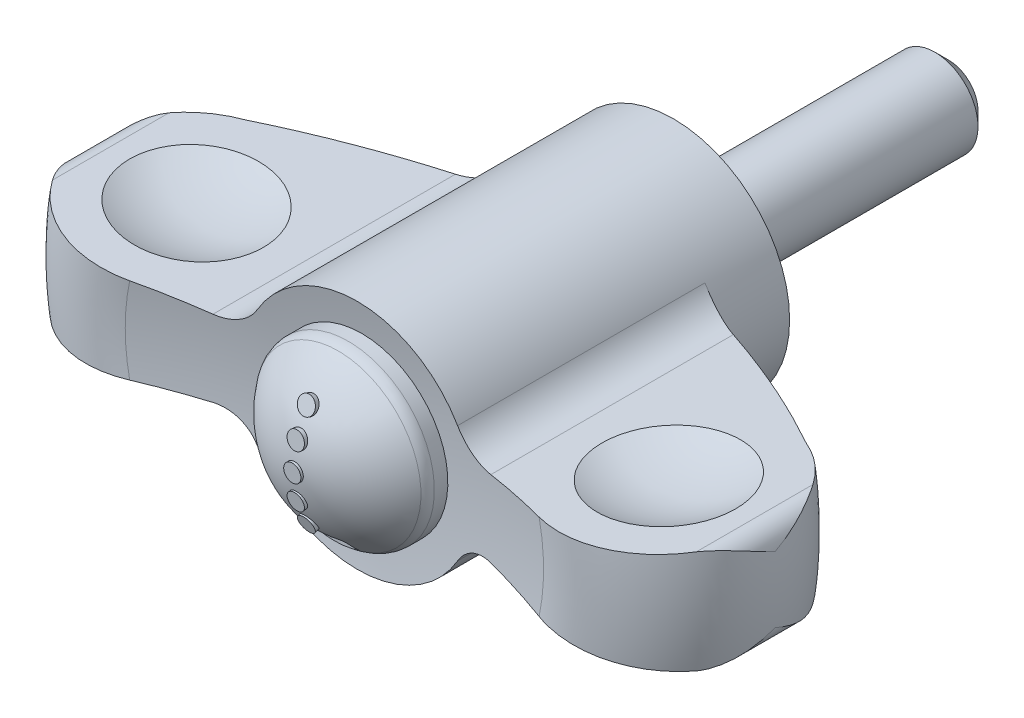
ISO-10303-21;
HEADER;
FILE_DESCRIPTION(('STEP AP214'),'2;1');
FILE_NAME('part.step','',(''),(''),'','','');
FILE_SCHEMA(('AUTOMOTIVE_DESIGN { 1 0 10303 214 1 1 1 1 }'));
ENDSEC;
DATA;
#1=APPLICATION_CONTEXT('core data for automotive mechanical design processes');
#2=APPLICATION_PROTOCOL_DEFINITION('international standard','automotive_design',2000,#1);
#3=PRODUCT_CONTEXT('',#1,'mechanical');
#4=PRODUCT('Part','Part','',(#3));
#5=PRODUCT_RELATED_PRODUCT_CATEGORY('part','',(#4));
#6=PRODUCT_DEFINITION_FORMATION('','',#4);
#7=PRODUCT_DEFINITION_CONTEXT('part definition',#1,'design');
#8=PRODUCT_DEFINITION('design','',#6,#7);
#9=PRODUCT_DEFINITION_SHAPE('','',#8);
#10=(LENGTH_UNIT() NAMED_UNIT(*) SI_UNIT(.MILLI.,.METRE.));
#11=(NAMED_UNIT(*) PLANE_ANGLE_UNIT() SI_UNIT($,.RADIAN.));
#12=(NAMED_UNIT(*) SI_UNIT($,.STERADIAN.) SOLID_ANGLE_UNIT());
#13=UNCERTAINTY_MEASURE_WITH_UNIT(LENGTH_MEASURE(1.E-05),#10,'distance_accuracy_value','');
#14=(GEOMETRIC_REPRESENTATION_CONTEXT(3) GLOBAL_UNCERTAINTY_ASSIGNED_CONTEXT((#13)) GLOBAL_UNIT_ASSIGNED_CONTEXT((#10,
#11,#12)) REPRESENTATION_CONTEXT('',''));
#15=CARTESIAN_POINT('',(0.,0.,0.));
#16=DIRECTION('',(0.,0.,1.));
#17=DIRECTION('',(1.,0.,0.));
#18=AXIS2_PLACEMENT_3D('',#15,#16,#17);
#19=CARTESIAN_POINT('',(0.,0.,14.56));
#20=DIRECTION('',(0.,0.,-1.));
#21=DIRECTION('',(-1.,0.,0.));
#22=AXIS2_PLACEMENT_3D('',#19,#20,#21);
#23=CYLINDRICAL_SURFACE('',#22,5.);
#24=CARTESIAN_POINT('',(0.,0.,18.9006117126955));
#25=DIRECTION('',(0.,0.,-1.));
#26=DIRECTION('',(-1.,0.,0.));
#27=AXIS2_PLACEMENT_3D('',#24,#25,#26);
#28=CIRCLE('',#27,5.);
#29=CARTESIAN_POINT('',(-5.,0.,18.9006117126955));
#30=VERTEX_POINT('',#29);
#31=EDGE_CURVE('E786',#30,#30,#28,.T.);
#32=ORIENTED_EDGE('',*,*,#31,.T.);
#33=EDGE_LOOP('',(#32));
#34=FACE_BOUND('',#33,.T.);
#35=CARTESIAN_POINT('',(0.,0.,18.116551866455));
#36=DIRECTION('',(0.,0.,1.));
#37=DIRECTION('',(0.,1.,0.));
#38=AXIS2_PLACEMENT_3D('',#35,#36,#37);
#39=CIRCLE('',#38,5.);
#40=CARTESIAN_POINT('',(0.,5.,18.116551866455));
#41=VERTEX_POINT('',#40);
#42=EDGE_CURVE('E197',#41,#41,#39,.T.);
#43=ORIENTED_EDGE('',*,*,#42,.T.);
#44=EDGE_LOOP('',(#43));
#45=FACE_BOUND('',#44,.T.);
#46=ADVANCED_FACE('F15',(#34,#45),#23,.T.);
#47=CARTESIAN_POINT('',(0.,0.,18.9006117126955));
#48=DIRECTION('',(0.,0.,-1.));
#49=DIRECTION('',(-1.,0.,0.));
#50=AXIS2_PLACEMENT_3D('',#47,#48,#49);
#51=TOROIDAL_SURFACE('',#50,4.,1.);
#52=CARTESIAN_POINT('',(0.,0.,19.4883661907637));
#53=DIRECTION('',(0.,0.,-1.));
#54=DIRECTION('',(-1.,0.,0.));
#55=AXIS2_PLACEMENT_3D('',#52,#53,#54);
#56=CIRCLE('',#55,4.80903935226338);
#57=CARTESIAN_POINT('',(-4.80903935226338,0.,19.4883661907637));
#58=VERTEX_POINT('',#57);
#59=EDGE_CURVE('E788',#58,#58,#56,.T.);
#60=ORIENTED_EDGE('',*,*,#59,.T.);
#61=EDGE_LOOP('',(#60));
#62=FACE_BOUND('',#61,.T.);
#63=ORIENTED_EDGE('',*,*,#31,.F.);
#64=EDGE_LOOP('',(#63));
#65=FACE_BOUND('',#64,.T.);
#66=ADVANCED_FACE('F599',(#62,#65),#51,.T.);
#67=CARTESIAN_POINT('',(0.,0.,15.8149007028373));
#68=DIRECTION('',(0.,0.,-1.));
#69=DIRECTION('',(-1.,0.,0.));
#70=AXIS2_PLACEMENT_3D('',#67,#68,#69);
#71=DEGENERATE_TOROIDAL_SURFACE('',#70,0.24745659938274,6.25,.F.);
#72=CARTESIAN_POINT('',(0.,0.,22.0200444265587));
#73=DIRECTION('',(0.,0.,-1.));
#74=DIRECTION('',(-1.,0.,0.));
#75=AXIS2_PLACEMENT_3D('',#72,#73,#74);
#76=CIRCLE('',#75,0.5);
#77=CARTESIAN_POINT('',(-0.5,0.,22.0200444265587));
#78=VERTEX_POINT('',#77);
#79=EDGE_CURVE('E650',#78,#78,#76,.T.);
#80=ORIENTED_EDGE('',*,*,#79,.T.);
#81=EDGE_LOOP('',(#80));
#82=FACE_BOUND('',#81,.T.);
#83=CARTESIAN_POINT('',(-0.340038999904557,1.16514130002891,21.8916899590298));
#84=CARTESIAN_POINT('',(-0.360796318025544,1.18378525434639,21.885987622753));
#85=CARTESIAN_POINT('',(-0.379909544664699,1.2041424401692,21.879791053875));
#86=CARTESIAN_POINT('',(-0.414301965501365,1.24767784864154,21.8666039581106));
#87=CARTESIAN_POINT('',(-0.429575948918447,1.2708598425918,21.8596123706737));
#88=CARTESIAN_POINT('',(-0.455841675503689,1.31934512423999,21.8450565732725));
#89=CARTESIAN_POINT('',(-0.466837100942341,1.34464656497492,21.8374928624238));
#90=CARTESIAN_POINT('',(-0.484264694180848,1.39666109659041,21.8220053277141));
#91=CARTESIAN_POINT('',(-0.490698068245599,1.42337381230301,21.8140815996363));
#92=CARTESIAN_POINT('',(-0.49885866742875,1.47762849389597,21.7980432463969));
#93=CARTESIAN_POINT('',(-0.50055790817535,1.50517442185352,21.7899277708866));
#94=CARTESIAN_POINT('',(-0.499121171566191,1.56016451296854,21.7737737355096));
#95=CARTESIAN_POINT('',(-0.495984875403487,1.58760866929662,21.7657351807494));
#96=CARTESIAN_POINT('',(-0.484947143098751,1.64166043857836,21.7499411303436));
#97=CARTESIAN_POINT('',(-0.47703744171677,1.66826651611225,21.7421861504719));
#98=CARTESIAN_POINT('',(-0.45665653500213,1.71982500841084,21.7271876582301));
#99=CARTESIAN_POINT('',(-0.444185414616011,1.74477745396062,21.7199441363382));
#100=CARTESIAN_POINT('',(-0.415089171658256,1.79218944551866,21.7062023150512));
#101=CARTESIAN_POINT('',(-0.398483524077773,1.81465998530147,21.6997007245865));
#102=CARTESIAN_POINT('',(-0.361547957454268,1.85657719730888,21.6875871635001));
#103=CARTESIAN_POINT('',(-0.341218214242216,1.87602401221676,21.681975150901));
#104=CARTESIAN_POINT('',(-0.297604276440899,1.91115189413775,21.6718470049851));
#105=CARTESIAN_POINT('',(-0.274348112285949,1.92686506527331,21.6673215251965));
#106=CARTESIAN_POINT('',(-0.225399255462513,1.9542751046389,21.6594321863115));
#107=CARTESIAN_POINT('',(-0.199706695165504,1.96597219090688,21.6560682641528));
#108=CARTESIAN_POINT('',(-0.146879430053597,1.98490191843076,21.650626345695));
#109=CARTESIAN_POINT('',(-0.119760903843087,1.99217626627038,21.6485363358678));
#110=CARTESIAN_POINT('',(-0.0646349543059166,2.00221475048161,21.6456525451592));
#111=CARTESIAN_POINT('',(-0.036627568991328,2.00497907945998,21.6448587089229));
#112=CARTESIAN_POINT('',(0.0192915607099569,2.00591063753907,21.6445911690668));
#113=CARTESIAN_POINT('',(0.0472027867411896,2.00410688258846,21.645109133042));
#114=CARTESIAN_POINT('',(0.102312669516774,1.99601803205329,21.6474326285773));
#115=CARTESIAN_POINT('',(0.129511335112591,1.98973299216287,21.6492381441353));
#116=CARTESIAN_POINT('',(0.182411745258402,1.97287505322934,21.6540835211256));
#117=CARTESIAN_POINT('',(0.208114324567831,1.96230457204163,21.657122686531));
#118=CARTESIAN_POINT('',(0.257321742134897,1.93718941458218,21.664349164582));
#119=CARTESIAN_POINT('',(0.280826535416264,1.92264465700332,21.6685365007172));
#120=CARTESIAN_POINT('',(0.325111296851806,1.88991768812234,21.6779679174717));
#121=CARTESIAN_POINT('',(0.345875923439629,1.87171632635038,21.6832175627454));
#122=CARTESIAN_POINT('',(0.383965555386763,1.83225353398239,21.694614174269));
#123=CARTESIAN_POINT('',(0.401290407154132,1.81099196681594,21.7007611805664));
#124=CARTESIAN_POINT('',(0.432179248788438,1.76580723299,21.7138455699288));
#125=CARTESIAN_POINT('',(0.445707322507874,1.74186146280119,21.7207896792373));
#126=CARTESIAN_POINT('',(0.468430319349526,1.69215088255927,21.7352335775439));
#127=CARTESIAN_POINT('',(0.477625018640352,1.66638597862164,21.7427333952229));
#128=CARTESIAN_POINT('',(0.491506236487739,1.61351277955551,21.7581599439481));
#129=CARTESIAN_POINT('',(0.496149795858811,1.58639417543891,21.7660900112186));
#130=CARTESIAN_POINT('',(0.500658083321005,1.53180514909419,21.7820972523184));
#131=CARTESIAN_POINT('',(0.500522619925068,1.50433471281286,21.7901744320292));
#132=CARTESIAN_POINT('',(0.495464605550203,1.44965403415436,21.8063039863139));
#133=CARTESIAN_POINT('',(0.490514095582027,1.42244624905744,21.814355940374));
#134=CARTESIAN_POINT('',(0.475919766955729,1.36922900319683,21.8301633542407));
#135=CARTESIAN_POINT('',(0.466275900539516,1.34321955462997,21.8379188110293));
#136=CARTESIAN_POINT('',(0.442558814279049,1.29314848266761,21.8529103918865));
#137=CARTESIAN_POINT('',(0.42848645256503,1.2690864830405,21.8601466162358));
#138=CARTESIAN_POINT('',(0.39629638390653,1.22360278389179,21.8738857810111));
#139=CARTESIAN_POINT('',(0.378178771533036,1.20218102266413,21.8803887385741));
#140=CARTESIAN_POINT('',(0.338535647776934,1.16274360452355,21.892415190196));
#141=CARTESIAN_POINT('',(0.317033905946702,1.14470598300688,21.8979449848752));
#142=CARTESIAN_POINT('',(0.271137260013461,1.11239704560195,21.9078923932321));
#143=CARTESIAN_POINT('',(0.246742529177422,1.09812550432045,21.9123100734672));
#144=CARTESIAN_POINT('',(0.19604730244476,1.07392122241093,21.9198289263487));
#145=CARTESIAN_POINT('',(0.16977154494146,1.06394113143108,21.9229444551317));
#146=CARTESIAN_POINT('',(0.115826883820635,1.04839125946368,21.9278094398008));
#147=CARTESIAN_POINT('',(0.0881581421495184,1.0428209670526,21.9295590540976));
#148=CARTESIAN_POINT('',(0.0325476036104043,1.03629851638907,21.9316086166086));
#149=CARTESIAN_POINT('',(0.00461243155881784,1.03529485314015,21.9319247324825));
#150=CARTESIAN_POINT('',(-0.0510422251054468,1.03779652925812,21.9311379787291));
#151=CARTESIAN_POINT('',(-0.0787616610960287,1.0413028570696,21.9300347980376));
#152=CARTESIAN_POINT('',(-0.13308296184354,1.05269636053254,21.9264617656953));
#153=CARTESIAN_POINT('',(-0.159688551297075,1.06056742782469,21.9239969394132));
#154=CARTESIAN_POINT('',(-0.211125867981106,1.08044004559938,21.9178013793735));
#155=CARTESIAN_POINT('',(-0.235959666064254,1.09243667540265,21.9140721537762));
#156=CARTESIAN_POINT('',(-0.273974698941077,1.11478011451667,21.9071622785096));
#157=CARTESIAN_POINT('',(-0.287927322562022,1.12394977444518,21.9043336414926));
#158=CARTESIAN_POINT('',(-0.314793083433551,1.14359180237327,21.8982914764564));
#159=CARTESIAN_POINT('',(-0.32770622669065,1.15406416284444,21.8950779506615));
#160=CARTESIAN_POINT('',(-0.340038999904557,1.16514130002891,21.8916899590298));
#161=B_SPLINE_CURVE_WITH_KNOTS('',3,(#83,#84,#85,#86,#87,#88,#89,#90,#91,#92,#93,#94,#95,#96,
#97,#98,#99,#100,#101,#102,#103,#104,#105,#106,#107,#108,#109,#110,#111,#112,#113,#114,#115,
#116,#117,#118,#119,#120,#121,#122,#123,#124,#125,#126,#127,#128,#129,#130,#131,#132,#133,#134,
#135,#136,#137,#138,#139,#140,#141,#142,#143,#144,#145,#146,#147,#148,#149,#150,#151,#152,#153,
#154,#155,#156,#157,#158,#159,#160),.UNSPECIFIED.,.T.,.F.,(4,2,2,2,2,2,2,2,2,2,2,2,2,2,2,2,2,2,
2,2,2,2,2,2,2,2,2,2,2,2,2,2,2,2,2,2,2,2,4),(0.,0.0853707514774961,0.170856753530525,
0.25626901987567,0.341658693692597,0.427552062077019,0.513451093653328,0.599499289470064,
0.685545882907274,0.771194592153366,0.856839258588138,0.941718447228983,1.02659302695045,
1.11065429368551,1.19471197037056,1.2782370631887,1.36176111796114,1.44523811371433,
1.52871681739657,1.61264468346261,1.69657629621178,1.78127699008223,1.86598205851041,
1.95147918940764,2.03697974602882,2.1229797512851,2.2089806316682,2.29496485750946,
2.38094707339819,2.46635030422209,2.55174842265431,2.6361784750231,2.7205987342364,
2.80406445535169,2.88754847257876,2.97072641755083,3.05380549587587,3.10452805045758,
3.15525031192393),.UNSPECIFIED.);
#162=CARTESIAN_POINT('',(-0.340038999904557,1.16514130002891,21.8916899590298));
#163=VERTEX_POINT('',#162);
#164=EDGE_CURVE('E644',#163,#163,#161,.T.);
#165=ORIENTED_EDGE('',*,*,#164,.T.);
#166=EDGE_LOOP('',(#165));
#167=FACE_BOUND('',#166,.T.);
#168=CARTESIAN_POINT('',(-0.497646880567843,2.89464344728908,21.1927290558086));
#169=CARTESIAN_POINT('',(-0.500408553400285,2.91946824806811,21.1779640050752));
#170=CARTESIAN_POINT('',(-0.500739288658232,2.94451618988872,21.163077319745));
#171=CARTESIAN_POINT('',(-0.496515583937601,2.99433639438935,21.1334873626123));
#172=CARTESIAN_POINT('',(-0.491955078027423,3.0191082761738,21.1187843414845));
#173=CARTESIAN_POINT('',(-0.478057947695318,3.06764588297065,21.0899916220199));
#174=CARTESIAN_POINT('',(-0.468722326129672,3.09141181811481,21.0759017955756));
#175=CARTESIAN_POINT('',(-0.445518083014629,3.13724443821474,21.0487420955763));
#176=CARTESIAN_POINT('',(-0.43165075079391,3.1593116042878,21.0356719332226));
#177=CARTESIAN_POINT('',(-0.399852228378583,3.2009658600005,21.0110096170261));
#178=CARTESIAN_POINT('',(-0.381947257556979,3.22056773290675,20.9994086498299));
#179=CARTESIAN_POINT('',(-0.342511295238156,3.25685836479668,20.9779368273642));
#180=CARTESIAN_POINT('',(-0.320980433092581,3.27354722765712,20.9680659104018));
#181=CARTESIAN_POINT('',(-0.275262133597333,3.30325387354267,20.9504989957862));
#182=CARTESIAN_POINT('',(-0.251121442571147,3.31632492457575,20.9427714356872));
#183=CARTESIAN_POINT('',(-0.200601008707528,3.33872614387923,20.9295296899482));
#184=CARTESIAN_POINT('',(-0.17422149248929,3.34805669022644,20.9240152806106));
#185=CARTESIAN_POINT('',(-0.120434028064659,3.3625583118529,20.9154453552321));
#186=CARTESIAN_POINT('',(-0.0930497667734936,3.36779453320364,20.9123513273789));
#187=CARTESIAN_POINT('',(-0.0376468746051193,3.37419090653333,20.9085718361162));
#188=CARTESIAN_POINT('',(-0.00962828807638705,3.37535134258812,20.9078862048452));
#189=CARTESIAN_POINT('',(0.0459558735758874,3.37356848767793,20.908939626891));
#190=CARTESIAN_POINT('',(0.0735231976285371,3.37066528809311,20.9106549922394));
#191=CARTESIAN_POINT('',(0.127700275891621,3.3609180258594,20.916414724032));
#192=CARTESIAN_POINT('',(0.154310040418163,3.35407400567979,20.9204590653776));
#193=CARTESIAN_POINT('',(0.205846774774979,3.3366501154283,20.9307568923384));
#194=CARTESIAN_POINT('',(0.230772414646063,3.32606733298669,20.9370121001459));
#195=CARTESIAN_POINT('',(0.278235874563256,3.30148793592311,20.951543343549));
#196=CARTESIAN_POINT('',(0.300773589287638,3.28749117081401,20.959819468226));
#197=CARTESIAN_POINT('',(0.343090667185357,3.25632753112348,20.9782511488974));
#198=CARTESIAN_POINT('',(0.362837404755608,3.23912786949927,20.9884261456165));
#199=CARTESIAN_POINT('',(0.398761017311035,3.2021630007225,21.0103013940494));
#200=CARTESIAN_POINT('',(0.414937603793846,3.1823975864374,21.0220017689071));
#201=CARTESIAN_POINT('',(0.443543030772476,3.14051907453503,21.0468026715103));
#202=CARTESIAN_POINT('',(0.455906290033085,3.11837288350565,21.0599229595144));
#203=CARTESIAN_POINT('',(0.476209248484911,3.0726334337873,21.0870346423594));
#204=CARTESIAN_POINT('',(0.484148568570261,3.04904005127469,21.1010261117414));
#205=CARTESIAN_POINT('',(0.495492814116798,3.00069621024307,21.1297122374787));
#206=CARTESIAN_POINT('',(0.498827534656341,2.97593366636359,21.1444143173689));
#207=CARTESIAN_POINT('',(0.500654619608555,2.92628512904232,21.1739119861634));
#208=CARTESIAN_POINT('',(0.499146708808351,2.90139912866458,21.1887075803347));
#209=CARTESIAN_POINT('',(0.491297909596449,2.85201549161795,21.2180901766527));
#210=CARTESIAN_POINT('',(0.48492094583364,2.8275221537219,21.2326747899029));
#211=CARTESIAN_POINT('',(0.467455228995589,2.77981788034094,21.2611037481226));
#212=CARTESIAN_POINT('',(0.456366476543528,2.7566069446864,21.2749480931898));
#213=CARTESIAN_POINT('',(0.429815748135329,2.71222388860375,21.3014431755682));
#214=CARTESIAN_POINT('',(0.41436966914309,2.69104472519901,21.3140980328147));
#215=CARTESIAN_POINT('',(0.379501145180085,2.65126141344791,21.3378888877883));
#216=CARTESIAN_POINT('',(0.360078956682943,2.63265709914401,21.3490249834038));
#217=CARTESIAN_POINT('',(0.318084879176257,2.59882690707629,21.3692903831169));
#218=CARTESIAN_POINT('',(0.295559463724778,2.58355848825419,21.3784449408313));
#219=CARTESIAN_POINT('',(0.247794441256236,2.55655637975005,21.3946449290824));
#220=CARTESIAN_POINT('',(0.222555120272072,2.54482231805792,21.4016905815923));
#221=CARTESIAN_POINT('',(0.170563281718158,2.52543836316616,21.4133348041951));
#222=CARTESIAN_POINT('',(0.143845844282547,2.51771926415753,21.4179748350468));
#223=CARTESIAN_POINT('',(0.0892673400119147,2.50629638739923,21.4248427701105));
#224=CARTESIAN_POINT('',(0.0614063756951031,2.50259225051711,21.4270708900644));
#225=CARTESIAN_POINT('',(0.00574373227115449,2.49934037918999,21.4290269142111));
#226=CARTESIAN_POINT('',(-0.0220534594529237,2.49973599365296,21.428788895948));
#227=CARTESIAN_POINT('',(-0.0771718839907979,2.50453462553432,21.4259026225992));
#228=CARTESIAN_POINT('',(-0.10449313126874,2.50893752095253,21.42325444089));
#229=CARTESIAN_POINT('',(-0.157803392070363,2.52159360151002,21.4156460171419));
#230=CARTESIAN_POINT('',(-0.183796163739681,2.52983517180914,21.4106927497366));
#231=CARTESIAN_POINT('',(-0.233818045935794,2.54991225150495,21.3986343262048));
#232=CARTESIAN_POINT('',(-0.257847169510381,2.56174773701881,21.3915291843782));
#233=CARTESIAN_POINT('',(-0.303500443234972,2.58878192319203,21.3753128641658));
#234=CARTESIAN_POINT('',(-0.325101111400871,2.60400981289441,21.3661842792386));
#235=CARTESIAN_POINT('',(-0.365081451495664,2.63732566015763,21.3462302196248));
#236=CARTESIAN_POINT('',(-0.38346007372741,2.65541454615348,21.3354041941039));
#237=CARTESIAN_POINT('',(-0.416802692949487,2.69426501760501,21.3121735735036));
#238=CARTESIAN_POINT('',(-0.43170289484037,2.71506703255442,21.2997451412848));
#239=CARTESIAN_POINT('',(-0.457285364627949,2.75849069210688,21.2738244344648));
#240=CARTESIAN_POINT('',(-0.46797218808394,2.78111033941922,21.2603333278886));
#241=CARTESIAN_POINT('',(-0.48177274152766,2.81900189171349,21.2377524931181));
#242=CARTESIAN_POINT('',(-0.486226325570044,2.83392130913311,21.228866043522));
#243=CARTESIAN_POINT('',(-0.493311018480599,2.86407995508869,21.2109115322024));
#244=CARTESIAN_POINT('',(-0.495942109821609,2.8793191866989,21.2018434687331));
#245=CARTESIAN_POINT('',(-0.497646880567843,2.89464344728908,21.1927290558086));
#246=B_SPLINE_CURVE_WITH_KNOTS('',3,(#168,#169,#170,#171,#172,#173,#174,#175,#176,#177,#178,
#179,#180,#181,#182,#183,#184,#185,#186,#187,#188,#189,#190,#191,#192,#193,#194,#195,#196,#197,
#198,#199,#200,#201,#202,#203,#204,#205,#206,#207,#208,#209,#210,#211,#212,#213,#214,#215,#216,
#217,#218,#219,#220,#221,#222,#223,#224,#225,#226,#227,#228,#229,#230,#231,#232,#233,#234,#235,
#236,#237,#238,#239,#240,#241,#242,#243,#244,#245),.UNSPECIFIED.,.T.,.F.,(4,2,2,2,2,2,2,2,2,2,2,
2,2,2,2,2,2,2,2,2,2,2,2,2,2,2,2,2,2,2,2,2,2,2,2,2,2,2,4),(0.,0.0869817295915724,
0.174071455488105,0.261142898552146,0.348189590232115,0.434686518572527,0.52118036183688,
0.606323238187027,0.691457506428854,0.775207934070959,0.858952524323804,0.941876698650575,
1.02479997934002,1.10778799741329,1.1907796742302,1.27467294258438,1.35857298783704,
1.4438444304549,1.52912317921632,1.61568830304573,1.70225834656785,1.7894760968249,
1.87669383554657,1.96359740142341,2.05049536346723,2.13621044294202,2.22191649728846,
2.30609171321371,2.39025939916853,2.47326560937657,2.55626929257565,2.6390234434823,
2.72177704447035,2.80527224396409,2.8887945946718,2.9737458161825,3.05860493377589,
3.11229792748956,3.16599143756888),.UNSPECIFIED.);
#247=CARTESIAN_POINT('',(-0.497646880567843,2.89464344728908,21.1927290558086));
#248=VERTEX_POINT('',#247);
#249=EDGE_CURVE('E578',#248,#248,#246,.T.);
#250=ORIENTED_EDGE('',*,*,#249,.T.);
#251=EDGE_LOOP('',(#250));
#252=FACE_BOUND('',#251,.T.);
#253=CARTESIAN_POINT('',(1.1998,-3.50000006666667,20.6605789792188));
#254=CARTESIAN_POINT('',(1.21612550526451,-3.49998062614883,20.6562820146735));
#255=CARTESIAN_POINT('',(1.23209426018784,-3.50130836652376,20.6509470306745));
#256=CARTESIAN_POINT('',(1.26285478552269,-3.50625198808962,20.6386475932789));
#257=CARTESIAN_POINT('',(1.27765612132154,-3.50984647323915,20.6316987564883));
#258=CARTESIAN_POINT('',(1.30585464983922,-3.5189059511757,20.616566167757));
#259=CARTESIAN_POINT('',(1.31925923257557,-3.5243603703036,20.6083895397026));
#260=CARTESIAN_POINT('',(1.34468676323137,-3.53681450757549,20.5910549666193));
#261=CARTESIAN_POINT('',(1.35670558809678,-3.54381866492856,20.5818942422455));
#262=CARTESIAN_POINT('',(1.38518861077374,-3.56306948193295,20.5578662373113));
#263=CARTESIAN_POINT('',(1.40069252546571,-3.57614271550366,20.5425190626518));
#264=CARTESIAN_POINT('',(1.4283261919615,-3.60440175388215,20.5107779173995));
#265=CARTESIAN_POINT('',(1.44045106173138,-3.61959056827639,20.4943824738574));
#266=CARTESIAN_POINT('',(1.46156438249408,-3.6518053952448,20.460691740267));
#267=CARTESIAN_POINT('',(1.47049098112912,-3.66886008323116,20.443385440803));
#268=CARTESIAN_POINT('',(1.48489736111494,-3.70410734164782,20.4085452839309));
#269=CARTESIAN_POINT('',(1.49038149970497,-3.72229844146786,20.3910117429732));
#270=CARTESIAN_POINT('',(1.49606821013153,-3.75058573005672,20.3643946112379));
#271=CARTESIAN_POINT('',(1.49754229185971,-3.76040360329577,20.3552703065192));
#272=CARTESIAN_POINT('',(1.49950991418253,-3.78019383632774,20.337108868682));
#273=CARTESIAN_POINT('',(1.5000046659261,-3.79016598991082,20.3280716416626));
#274=CARTESIAN_POINT('',(1.4999999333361,-3.80019999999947,20.3190948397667));
#275=B_SPLINE_CURVE_WITH_KNOTS('',3,(#253,#254,#255,#256,#257,#258,#259,#260,#261,#262,#263,
#264,#265,#266,#267,#268,#269,#270,#271,#272,#273,#274),.UNSPECIFIED.,.F.,.F.,(4,2,2,2,2,2,2,2,
2,2,4),(0.,0.0504386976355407,0.10040828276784,0.15009840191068,0.19993274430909,
0.27581643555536,0.351809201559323,0.429201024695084,0.506494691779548,0.546914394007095,
0.587284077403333),.UNSPECIFIED.);
#276=CARTESIAN_POINT('',(1.2,-3.5,20.6605261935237));
#277=VERTEX_POINT('',#276);
#278=CARTESIAN_POINT('',(1.5,-3.8,20.3192737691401));
#279=VERTEX_POINT('',#278);
#280=EDGE_CURVE('E629',#277,#279,#275,.T.);
#281=ORIENTED_EDGE('',*,*,#280,.T.);
#282=CARTESIAN_POINT('',(1.5,-3.77186911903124,20.3442851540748));
#283=CARTESIAN_POINT('',(1.5,-3.89875657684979,20.2321778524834));
#284=CARTESIAN_POINT('',(1.5,-4.02090058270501,20.1147176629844));
#285=CARTESIAN_POINT('',(1.5,-4.25490832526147,19.8698919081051));
#286=CARTESIAN_POINT('',(1.5,-4.3667688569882,19.7425232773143));
#287=CARTESIAN_POINT('',(1.5,-4.57950203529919,19.4786823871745));
#288=CARTESIAN_POINT('',(1.5,-4.68036209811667,19.3421999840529));
#289=CARTESIAN_POINT('',(1.5,-4.87027979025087,19.0611834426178));
#290=CARTESIAN_POINT('',(1.5,-4.95933306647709,18.9166463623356));
#291=CARTESIAN_POINT('',(1.5,-5.12495781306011,18.6206168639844));
#292=CARTESIAN_POINT('',(1.5,-5.20153105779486,18.469125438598));
#293=CARTESIAN_POINT('',(1.5,-5.34170076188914,18.1601863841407));
#294=CARTESIAN_POINT('',(1.5,-5.40529243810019,18.0027365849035));
#295=CARTESIAN_POINT('',(1.5,-5.51897808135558,17.6831611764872));
#296=CARTESIAN_POINT('',(1.5,-5.5690814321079,17.5210389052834));
#297=CARTESIAN_POINT('',(1.5,-5.65551405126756,17.1930993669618));
#298=CARTESIAN_POINT('',(1.5,-5.69183822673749,17.0272807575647));
#299=CARTESIAN_POINT('',(1.5,-5.75050071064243,16.6927851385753));
#300=CARTESIAN_POINT('',(1.5,-5.77280589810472,16.5241023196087));
#301=CARTESIAN_POINT('',(1.5,-5.80314361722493,16.1853951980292));
#302=CARTESIAN_POINT('',(1.5,-5.81117086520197,16.0153704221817));
#303=CARTESIAN_POINT('',(1.5,-5.81287966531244,15.6753003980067));
#304=CARTESIAN_POINT('',(1.5,-5.80656556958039,15.5052551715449));
#305=CARTESIAN_POINT('',(1.5,-5.77964033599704,15.1662373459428));
#306=CARTESIAN_POINT('',(1.5,-5.75902392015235,14.9972651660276));
#307=CARTESIAN_POINT('',(1.5,-5.70362880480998,14.661630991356));
#308=CARTESIAN_POINT('',(1.5,-5.66884793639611,14.494969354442));
#309=CARTESIAN_POINT('',(1.5,-5.58535629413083,14.1651100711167));
#310=CARTESIAN_POINT('',(1.5,-5.53664037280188,14.0019137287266));
#311=CARTESIAN_POINT('',(1.5,-5.42563609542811,13.6802531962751));
#312=CARTESIAN_POINT('',(1.5,-5.36335234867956,13.5217874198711));
#313=CARTESIAN_POINT('',(1.5,-5.2256544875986,13.210648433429));
#314=CARTESIAN_POINT('',(1.5,-5.15023555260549,13.0579773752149));
#315=CARTESIAN_POINT('',(1.5,-4.90512682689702,12.6105522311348));
#316=CARTESIAN_POINT('',(1.5,-4.71642266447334,12.3259167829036));
#317=CARTESIAN_POINT('',(1.5,-4.29392526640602,11.7926493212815));
#318=CARTESIAN_POINT('',(1.5,-4.06013964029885,11.5440112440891));
#319=CARTESIAN_POINT('',(1.5,-3.5546161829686,11.09026827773));
#320=CARTESIAN_POINT('',(1.5,-3.28297326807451,10.8850576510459));
#321=CARTESIAN_POINT('',(1.5,-2.70841556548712,10.5233942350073));
#322=CARTESIAN_POINT('',(1.5,-2.40547667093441,10.3669794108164));
#323=CARTESIAN_POINT('',(1.5,-1.93598902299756,10.1739467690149));
#324=CARTESIAN_POINT('',(1.5,-1.77765079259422,10.1166830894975));
#325=CARTESIAN_POINT('',(1.5,-1.45650662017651,10.0162125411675));
#326=CARTESIAN_POINT('',(1.5,-1.29370041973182,9.97300648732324));
#327=CARTESIAN_POINT('',(1.5,-0.965128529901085,9.90155550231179));
#328=CARTESIAN_POINT('',(1.5,-0.799368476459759,9.87328469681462));
#329=CARTESIAN_POINT('',(1.5,-0.465930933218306,9.83253718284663));
#330=CARTESIAN_POINT('',(1.5,-0.298253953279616,9.82005636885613));
#331=CARTESIAN_POINT('',(1.5,0.0253649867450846,9.81186912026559));
#332=CARTESIAN_POINT('',(1.5,0.18127852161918,9.81501469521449));
#333=CARTESIAN_POINT('',(1.5,0.492193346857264,9.83529957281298));
#334=CARTESIAN_POINT('',(1.5,0.647194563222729,9.85243999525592));
#335=CARTESIAN_POINT('',(1.5,0.95528277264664,9.90004845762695));
#336=CARTESIAN_POINT('',(1.5,1.1083677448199,9.93052951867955));
#337=CARTESIAN_POINT('',(1.5,1.41143864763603,10.0040736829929));
#338=CARTESIAN_POINT('',(1.5,1.56142453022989,10.0471369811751));
#339=CARTESIAN_POINT('',(1.5,1.99735271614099,10.1916378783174));
#340=CARTESIAN_POINT('',(1.5,2.27793507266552,10.3097985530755));
#341=CARTESIAN_POINT('',(1.5,2.81752353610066,10.5874119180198));
#342=CARTESIAN_POINT('',(1.5,3.07653567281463,10.7468530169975));
#343=CARTESIAN_POINT('',(1.5,3.59110850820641,11.1201960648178));
#344=CARTESIAN_POINT('',(1.5,3.84395994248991,11.3378527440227));
#345=CARTESIAN_POINT('',(1.5,4.31037854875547,11.8118817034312));
#346=CARTESIAN_POINT('',(1.5,4.52393370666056,12.0682657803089));
#347=CARTESIAN_POINT('',(1.5,4.90946052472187,12.6176216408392));
#348=CARTESIAN_POINT('',(1.5,5.0806077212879,12.9111726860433));
#349=CARTESIAN_POINT('',(1.5,5.37140416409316,13.5227548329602));
#350=CARTESIAN_POINT('',(1.5,5.49105230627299,13.8407864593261));
#351=CARTESIAN_POINT('',(1.5,5.67587928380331,14.4936469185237));
#352=CARTESIAN_POINT('',(1.5,5.74084423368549,14.8285363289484));
#353=CARTESIAN_POINT('',(1.5,5.81368594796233,15.504459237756));
#354=CARTESIAN_POINT('',(1.5,5.82156360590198,15.8454926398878));
#355=CARTESIAN_POINT('',(1.5,5.77999330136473,16.5243697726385));
#356=CARTESIAN_POINT('',(1.5,5.73049170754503,16.8622102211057));
#357=CARTESIAN_POINT('',(1.5,5.57546266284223,17.5248097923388));
#358=CARTESIAN_POINT('',(1.5,5.46993096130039,17.8495679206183));
#359=CARTESIAN_POINT('',(1.5,5.20581581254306,18.4767273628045));
#360=CARTESIAN_POINT('',(1.5,5.04723499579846,18.7791297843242));
#361=CARTESIAN_POINT('',(1.5,4.68153004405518,19.3528988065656));
#362=CARTESIAN_POINT('',(1.5,4.47441760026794,19.6242728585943));
#363=CARTESIAN_POINT('',(1.5,4.01781623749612,20.1278496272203));
#364=CARTESIAN_POINT('',(1.5,3.76839934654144,20.3601176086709));
#365=CARTESIAN_POINT('',(1.5,3.23377900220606,20.7793780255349));
#366=CARTESIAN_POINT('',(1.5,2.94854886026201,20.9663363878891));
#367=CARTESIAN_POINT('',(1.5,2.35178931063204,21.2881057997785));
#368=CARTESIAN_POINT('',(1.5,2.04041191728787,21.423195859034));
#369=CARTESIAN_POINT('',(1.5,1.55980994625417,21.5835304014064));
#370=CARTESIAN_POINT('',(1.5,1.39737998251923,21.6299211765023));
#371=CARTESIAN_POINT('',(1.5,1.06895790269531,21.707915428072));
#372=CARTESIAN_POINT('',(1.5,0.902966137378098,21.7395203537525));
#373=CARTESIAN_POINT('',(1.5,0.575534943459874,21.78602119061));
#374=CARTESIAN_POINT('',(1.5,0.414184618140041,21.8015438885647));
#375=CARTESIAN_POINT('',(1.5,0.0907420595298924,21.8173719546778));
#376=CARTESIAN_POINT('',(1.5,-0.0713500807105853,21.8176791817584));
#377=CARTESIAN_POINT('',(1.5,-0.394858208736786,21.8030600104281));
#378=CARTESIAN_POINT('',(1.5,-0.556274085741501,21.7881312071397));
#379=CARTESIAN_POINT('',(1.5,-0.877155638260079,21.7437415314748));
#380=CARTESIAN_POINT('',(1.5,-1.0366203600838,21.7142738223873));
#381=CARTESIAN_POINT('',(1.5,-1.33905968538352,21.644705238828));
#382=CARTESIAN_POINT('',(1.5,-1.48229107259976,21.6057103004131));
#383=CARTESIAN_POINT('',(1.5,-1.76529127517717,21.5167876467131));
#384=CARTESIAN_POINT('',(1.5,-1.9050606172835,21.4668616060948));
#385=CARTESIAN_POINT('',(1.5,-2.18030458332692,21.3565927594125));
#386=CARTESIAN_POINT('',(1.5,-2.3157823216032,21.2962577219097));
#387=CARTESIAN_POINT('',(1.5,-2.5818012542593,21.165616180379));
#388=CARTESIAN_POINT('',(1.5,-2.7123432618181,21.0953113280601));
#389=CARTESIAN_POINT('',(1.5,-3.00575200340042,20.922887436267));
#390=CARTESIAN_POINT('',(1.5,-3.16672088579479,20.8175174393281));
#391=CARTESIAN_POINT('',(1.5,-3.47778526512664,20.5918238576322));
#392=CARTESIAN_POINT('',(1.5,-3.62788126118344,20.4715009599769));
#393=CARTESIAN_POINT('',(1.5,-3.77186911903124,20.3442851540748));
#394=B_SPLINE_CURVE_WITH_KNOTS('',3,(#282,#283,#284,#285,#286,#287,#288,#289,#290,#291,#292,
#293,#294,#295,#296,#297,#298,#299,#300,#301,#302,#303,#304,#305,#306,#307,#308,#309,#310,#311,
#312,#313,#314,#315,#316,#317,#318,#319,#320,#321,#322,#323,#324,#325,#326,#327,#328,#329,#330,
#331,#332,#333,#334,#335,#336,#337,#338,#339,#340,#341,#342,#343,#344,#345,#346,#347,#348,#349,
#350,#351,#352,#353,#354,#355,#356,#357,#358,#359,#360,#361,#362,#363,#364,#365,#366,#367,#368,
#369,#370,#371,#372,#373,#374,#375,#376,#377,#378,#379,#380,#381,#382,#383,#384,#385,#386,#387,
#388,#389,#390,#391,#392,#393),.UNSPECIFIED.,.T.,.F.,(4,2,2,2,2,2,2,2,2,2,2,2,2,2,2,2,2,2,2,2,2,
2,2,2,2,2,2,2,2,2,2,2,2,2,2,2,2,2,2,2,2,2,2,2,2,2,2,2,2,2,2,2,2,2,2,4),(0.,0.507784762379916,
1.01572724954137,1.52424482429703,2.03294936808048,2.5415815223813,3.05040074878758,
3.55886507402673,4.06751715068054,4.57736648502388,5.08740445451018,5.59728766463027,
6.10735913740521,6.61750874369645,7.12784703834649,7.6380122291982,8.14836504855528,
9.16759938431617,10.186661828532,11.2032137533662,12.2205546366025,12.7251567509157,
13.2297881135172,13.7335423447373,14.2371655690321,14.7043619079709,15.1715956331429,
15.6392864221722,16.1069844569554,17.0163323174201,17.9254251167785,18.9216346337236,
19.9181482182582,20.932735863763,21.9473452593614,22.9659049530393,23.984448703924,
25.0039452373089,26.0235191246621,27.0430424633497,28.062320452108,29.0798801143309,
30.0982026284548,31.1109679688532,31.6171910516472,32.1233645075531,32.6089695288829,
33.0945152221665,33.5801375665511,34.0659884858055,34.5108775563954,34.9556985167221,
35.4001889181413,35.8446057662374,36.4208502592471,36.9970682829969),.UNSPECIFIED.);
#395=CARTESIAN_POINT('',(1.5,-4.39122918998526,19.71));
#396=VERTEX_POINT('',#395);
#397=EDGE_CURVE('E637',#279,#396,#394,.T.);
#398=ORIENTED_EDGE('',*,*,#397,.T.);
#399=CARTESIAN_POINT('',(0.,0.,19.71));
#400=DIRECTION('',(0.,0.,1.));
#401=DIRECTION('',(1.,0.,0.));
#402=AXIS2_PLACEMENT_3D('',#399,#400,#401);
#403=CIRCLE('',#402,4.64035492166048);
#404=CARTESIAN_POINT('',(-1.5,-4.39122918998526,19.71));
#405=VERTEX_POINT('',#404);
#406=EDGE_CURVE('E790',#396,#405,#403,.F.);
#407=ORIENTED_EDGE('',*,*,#406,.T.);
#408=CARTESIAN_POINT('',(-1.5,-3.77186911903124,20.3442851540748));
#409=CARTESIAN_POINT('',(-1.5,-3.51968024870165,20.567082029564));
#410=CARTESIAN_POINT('',(-1.5,-3.24858986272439,20.7688458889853));
#411=CARTESIAN_POINT('',(-1.5,-2.67566749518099,21.1242517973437));
#412=CARTESIAN_POINT('',(-1.5,-2.37377647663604,21.2777990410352));
#413=CARTESIAN_POINT('',(-1.5,-1.90529373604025,21.4673543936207));
#414=CARTESIAN_POINT('',(-1.5,-1.74668297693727,21.5237110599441));
#415=CARTESIAN_POINT('',(-1.5,-1.42506893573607,21.6223262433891));
#416=CARTESIAN_POINT('',(-1.5,-1.26206533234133,21.664583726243));
#417=CARTESIAN_POINT('',(-1.5,-0.933215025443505,21.7340833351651));
#418=CARTESIAN_POINT('',(-1.5,-0.767374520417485,21.7613547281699));
#419=CARTESIAN_POINT('',(-1.5,-0.4338693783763,21.8000597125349));
#420=CARTESIAN_POINT('',(-1.5,-0.266205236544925,21.8114975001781));
#421=CARTESIAN_POINT('',(-1.5,0.0570192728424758,21.8176702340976));
#422=CARTESIAN_POINT('',(-1.5,0.212558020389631,21.8135775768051));
#423=CARTESIAN_POINT('',(-1.5,0.52264721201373,21.7914976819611));
#424=CARTESIAN_POINT('',(-1.5,0.677197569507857,21.7735092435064));
#425=CARTESIAN_POINT('',(-1.5,0.98433485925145,21.7243111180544));
#426=CARTESIAN_POINT('',(-1.5,1.13691959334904,21.6930877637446));
#427=CARTESIAN_POINT('',(-1.5,1.43894512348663,21.6181556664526));
#428=CARTESIAN_POINT('',(-1.5,1.58838588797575,21.5744467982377));
#429=CARTESIAN_POINT('',(-1.5,2.02382040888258,21.4277789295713));
#430=CARTESIAN_POINT('',(-1.5,2.30434575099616,21.3080318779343));
#431=CARTESIAN_POINT('',(-1.5,2.8435399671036,21.027221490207));
#432=CARTESIAN_POINT('',(-1.5,3.10221535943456,20.8661705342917));
#433=CARTESIAN_POINT('',(-1.5,3.61544960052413,20.489708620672));
#434=CARTESIAN_POINT('',(-1.5,3.86731041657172,20.2705993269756));
#435=CARTESIAN_POINT('',(-1.5,4.3315023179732,19.7938279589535));
#436=CARTESIAN_POINT('',(-1.5,4.5438210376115,19.5361538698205));
#437=CARTESIAN_POINT('',(-1.5,4.92653366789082,18.9845384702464));
#438=CARTESIAN_POINT('',(-1.5,5.09612198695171,18.6900376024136));
#439=CARTESIAN_POINT('',(-1.5,5.38365828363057,18.0768292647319));
#440=CARTESIAN_POINT('',(-1.5,5.50160540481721,17.7581213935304));
#441=CARTESIAN_POINT('',(-1.5,5.68292100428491,17.1042270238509));
#442=CARTESIAN_POINT('',(-1.5,5.74607992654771,16.7689823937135));
#443=CARTESIAN_POINT('',(-1.5,5.8152742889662,16.0926566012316));
#444=CARTESIAN_POINT('',(-1.5,5.82131057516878,15.751575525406));
#445=CARTESIAN_POINT('',(-1.5,5.77607262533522,15.0729212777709));
#446=CARTESIAN_POINT('',(-1.5,5.72474618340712,14.7353515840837));
#447=CARTESIAN_POINT('',(-1.5,5.56613774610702,14.073595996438));
#448=CARTESIAN_POINT('',(-1.5,5.4588514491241,13.7494111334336));
#449=CARTESIAN_POINT('',(-1.5,5.19134881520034,13.1236897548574));
#450=CARTESIAN_POINT('',(-1.5,5.03113581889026,12.8221518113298));
#451=CARTESIAN_POINT('',(-1.5,4.66233473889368,12.2503761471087));
#452=CARTESIAN_POINT('',(-1.5,4.45375853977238,11.9801307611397));
#453=CARTESIAN_POINT('',(-1.5,3.99444862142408,11.4790519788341));
#454=CARTESIAN_POINT('',(-1.5,3.74378817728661,11.2481514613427));
#455=CARTESIAN_POINT('',(-1.5,3.20691975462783,10.8318202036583));
#456=CARTESIAN_POINT('',(-1.5,2.92068470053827,10.6464244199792));
#457=CARTESIAN_POINT('',(-1.5,2.32223129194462,10.327964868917));
#458=CARTESIAN_POINT('',(-1.5,2.01016738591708,10.1946139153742));
#459=CARTESIAN_POINT('',(-1.5,1.52875942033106,10.0370079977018));
#460=CARTESIAN_POINT('',(-1.5,1.36609910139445,9.9915467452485));
#461=CARTESIAN_POINT('',(-1.5,1.03729605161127,9.91546217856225));
#462=CARTESIAN_POINT('',(-1.5,0.871153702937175,9.88483724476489));
#463=CARTESIAN_POINT('',(-1.5,0.543739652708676,9.84034208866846));
#464=CARTESIAN_POINT('',(-1.5,0.382556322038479,9.82582240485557));
#465=CARTESIAN_POINT('',(-1.5,0.0595439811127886,9.81197924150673));
#466=CARTESIAN_POINT('',(-1.5,-0.1022849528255,9.81265401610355));
#467=CARTESIAN_POINT('',(-1.5,-0.425187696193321,9.82916156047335));
#468=CARTESIAN_POINT('',(-1.5,-0.586261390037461,9.84499657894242));
#469=CARTESIAN_POINT('',(-1.5,-0.906297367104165,9.89108219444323));
#470=CARTESIAN_POINT('',(-1.5,-1.0652593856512,9.92133458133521));
#471=CARTESIAN_POINT('',(-1.5,-1.51128254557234,10.0263602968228));
#472=CARTESIAN_POINT('',(-1.5,-1.79469608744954,10.1172255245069));
#473=CARTESIAN_POINT('',(-1.5,-2.34444418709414,10.3406202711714));
#474=CARTESIAN_POINT('',(-1.5,-2.61077401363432,10.4731612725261));
#475=CARTESIAN_POINT('',(-1.5,-3.14743638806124,10.7921698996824));
#476=CARTESIAN_POINT('',(-1.5,-3.41529406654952,10.9828177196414));
#477=CARTESIAN_POINT('',(-1.5,-3.91646324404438,11.4052736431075));
#478=CARTESIAN_POINT('',(-1.5,-4.14977338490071,11.6370833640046));
#479=CARTESIAN_POINT('',(-1.5,-4.47233345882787,12.0144270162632));
#480=CARTESIAN_POINT('',(-1.5,-4.57663533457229,12.1473837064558));
#481=CARTESIAN_POINT('',(-1.5,-4.77372855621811,12.4215525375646));
#482=CARTESIAN_POINT('',(-1.5,-4.86652378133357,12.5627618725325));
#483=CARTESIAN_POINT('',(-1.5,-5.04000400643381,12.8525192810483));
#484=CARTESIAN_POINT('',(-1.5,-5.12068276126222,13.0010710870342));
#485=CARTESIAN_POINT('',(-1.5,-5.26929640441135,13.3043527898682));
#486=CARTESIAN_POINT('',(-1.5,-5.33723597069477,13.4590803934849));
#487=CARTESIAN_POINT('',(-1.5,-5.46031547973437,13.7746557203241));
#488=CARTESIAN_POINT('',(-1.5,-5.51537313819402,13.9355355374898));
#489=CARTESIAN_POINT('',(-1.5,-5.61173807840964,14.2612982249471));
#490=CARTESIAN_POINT('',(-1.5,-5.65305033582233,14.4261796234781));
#491=CARTESIAN_POINT('',(-1.5,-5.72167156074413,14.758881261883));
#492=CARTESIAN_POINT('',(-1.5,-5.74897644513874,14.9267023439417));
#493=CARTESIAN_POINT('',(-1.5,-5.78936529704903,15.2639841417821));
#494=CARTESIAN_POINT('',(-1.5,-5.80245450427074,15.4334442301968));
#495=CARTESIAN_POINT('',(-1.5,-5.81434822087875,15.7731590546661));
#496=CARTESIAN_POINT('',(-1.5,-5.81312795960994,15.9434146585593));
#497=CARTESIAN_POINT('',(-1.5,-5.79635457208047,16.2831554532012));
#498=CARTESIAN_POINT('',(-1.5,-5.78080671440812,16.4526409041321));
#499=CARTESIAN_POINT('',(-1.5,-5.73548053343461,16.7898093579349));
#500=CARTESIAN_POINT('',(-1.5,-5.70569306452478,16.9574911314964));
#501=CARTESIAN_POINT('',(-1.5,-5.63210778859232,17.2896867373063));
#502=CARTESIAN_POINT('',(-1.5,-5.58831515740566,17.4542017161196));
#503=CARTESIAN_POINT('',(-1.5,-5.48697469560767,17.7791178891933));
#504=CARTESIAN_POINT('',(-1.5,-5.42941332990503,17.9395148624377));
#505=CARTESIAN_POINT('',(-1.5,-5.30098920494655,18.2548230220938));
#506=CARTESIAN_POINT('',(-1.5,-5.23013132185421,18.4097361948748));
#507=CARTESIAN_POINT('',(-1.5,-5.07566721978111,18.7128976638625));
#508=CARTESIAN_POINT('',(-1.5,-4.99207262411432,18.8611518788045));
#509=CARTESIAN_POINT('',(-1.5,-4.81271308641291,19.1500345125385));
#510=CARTESIAN_POINT('',(-1.5,-4.71695148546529,19.2906650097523));
#511=CARTESIAN_POINT('',(-1.5,-4.49114077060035,19.5938997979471));
#512=CARTESIAN_POINT('',(-1.5,-4.35821474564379,19.7543768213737));
#513=CARTESIAN_POINT('',(-1.5,-4.07655708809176,20.0606776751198));
#514=CARTESIAN_POINT('',(-1.5,-3.92782746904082,20.2065033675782));
#515=CARTESIAN_POINT('',(-1.5,-3.77186911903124,20.3442851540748));
#516=B_SPLINE_CURVE_WITH_KNOTS('',3,(#408,#409,#410,#411,#412,#413,#414,#415,#416,#417,#418,
#419,#420,#421,#422,#423,#424,#425,#426,#427,#428,#429,#430,#431,#432,#433,#434,#435,#436,#437,
#438,#439,#440,#441,#442,#443,#444,#445,#446,#447,#448,#449,#450,#451,#452,#453,#454,#455,#456,
#457,#458,#459,#460,#461,#462,#463,#464,#465,#466,#467,#468,#469,#470,#471,#472,#473,#474,#475,
#476,#477,#478,#479,#480,#481,#482,#483,#484,#485,#486,#487,#488,#489,#490,#491,#492,#493,#494,
#495,#496,#497,#498,#499,#500,#501,#502,#503,#504,#505,#506,#507,#508,#509,#510,#511,#512,#513,
#514,#515),.UNSPECIFIED.,.T.,.F.,(4,2,2,2,2,2,2,2,2,2,2,2,2,2,2,2,2,2,2,2,2,2,2,2,2,2,2,2,2,2,2,
2,2,2,2,2,2,2,2,2,2,2,2,2,2,2,2,2,2,2,2,2,2,4),(0.,1.00883074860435,2.01963285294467,
2.52407774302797,3.02855962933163,3.53205275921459,4.03541242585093,4.50155635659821,
4.96774057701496,5.43440738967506,5.90107888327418,6.81211023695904,7.72286884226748,
8.71967666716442,9.71679569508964,10.7315033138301,11.7462277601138,12.7648164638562,
13.7833900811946,14.8028914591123,15.8224712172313,16.841986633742,17.8612517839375,
18.8787603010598,19.8970480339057,20.9096345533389,21.4157623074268,21.921834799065,
22.4066598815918,22.8914292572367,23.3762705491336,23.8611720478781,24.7501814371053,
25.639435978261,26.6213549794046,27.6033125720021,28.1097759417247,28.6160681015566,
29.1226203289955,29.6289861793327,30.1385031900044,30.6478355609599,31.1573163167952,
31.6666092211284,32.1767838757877,32.6867710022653,33.1970861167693,33.7072128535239,
34.2178431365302,34.7282865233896,35.2382668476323,35.7481074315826,36.3720667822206,
36.9959467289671),.UNSPECIFIED.);
#517=CARTESIAN_POINT('',(-1.5,-3.8,20.3192737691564));
#518=VERTEX_POINT('',#517);
#519=EDGE_CURVE('E605',#405,#518,#516,.T.);
#520=ORIENTED_EDGE('',*,*,#519,.T.);
#521=CARTESIAN_POINT('',(-1.49999993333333,-3.8002,20.3190948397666));
#522=CARTESIAN_POINT('',(-1.49999334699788,-3.7813858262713,20.3359331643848));
#523=CARTESIAN_POINT('',(-1.4982548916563,-3.76277851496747,20.3529829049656));
#524=CARTESIAN_POINT('',(-1.49138118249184,-3.72618386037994,20.3873049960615));
#525=CARTESIAN_POINT('',(-1.4862240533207,-3.70820129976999,20.404578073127));
#526=CARTESIAN_POINT('',(-1.47107673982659,-3.66946395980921,20.4427108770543));
#527=CARTESIAN_POINT('',(-1.46027106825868,-3.64897331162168,20.4635207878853));
#528=CARTESIAN_POINT('',(-1.43368015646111,-3.61042106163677,20.5041517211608));
#529=CARTESIAN_POINT('',(-1.41790735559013,-3.59235355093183,20.5239750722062));
#530=CARTESIAN_POINT('',(-1.38744517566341,-3.5652023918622,20.5554335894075));
#531=CARTESIAN_POINT('',(-1.37416144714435,-3.55513628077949,20.56758793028));
#532=CARTESIAN_POINT('',(-1.34535452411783,-3.53701576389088,20.590711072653));
#533=CARTESIAN_POINT('',(-1.32983363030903,-3.52895931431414,20.6016810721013));
#534=CARTESIAN_POINT('',(-1.30022147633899,-3.51688457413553,20.6197716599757));
#535=CARTESIAN_POINT('',(-1.28652948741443,-3.51237171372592,20.6272145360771));
#536=CARTESIAN_POINT('',(-1.25803125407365,-3.50530346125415,20.6407244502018));
#537=CARTESIAN_POINT('',(-1.24322866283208,-3.50274193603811,20.6467957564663));
#538=CARTESIAN_POINT('',(-1.21875574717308,-3.50043999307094,20.6552009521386));
#539=CARTESIAN_POINT('',(-1.20932909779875,-3.49998975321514,20.6580699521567));
#540=CARTESIAN_POINT('',(-1.19980000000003,-3.50000006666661,20.6605789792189));
#541=B_SPLINE_CURVE_WITH_KNOTS('',3,(#521,#522,#523,#524,#525,#526,#527,#528,#529,#530,#531,
#532,#533,#534,#535,#536,#537,#538,#539,#540),.UNSPECIFIED.,.F.,.F.,(4,2,2,2,2,2,2,2,2,4),(0.,
0.0756646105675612,0.151818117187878,0.244779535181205,0.337509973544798,0.399190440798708,
0.460807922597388,0.509305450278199,0.557649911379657,0.587186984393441),.UNSPECIFIED.);
#542=CARTESIAN_POINT('',(-1.2,-3.5,20.6605261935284));
#543=VERTEX_POINT('',#542);
#544=EDGE_CURVE('E614',#518,#543,#541,.T.);
#545=ORIENTED_EDGE('',*,*,#544,.T.);
#546=CARTESIAN_POINT('',(0.,-3.5,20.8168072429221));
#547=CARTESIAN_POINT('',(0.131740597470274,-3.5,20.8168089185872));
#548=CARTESIAN_POINT('',(0.263462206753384,-3.5,20.8112304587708));
#549=CARTESIAN_POINT('',(0.526004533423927,-3.5,20.7889817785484));
#550=CARTESIAN_POINT('',(0.656825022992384,-3.5,20.7723088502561));
#551=CARTESIAN_POINT('',(0.916722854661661,-3.5,20.728020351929));
#552=CARTESIAN_POINT('',(1.04579856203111,-3.5,20.7003951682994));
#553=CARTESIAN_POINT('',(1.30121620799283,-3.5,20.6344929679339));
#554=CARTESIAN_POINT('',(1.42755710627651,-3.5,20.5962119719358));
#555=CARTESIAN_POINT('',(1.80197213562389,-3.5,20.4656011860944));
#556=CARTESIAN_POINT('',(2.04478213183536,-3.5,20.3576168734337));
#557=CARTESIAN_POINT('',(2.50948960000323,-3.5,20.1038038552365));
#558=CARTESIAN_POINT('',(2.73138886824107,-3.5,19.9579784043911));
#559=CARTESIAN_POINT('',(3.15612085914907,-3.5,19.6272417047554));
#560=CARTESIAN_POINT('',(3.35805789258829,-3.5,19.4411778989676));
#561=CARTESIAN_POINT('',(3.72880972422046,-3.5,19.0385577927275));
#562=CARTESIAN_POINT('',(3.89761954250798,-3.5,18.8219969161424));
#563=CARTESIAN_POINT('',(4.20176435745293,-3.5,18.3583775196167));
#564=CARTESIAN_POINT('',(4.33611433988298,-3.5,18.1106722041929));
#565=CARTESIAN_POINT('',(4.56189392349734,-3.5,17.596416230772));
#566=CARTESIAN_POINT('',(4.65332009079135,-3.5,17.3298640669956));
#567=CARTESIAN_POINT('',(4.79167045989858,-3.5,16.7820020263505));
#568=CARTESIAN_POINT('',(4.83804225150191,-3.5,16.500552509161));
#569=CARTESIAN_POINT('',(4.88308774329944,-3.5,15.9338605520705));
#570=CARTESIAN_POINT('',(4.88176005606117,-3.5,15.648618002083));
#571=CARTESIAN_POINT('',(4.83133688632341,-3.5,15.081200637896));
#572=CARTESIAN_POINT('',(4.78204561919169,-3.5,14.7990431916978));
#573=CARTESIAN_POINT('',(4.63674392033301,-3.5,14.2470187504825));
#574=CARTESIAN_POINT('',(4.54073312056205,-3.5,13.9771518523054));
#575=CARTESIAN_POINT('',(4.30473985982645,-3.5,13.4577417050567));
#576=CARTESIAN_POINT('',(4.16480720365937,-3.5,13.2081758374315));
#577=CARTESIAN_POINT('',(3.84474196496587,-3.5,12.7362875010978));
#578=CARTESIAN_POINT('',(3.66460946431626,-3.5,12.513964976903));
#579=CARTESIAN_POINT('',(3.27053375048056,-3.5,12.1047480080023));
#580=CARTESIAN_POINT('',(3.05684700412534,-3.5,11.9176067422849));
#581=CARTESIAN_POINT('',(2.60057157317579,-3.5,11.5826259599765));
#582=CARTESIAN_POINT('',(2.35798390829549,-3.5,11.4347850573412));
#583=CARTESIAN_POINT('',(1.85550651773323,-3.5,11.1858860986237));
#584=CARTESIAN_POINT('',(1.59602490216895,-3.5,11.0840053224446));
#585=CARTESIAN_POINT('',(1.06330692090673,-3.5,10.92700876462));
#586=CARTESIAN_POINT('',(0.790075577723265,-3.5,10.8718760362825));
#587=CARTESIAN_POINT('',(0.247649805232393,-3.5,10.811882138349));
#588=CARTESIAN_POINT('',(-0.0213615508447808,-3.5,10.80536124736));
#589=CARTESIAN_POINT('',(-0.556507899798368,-3.5,10.8385113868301));
#590=CARTESIAN_POINT('',(-0.822643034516,-3.5,10.8781801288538));
#591=CARTESIAN_POINT('',(-1.33970267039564,-3.5,11.0008517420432));
#592=CARTESIAN_POINT('',(-1.59081270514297,-3.5,11.0830776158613));
#593=CARTESIAN_POINT('',(-2.07625744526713,-3.5,11.2873671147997));
#594=CARTESIAN_POINT('',(-2.31058977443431,-3.5,11.4094363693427));
#595=CARTESIAN_POINT('',(-2.76284666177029,-3.5,11.6934608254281));
#596=CARTESIAN_POINT('',(-2.98013354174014,-3.5,11.8564310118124));
#597=CARTESIAN_POINT('',(-3.38530861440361,-3.5,12.2155252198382));
#598=CARTESIAN_POINT('',(-3.57319349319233,-3.5,12.4116529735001));
#599=CARTESIAN_POINT('',(-3.92014590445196,-3.5,12.8380980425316));
#600=CARTESIAN_POINT('',(-4.07815076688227,-3.5,13.0692806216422));
#601=CARTESIAN_POINT('',(-4.35381511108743,-3.5,13.5545664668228));
#602=CARTESIAN_POINT('',(-4.4714705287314,-3.5,13.8086720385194));
#603=CARTESIAN_POINT('',(-4.66487523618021,-3.5,14.3369253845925));
#604=CARTESIAN_POINT('',(-4.73993457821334,-3.5,14.6113259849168));
#605=CARTESIAN_POINT('',(-4.84322965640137,-3.5,15.1688048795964));
#606=CARTESIAN_POINT('',(-4.87146336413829,-3.5,15.4518835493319));
#607=CARTESIAN_POINT('',(-4.88037336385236,-3.5,16.0205227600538));
#608=CARTESIAN_POINT('',(-4.86075865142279,-3.5,16.3060879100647));
#609=CARTESIAN_POINT('',(-4.77389160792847,-3.5,16.8698833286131));
#610=CARTESIAN_POINT('',(-4.70663858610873,-3.5,17.1481134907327));
#611=CARTESIAN_POINT('',(-4.52628041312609,-3.5,17.6894366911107));
#612=CARTESIAN_POINT('',(-4.41315521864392,-3.5,17.9525230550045));
#613=CARTESIAN_POINT('',(-4.14413776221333,-3.5,18.4558377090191));
#614=CARTESIAN_POINT('',(-3.9882471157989,-3.5,18.6960668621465));
#615=CARTESIAN_POINT('',(-3.63885181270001,-3.5,19.1454432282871));
#616=CARTESIAN_POINT('',(-3.44554542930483,-3.5,19.3547444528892));
#617=CARTESIAN_POINT('',(-3.02607637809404,-3.5,19.7374265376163));
#618=CARTESIAN_POINT('',(-2.79990578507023,-3.5,19.9107987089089));
#619=CARTESIAN_POINT('',(-2.32415325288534,-3.5,20.2138443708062));
#620=CARTESIAN_POINT('',(-2.07493815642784,-3.5,20.3440887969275));
#621=CARTESIAN_POINT('',(-1.68746510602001,-3.5,20.5054435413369));
#622=CARTESIAN_POINT('',(-1.55605874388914,-3.5,20.5535538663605));
#623=CARTESIAN_POINT('',(-1.28954215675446,-3.5,20.6380573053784));
#624=CARTESIAN_POINT('',(-1.15443310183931,-3.5,20.6744540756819));
#625=CARTESIAN_POINT('',(-0.851019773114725,-3.5,20.7419055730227));
#626=CARTESIAN_POINT('',(-0.682039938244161,-3.5,20.7699525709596));
#627=CARTESIAN_POINT('',(-0.342029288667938,-3.5,20.8074015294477));
#628=CARTESIAN_POINT('',(-0.170998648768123,-3.5,20.816805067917));
#629=CARTESIAN_POINT('',(0.,-3.5,20.8168072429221));
#630=B_SPLINE_CURVE_WITH_KNOTS('',3,(#546,#547,#548,#549,#550,#551,#552,#553,#554,#555,#556,
#557,#558,#559,#560,#561,#562,#563,#564,#565,#566,#567,#568,#569,#570,#571,#572,#573,#574,#575,
#576,#577,#578,#579,#580,#581,#582,#583,#584,#585,#586,#587,#588,#589,#590,#591,#592,#593,#594,
#595,#596,#597,#598,#599,#600,#601,#602,#603,#604,#605,#606,#607,#608,#609,#610,#611,#612,#613,
#614,#615,#616,#617,#618,#619,#620,#621,#622,#623,#624,#625,#626,#627,#628,#629),.UNSPECIFIED.,
.T.,.F.,(4,2,2,2,2,2,2,2,2,2,2,2,2,2,2,2,2,2,2,2,2,2,2,2,2,2,2,2,2,2,2,2,2,2,2,2,2,2,2,2,2,4),
(0.,0.395070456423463,0.790237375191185,1.1857519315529,1.58141438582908,2.37471332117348,
3.16794404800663,3.987933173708,4.80804547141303,5.6494914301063,6.49100469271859,
7.34271018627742,8.19444045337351,9.04966208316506,9.90489045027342,10.7591525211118,
11.6134128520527,12.4614359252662,13.3094290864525,14.1415734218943,14.9734159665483,
15.7767214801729,16.5799871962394,17.3690790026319,18.1582823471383,18.9694373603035,
19.780683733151,20.6168534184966,21.4531073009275,22.3025457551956,23.1520210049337,
24.0066754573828,24.8613423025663,25.7163829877,26.5713913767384,27.4219871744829,
28.2727884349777,29.1118287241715,29.531188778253,29.9504178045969,30.4632607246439,
30.9760602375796),.UNSPECIFIED.);
#631=EDGE_CURVE('E622',#543,#277,#630,.T.);
#632=ORIENTED_EDGE('',*,*,#631,.T.);
#633=EDGE_LOOP('',(#281,#398,#407,#520,#545,#632));
#634=FACE_BOUND('',#633,.T.);
#635=CARTESIAN_POINT('',(-0.335700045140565,-1.87987532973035,21.6808657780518));
#636=CARTESIAN_POINT('',(-0.356642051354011,-1.86146109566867,21.6861778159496));
#637=CARTESIAN_POINT('',(-0.375969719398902,-1.84132218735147,21.6919930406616));
#638=CARTESIAN_POINT('',(-0.410838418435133,-1.79819391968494,21.7044648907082));
#639=CARTESIAN_POINT('',(-0.426374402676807,-1.77520082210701,21.7111226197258));
#640=CARTESIAN_POINT('',(-0.453205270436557,-1.72706567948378,21.7250854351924));
#641=CARTESIAN_POINT('',(-0.464503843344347,-1.70192552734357,21.7323899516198));
#642=CARTESIAN_POINT('',(-0.482573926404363,-1.65020483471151,21.7474500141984));
#643=CARTESIAN_POINT('',(-0.48934657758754,-1.62362465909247,21.7552054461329));
#644=CARTESIAN_POINT('',(-0.49822354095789,-1.56958863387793,21.7710122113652));
#645=CARTESIAN_POINT('',(-0.500297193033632,-1.54212821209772,21.7790651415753));
#646=CARTESIAN_POINT('',(-0.499634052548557,-1.4872724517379,21.7952004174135));
#647=CARTESIAN_POINT('',(-0.496896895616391,-1.45987711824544,21.8032827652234));
#648=CARTESIAN_POINT('',(-0.486664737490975,-1.4058068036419,21.8192902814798));
#649=CARTESIAN_POINT('',(-0.479148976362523,-1.3791354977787,21.8272146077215));
#650=CARTESIAN_POINT('',(-0.459544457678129,-1.32740054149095,21.8426460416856));
#651=CARTESIAN_POINT('',(-0.447455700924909,-1.30233689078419,21.8501531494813));
#652=CARTESIAN_POINT('',(-0.419063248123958,-1.25458819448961,21.8645166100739));
#653=CARTESIAN_POINT('',(-0.402768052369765,-1.23189848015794,21.871374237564));
#654=CARTESIAN_POINT('',(-0.366399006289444,-1.18950327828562,21.8842456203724));
#655=CARTESIAN_POINT('',(-0.346325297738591,-1.1697976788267,21.8902594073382));
#656=CARTESIAN_POINT('',(-0.303141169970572,-1.13410606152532,21.9012005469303));
#657=CARTESIAN_POINT('',(-0.280057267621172,-1.11809059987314,21.9061364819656));
#658=CARTESIAN_POINT('',(-0.231376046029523,-1.090052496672,21.9148118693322));
#659=CARTESIAN_POINT('',(-0.205778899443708,-1.07802958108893,21.9185514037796));
#660=CARTESIAN_POINT('',(-0.153124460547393,-1.05846213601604,21.9246551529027));
#661=CARTESIAN_POINT('',(-0.126088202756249,-1.05086594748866,21.9270352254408));
#662=CARTESIAN_POINT('',(-0.0710573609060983,-1.04016316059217,21.9303929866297));
#663=CARTESIAN_POINT('',(-0.0430628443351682,-1.03705624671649,21.9313707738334));
#664=CARTESIAN_POINT('',(0.0127914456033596,-1.03543535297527,21.9318805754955));
#665=CARTESIAN_POINT('',(0.0406497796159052,-1.03687588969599,21.9314269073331));
#666=CARTESIAN_POINT('',(0.0957150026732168,-1.0442065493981,21.9291240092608));
#667=CARTESIAN_POINT('',(0.122921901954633,-1.05009660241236,21.9272748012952));
#668=CARTESIAN_POINT('',(0.175879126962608,-1.066137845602,21.9222585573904));
#669=CARTESIAN_POINT('',(0.201631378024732,-1.07628324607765,21.9190933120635));
#670=CARTESIAN_POINT('',(0.251006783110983,-1.10053489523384,21.9115638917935));
#671=CARTESIAN_POINT('',(0.274629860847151,-1.1146412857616,21.9071996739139));
#672=CARTESIAN_POINT('',(0.319289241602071,-1.14653844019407,21.8973827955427));
#673=CARTESIAN_POINT('',(0.340302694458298,-1.16435852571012,21.8919214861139));
#674=CARTESIAN_POINT('',(0.378948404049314,-1.20309984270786,21.8801098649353));
#675=CARTESIAN_POINT('',(0.396580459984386,-1.22402125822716,21.8737595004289));
#676=CARTESIAN_POINT('',(0.428184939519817,-1.26864327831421,21.8602803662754));
#677=CARTESIAN_POINT('',(0.442111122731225,-1.29237410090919,21.8531432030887));
#678=CARTESIAN_POINT('',(0.465652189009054,-1.34173959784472,21.838361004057));
#679=CARTESIAN_POINT('',(0.475266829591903,-1.36737437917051,21.8307159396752));
#680=CARTESIAN_POINT('',(0.490001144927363,-1.42008763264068,21.8150549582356));
#681=CARTESIAN_POINT('',(0.495076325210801,-1.44717769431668,21.8070361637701));
#682=CARTESIAN_POINT('',(0.500433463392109,-1.50180487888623,21.7909191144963));
#683=CARTESIAN_POINT('',(0.5007152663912,-1.52934201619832,21.7828208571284));
#684=CARTESIAN_POINT('',(0.496465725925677,-1.58419832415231,21.7667326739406));
#685=CARTESIAN_POINT('',(0.491914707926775,-1.61151614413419,21.7587433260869));
#686=CARTESIAN_POINT('',(0.478087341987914,-1.66503715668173,21.7431261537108));
#687=CARTESIAN_POINT('',(0.46881101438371,-1.69124035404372,21.7354983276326));
#688=CARTESIAN_POINT('',(0.445810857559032,-1.74171093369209,21.7208332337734));
#689=CARTESIAN_POINT('',(0.432098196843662,-1.76598298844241,21.7137945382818));
#690=CARTESIAN_POINT('',(0.400593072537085,-1.81195368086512,21.700482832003));
#691=CARTESIAN_POINT('',(0.382800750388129,-1.83365240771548,21.6942097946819));
#692=CARTESIAN_POINT('',(0.343785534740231,-1.87367405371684,21.6826526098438));
#693=CARTESIAN_POINT('',(0.322590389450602,-1.89202190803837,21.6773611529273));
#694=CARTESIAN_POINT('',(0.277267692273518,-1.924999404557,21.6678583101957));
#695=CARTESIAN_POINT('',(0.253140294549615,-1.9396292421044,21.663646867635));
#696=CARTESIAN_POINT('',(0.202892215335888,-1.964602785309,21.6564617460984));
#697=CARTESIAN_POINT('',(0.176793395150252,-1.97498710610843,21.6534763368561));
#698=CARTESIAN_POINT('',(0.123144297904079,-1.99135922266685,21.6487708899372));
#699=CARTESIAN_POINT('',(0.09559415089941,-1.99734741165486,21.6470507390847));
#700=CARTESIAN_POINT('',(0.0400595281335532,-2.00471583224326,21.6449342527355));
#701=CARTESIAN_POINT('',(0.0120802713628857,-2.0061324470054,21.6445274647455));
#702=CARTESIAN_POINT('',(-0.0437341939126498,-2.00441672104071,21.6450202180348));
#703=CARTESIAN_POINT('',(-0.0715693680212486,-2.00128334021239,21.6459200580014));
#704=CARTESIAN_POINT('',(-0.126229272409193,-1.99057490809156,21.6489964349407));
#705=CARTESIAN_POINT('',(-0.153056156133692,-1.9830099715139,21.6511700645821));
#706=CARTESIAN_POINT('',(-0.204989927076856,-1.96367665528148,21.6567284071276));
#707=CARTESIAN_POINT('',(-0.23009885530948,-1.95191337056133,21.6601116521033));
#708=CARTESIAN_POINT('',(-0.268604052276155,-1.92987542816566,21.6664552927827));
#709=CARTESIAN_POINT('',(-0.282759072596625,-1.92079973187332,21.669068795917));
#710=CARTESIAN_POINT('',(-0.310035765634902,-1.90131401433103,21.6746832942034));
#711=CARTESIAN_POINT('',(-0.323157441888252,-1.89090399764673,21.6776842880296));
#712=CARTESIAN_POINT('',(-0.335700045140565,-1.87987532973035,21.6808657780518));
#713=B_SPLINE_CURVE_WITH_KNOTS('',3,(#635,#636,#637,#638,#639,#640,#641,#642,#643,#644,#645,
#646,#647,#648,#649,#650,#651,#652,#653,#654,#655,#656,#657,#658,#659,#660,#661,#662,#663,#664,
#665,#666,#667,#668,#669,#670,#671,#672,#673,#674,#675,#676,#677,#678,#679,#680,#681,#682,#683,
#684,#685,#686,#687,#688,#689,#690,#691,#692,#693,#694,#695,#696,#697,#698,#699,#700,#701,#702,
#703,#704,#705,#706,#707,#708,#709,#710,#711,#712),.UNSPECIFIED.,.T.,.F.,(4,2,2,2,2,2,2,2,2,2,2,
2,2,2,2,2,2,2,2,2,2,2,2,2,2,2,2,2,2,2,2,2,2,2,2,2,2,2,4),(0.,0.0851007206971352,
0.170314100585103,0.255453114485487,0.340570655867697,0.426241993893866,0.5119198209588,
0.597972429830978,0.684025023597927,0.769905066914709,0.855781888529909,0.940947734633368,
1.0261077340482,1.11025293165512,1.19439221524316,1.27769261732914,1.36099170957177,
1.44417783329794,1.52736693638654,1.61123959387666,1.69511723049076,1.77999699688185,
1.86488153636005,1.95058925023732,2.03629973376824,2.12236048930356,2.20842087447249,
2.29426626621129,2.38010868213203,2.46528367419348,2.55045419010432,2.63478969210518,
2.71911764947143,2.80277280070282,2.88644707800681,2.9699311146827,3.05331418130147,
3.10428294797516,3.15525154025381),.UNSPECIFIED.);
#714=CARTESIAN_POINT('',(-0.335700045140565,-1.87987532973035,21.6808657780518));
#715=VERTEX_POINT('',#714);
#716=EDGE_CURVE('E586',#715,#715,#713,.T.);
#717=ORIENTED_EDGE('',*,*,#716,.T.);
#718=EDGE_LOOP('',(#717));
#719=FACE_BOUND('',#718,.T.);
#720=ORIENTED_EDGE('',*,*,#59,.F.);
#721=EDGE_LOOP('',(#720));
#722=FACE_BOUND('',#721,.T.);
#723=CARTESIAN_POINT('',(-0.331937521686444,-3.26433647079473,20.9735144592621));
#724=CARTESIAN_POINT('',(-0.353160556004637,-3.2478373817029,20.9832736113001));
#725=CARTESIAN_POINT('',(-0.372761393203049,-3.22976392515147,20.9939665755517));
#726=CARTESIAN_POINT('',(-0.408161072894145,-3.1910198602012,21.0168974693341));
#727=CARTESIAN_POINT('',(-0.423954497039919,-3.17034561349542,21.0291375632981));
#728=CARTESIAN_POINT('',(-0.451285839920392,-3.12704450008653,21.0547852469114));
#729=CARTESIAN_POINT('',(-0.46282860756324,-3.10441989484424,21.0681914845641));
#730=CARTESIAN_POINT('',(-0.481385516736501,-3.05785076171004,21.0958007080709));
#731=CARTESIAN_POINT('',(-0.48840082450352,-3.03390657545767,21.1100034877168));
#732=CARTESIAN_POINT('',(-0.497786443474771,-2.98509323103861,21.1389754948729));
#733=CARTESIAN_POINT('',(-0.500105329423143,-2.96021683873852,21.1537492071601));
#734=CARTESIAN_POINT('',(-0.499887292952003,-2.91048702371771,21.1833037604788));
#735=CARTESIAN_POINT('',(-0.497349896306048,-2.88563360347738,21.1980846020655));
#736=CARTESIAN_POINT('',(-0.487451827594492,-2.83649120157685,21.227333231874));
#737=CARTESIAN_POINT('',(-0.480060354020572,-2.812206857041,21.2417984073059));
#738=CARTESIAN_POINT('',(-0.460614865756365,-2.76506660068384,21.2699012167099));
#739=CARTESIAN_POINT('',(-0.448560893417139,-2.7422106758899,21.2835388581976));
#740=CARTESIAN_POINT('',(-0.420176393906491,-2.69870145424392,21.3095219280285));
#741=CARTESIAN_POINT('',(-0.403866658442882,-2.67803811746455,21.3218732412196));
#742=CARTESIAN_POINT('',(-0.367382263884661,-2.63940727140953,21.3449834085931));
#743=CARTESIAN_POINT('',(-0.347207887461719,-2.6214395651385,21.3557423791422));
#744=CARTESIAN_POINT('',(-0.303871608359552,-2.5889902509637,21.3751872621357));
#745=CARTESIAN_POINT('',(-0.280756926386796,-2.57446215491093,21.3839008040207));
#746=CARTESIAN_POINT('',(-0.231969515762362,-2.54901547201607,21.3991721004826));
#747=CARTESIAN_POINT('',(-0.206297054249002,-2.53809650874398,21.4057300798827));
#748=CARTESIAN_POINT('',(-0.153615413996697,-2.52037710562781,21.4163767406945));
#749=CARTESIAN_POINT('',(-0.126638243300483,-2.51350668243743,21.4205073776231));
#750=CARTESIAN_POINT('',(-0.0717133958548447,-2.50380241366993,21.426342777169));
#751=CARTESIAN_POINT('',(-0.0437658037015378,-2.50096821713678,21.4280477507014));
#752=CARTESIAN_POINT('',(0.0119208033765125,-2.49943665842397,21.4289690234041));
#753=CARTESIAN_POINT('',(0.0396578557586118,-2.50068638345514,21.4282171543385));
#754=CARTESIAN_POINT('',(0.0944902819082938,-2.50716698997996,21.424319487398));
#755=CARTESIAN_POINT('',(0.1215856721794,-2.51239776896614,21.4211737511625));
#756=CARTESIAN_POINT('',(0.174324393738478,-2.52666529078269,21.4125979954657));
#757=CARTESIAN_POINT('',(0.199970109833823,-2.53569556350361,21.4071718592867));
#758=CARTESIAN_POINT('',(0.249153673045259,-2.55728656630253,21.3942073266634));
#759=CARTESIAN_POINT('',(0.272691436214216,-2.56984743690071,21.3866688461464));
#760=CARTESIAN_POINT('',(0.317255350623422,-2.5982727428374,21.3696232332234));
#761=CARTESIAN_POINT('',(0.338253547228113,-2.61416945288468,21.3600968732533));
#762=CARTESIAN_POINT('',(0.376904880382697,-2.64872370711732,21.3394081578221));
#763=CARTESIAN_POINT('',(0.394557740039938,-2.66738147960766,21.3282456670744));
#764=CARTESIAN_POINT('',(0.426337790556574,-2.70726920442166,21.3044033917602));
#765=CARTESIAN_POINT('',(0.440399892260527,-2.72853751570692,21.2917010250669));
#766=CARTESIAN_POINT('',(0.464242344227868,-2.77278529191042,21.2652978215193));
#767=CARTESIAN_POINT('',(0.47402230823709,-2.79576491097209,21.2515968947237));
#768=CARTESIAN_POINT('',(0.489178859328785,-2.84318364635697,21.2233482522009));
#769=CARTESIAN_POINT('',(0.494481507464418,-2.86764038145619,21.2087904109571));
#770=CARTESIAN_POINT('',(0.500278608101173,-2.91698135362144,21.1794424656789));
#771=CARTESIAN_POINT('',(0.500772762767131,-2.9418656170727,21.1646523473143));
#772=CARTESIAN_POINT('',(0.496921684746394,-2.99158022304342,21.1351236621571));
#773=CARTESIAN_POINT('',(0.49253489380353,-3.01640827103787,21.1203866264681));
#774=CARTESIAN_POINT('',(0.478964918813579,-3.0650835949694,21.0915110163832));
#775=CARTESIAN_POINT('',(0.469781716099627,-3.08893086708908,21.0773724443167));
#776=CARTESIAN_POINT('',(0.446884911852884,-3.13489383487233,21.050134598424));
#777=CARTESIAN_POINT('',(0.433182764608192,-3.15701373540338,21.0370327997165));
#778=CARTESIAN_POINT('',(0.401605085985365,-3.1989312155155,21.0122139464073));
#779=CARTESIAN_POINT('',(0.383729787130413,-3.21872892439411,21.0004968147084));
#780=CARTESIAN_POINT('',(0.344542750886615,-3.25516787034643,20.9789368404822));
#781=CARTESIAN_POINT('',(0.323276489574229,-3.27184528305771,20.9690725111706));
#782=CARTESIAN_POINT('',(0.277744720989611,-3.30182836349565,20.9513418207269));
#783=CARTESIAN_POINT('',(0.253479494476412,-3.31513434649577,20.9434752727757));
#784=CARTESIAN_POINT('',(0.20307812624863,-3.33775837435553,20.930101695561));
#785=CARTESIAN_POINT('',(0.176980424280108,-3.3471398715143,20.9245571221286));
#786=CARTESIAN_POINT('',(0.123310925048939,-3.36193712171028,20.9158124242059));
#787=CARTESIAN_POINT('',(0.0957393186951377,-3.36735338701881,20.9126119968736));
#788=CARTESIAN_POINT('',(0.0403186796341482,-3.37400018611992,20.9086845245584));
#789=CARTESIAN_POINT('',(0.012478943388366,-3.37528829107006,20.9079234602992));
#790=CARTESIAN_POINT('',(-0.0430606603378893,-3.37379995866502,20.908802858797));
#791=CARTESIAN_POINT('',(-0.0707604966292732,-3.37102265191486,20.9104438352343));
#792=CARTESIAN_POINT('',(-0.12509594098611,-3.36151286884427,20.9160632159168));
#793=CARTESIAN_POINT('',(-0.151735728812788,-3.35479801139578,20.9200312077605));
#794=CARTESIAN_POINT('',(-0.203314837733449,-3.3376385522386,20.9301726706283));
#795=CARTESIAN_POINT('',(-0.228256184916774,-3.32719849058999,20.9363434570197));
#796=CARTESIAN_POINT('',(-0.266264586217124,-3.3077769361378,20.947825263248));
#797=CARTESIAN_POINT('',(-0.280094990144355,-3.29987879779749,20.9524950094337));
#798=CARTESIAN_POINT('',(-0.306777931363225,-3.28294239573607,20.9625099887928));
#799=CARTESIAN_POINT('',(-0.319630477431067,-3.27390414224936,20.9678552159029));
#800=CARTESIAN_POINT('',(-0.331937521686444,-3.26433647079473,20.9735144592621));
#801=B_SPLINE_CURVE_WITH_KNOTS('',3,(#723,#724,#725,#726,#727,#728,#729,#730,#731,#732,#733,
#734,#735,#736,#737,#738,#739,#740,#741,#742,#743,#744,#745,#746,#747,#748,#749,#750,#751,#752,
#753,#754,#755,#756,#757,#758,#759,#760,#761,#762,#763,#764,#765,#766,#767,#768,#769,#770,#771,
#772,#773,#774,#775,#776,#777,#778,#779,#780,#781,#782,#783,#784,#785,#786,#787,#788,#789,#790,
#791,#792,#793,#794,#795,#796,#797,#798,#799,#800),.UNSPECIFIED.,.T.,.F.,(4,2,2,2,2,2,2,2,2,2,2,
2,2,2,2,2,2,2,2,2,2,2,2,2,2,2,2,2,2,2,2,2,2,2,2,2,2,2,4),(0.,0.0857339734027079,
0.171589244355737,0.257346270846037,0.34308119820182,0.429749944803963,0.516427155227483,
0.60365975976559,0.690891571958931,0.77770493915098,0.8645119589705,0.950068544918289,
1.03561620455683,1.11963806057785,1.20365261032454,1.28658297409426,1.36951120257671,
1.45229878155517,1.53508965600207,1.61872187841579,1.70236102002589,1.78742306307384,
1.87249277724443,1.95894129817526,2.04539517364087,2.13259082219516,2.21978681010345,
2.30676345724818,2.39373525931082,2.47962601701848,2.56550873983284,2.64994352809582,
2.73436740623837,2.81760866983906,2.90086773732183,2.98375706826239,3.06654572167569,
3.11626251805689,3.16597886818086),.UNSPECIFIED.);
#802=CARTESIAN_POINT('',(-0.331937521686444,-3.26433647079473,20.9735144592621));
#803=VERTEX_POINT('',#802);
#804=EDGE_CURVE('E585',#803,#803,#801,.T.);
#805=ORIENTED_EDGE('',*,*,#804,.T.);
#806=EDGE_LOOP('',(#805));
#807=FACE_BOUND('',#806,.T.);
#808=ADVANCED_FACE('F594',(#82,#167,#252,#634,#719,#722,#807),#71,.F.);
#809=CARTESIAN_POINT('',(0.,0.,21.56));
#810=DIRECTION('',(0.,0.,-1.));
#811=DIRECTION('',(-1.,0.,0.));
#812=AXIS2_PLACEMENT_3D('',#809,#810,#811);
#813=CYLINDRICAL_SURFACE('',#812,0.5);
#814=ORIENTED_EDGE('',*,*,#79,.F.);
#815=EDGE_LOOP('',(#814));
#816=FACE_BOUND('',#815,.T.);
#817=CARTESIAN_POINT('',(0.,0.,22.16));
#818=DIRECTION('',(0.,0.,-1.));
#819=DIRECTION('',(-1.,0.,0.));
#820=AXIS2_PLACEMENT_3D('',#817,#818,#819);
#821=CIRCLE('',#820,0.5);
#822=CARTESIAN_POINT('',(-0.5,0.,22.16));
#823=VERTEX_POINT('',#822);
#824=EDGE_CURVE('E757',#823,#823,#821,.T.);
#825=ORIENTED_EDGE('',*,*,#824,.T.);
#826=EDGE_LOOP('',(#825));
#827=FACE_BOUND('',#826,.T.);
#828=ADVANCED_FACE('F598',(#816,#827),#813,.T.);
#829=CARTESIAN_POINT('',(0.,1.54480758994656,21.9592288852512));
#830=DIRECTION('',(0.,0.139173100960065,0.99026806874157));
#831=DIRECTION('',(0.,-0.99026806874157,0.139173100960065));
#832=AXIS2_PLACEMENT_3D('',#829,#830,#831);
#833=CYLINDRICAL_SURFACE('',#832,0.5);
#834=CARTESIAN_POINT('',(0.,1.54480758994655,21.9592288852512));
#835=DIRECTION('',(0.,0.139173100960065,0.99026806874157));
#836=DIRECTION('',(0.,-0.99026806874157,0.139173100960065));
#837=AXIS2_PLACEMENT_3D('',#834,#835,#836);
#838=CIRCLE('',#837,0.5);
#839=CARTESIAN_POINT('',(0.,1.04967355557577,22.0288154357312));
#840=VERTEX_POINT('',#839);
#841=EDGE_CURVE('E754',#840,#840,#838,.T.);
#842=ORIENTED_EDGE('',*,*,#841,.F.);
#843=EDGE_LOOP('',(#842));
#844=FACE_BOUND('',#843,.T.);
#845=ORIENTED_EDGE('',*,*,#164,.F.);
#846=EDGE_LOOP('',(#845));
#847=FACE_BOUND('',#846,.T.);
#848=ADVANCED_FACE('F573',(#844,#847),#833,.T.);
#849=CARTESIAN_POINT('',(0.,3.00068865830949,21.3424221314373));
#850=DIRECTION('',(0.,0.34202014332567,0.939692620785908));
#851=DIRECTION('',(0.,-0.939692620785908,0.34202014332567));
#852=AXIS2_PLACEMENT_3D('',#849,#850,#851);
#853=CYLINDRICAL_SURFACE('',#852,0.5);
#854=CARTESIAN_POINT('',(0.,3.00068865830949,21.3424221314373));
#855=DIRECTION('',(0.,0.34202014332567,0.939692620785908));
#856=DIRECTION('',(0.,-0.939692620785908,0.34202014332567));
#857=AXIS2_PLACEMENT_3D('',#854,#855,#856);
#858=CIRCLE('',#857,0.5);
#859=CARTESIAN_POINT('',(0.,2.53084234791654,21.5134322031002));
#860=VERTEX_POINT('',#859);
#861=EDGE_CURVE('E744',#860,#860,#858,.T.);
#862=ORIENTED_EDGE('',*,*,#861,.F.);
#863=EDGE_LOOP('',(#862));
#864=FACE_BOUND('',#863,.T.);
#865=ORIENTED_EDGE('',*,*,#249,.F.);
#866=EDGE_LOOP('',(#865));
#867=FACE_BOUND('',#866,.T.);
#868=ADVANCED_FACE('F568',(#864,#867),#853,.T.);
#869=CARTESIAN_POINT('',(1.2,-3.8,29.71));
#870=DIRECTION('',(0.,0.,-1.));
#871=DIRECTION('',(-1.,0.,0.));
#872=AXIS2_PLACEMENT_3D('',#869,#870,#871);
#873=CYLINDRICAL_SURFACE('',#872,0.3);
#874=DIRECTION('',(0.,0.,-1.));
#875=VECTOR('',#874,1.);
#876=CARTESIAN_POINT('',(1.2,-3.5,29.71));
#877=LINE('',#876,#875);
#878=CARTESIAN_POINT('',(1.2,-3.5,19.71));
#879=VERTEX_POINT('',#878);
#880=EDGE_CURVE('E776',#277,#879,#877,.T.);
#881=ORIENTED_EDGE('',*,*,#880,.T.);
#882=CARTESIAN_POINT('',(1.2,-3.8,19.71));
#883=DIRECTION('',(0.,0.,1.));
#884=DIRECTION('',(0.,1.,0.));
#885=AXIS2_PLACEMENT_3D('',#882,#883,#884);
#886=CIRCLE('',#885,0.3);
#887=CARTESIAN_POINT('',(1.5,-3.8,19.71));
#888=VERTEX_POINT('',#887);
#889=EDGE_CURVE('E763',#888,#879,#886,.T.);
#890=ORIENTED_EDGE('',*,*,#889,.F.);
#891=DIRECTION('',(0.,0.,-1.));
#892=VECTOR('',#891,1.);
#893=CARTESIAN_POINT('',(1.5,-3.8,29.71));
#894=LINE('',#893,#892);
#895=EDGE_CURVE('E778',#279,#888,#894,.T.);
#896=ORIENTED_EDGE('',*,*,#895,.F.);
#897=ORIENTED_EDGE('',*,*,#280,.F.);
#898=EDGE_LOOP('',(#881,#890,#896,#897));
#899=FACE_BOUND('',#898,.T.);
#900=ADVANCED_FACE('F572',(#899),#873,.F.);
#901=CARTESIAN_POINT('',(1.5,-4.7,29.71));
#902=DIRECTION('',(-1.,0.,0.));
#903=DIRECTION('',(0.,-1.,0.));
#904=AXIS2_PLACEMENT_3D('',#901,#902,#903);
#905=PLANE('',#904);
#906=ORIENTED_EDGE('',*,*,#895,.T.);
#907=DIRECTION('',(0.,1.,0.));
#908=VECTOR('',#907,1.);
#909=CARTESIAN_POINT('',(1.5,-4.7,19.71));
#910=LINE('',#909,#908);
#911=EDGE_CURVE('E760',#396,#888,#910,.T.);
#912=ORIENTED_EDGE('',*,*,#911,.F.);
#913=ORIENTED_EDGE('',*,*,#397,.F.);
#914=EDGE_LOOP('',(#906,#912,#913));
#915=FACE_BOUND('',#914,.T.);
#916=ADVANCED_FACE('F666',(#915),#905,.T.);
#917=CARTESIAN_POINT('',(-1.2,-4.7,19.71));
#918=DIRECTION('',(0.,0.,1.));
#919=DIRECTION('',(1.,0.,0.));
#920=AXIS2_PLACEMENT_3D('',#917,#918,#919);
#921=PLANE('',#920);
#922=ORIENTED_EDGE('',*,*,#911,.T.);
#923=ORIENTED_EDGE('',*,*,#889,.T.);
#924=DIRECTION('',(-1.,0.,0.));
#925=VECTOR('',#924,1.);
#926=CARTESIAN_POINT('',(1.2,-3.5,19.71));
#927=LINE('',#926,#925);
#928=CARTESIAN_POINT('',(-1.2,-3.5,19.71));
#929=VERTEX_POINT('',#928);
#930=EDGE_CURVE('E766',#879,#929,#927,.T.);
#931=ORIENTED_EDGE('',*,*,#930,.T.);
#932=CARTESIAN_POINT('',(-1.2,-3.8,19.71));
#933=DIRECTION('',(0.,0.,1.));
#934=DIRECTION('',(0.,1.,0.));
#935=AXIS2_PLACEMENT_3D('',#932,#933,#934);
#936=CIRCLE('',#935,0.3);
#937=CARTESIAN_POINT('',(-1.5,-3.8,19.71));
#938=VERTEX_POINT('',#937);
#939=EDGE_CURVE('E769',#929,#938,#936,.T.);
#940=ORIENTED_EDGE('',*,*,#939,.T.);
#941=DIRECTION('',(0.,-1.,0.));
#942=VECTOR('',#941,1.);
#943=CARTESIAN_POINT('',(-1.5,-3.8,19.71));
#944=LINE('',#943,#942);
#945=EDGE_CURVE('E74',#938,#405,#944,.T.);
#946=ORIENTED_EDGE('',*,*,#945,.T.);
#947=ORIENTED_EDGE('',*,*,#406,.F.);
#948=EDGE_LOOP('',(#922,#923,#931,#940,#946,#947));
#949=FACE_BOUND('',#948,.T.);
#950=ADVANCED_FACE('F663',(#949),#921,.T.);
#951=CARTESIAN_POINT('',(-1.5,-3.8,29.71));
#952=DIRECTION('',(1.,0.,0.));
#953=DIRECTION('',(0.,1.,0.));
#954=AXIS2_PLACEMENT_3D('',#951,#952,#953);
#955=PLANE('',#954);
#956=ORIENTED_EDGE('',*,*,#945,.F.);
#957=DIRECTION('',(0.,0.,-1.));
#958=VECTOR('',#957,1.);
#959=CARTESIAN_POINT('',(-1.5,-3.8,29.71));
#960=LINE('',#959,#958);
#961=EDGE_CURVE('E772',#518,#938,#960,.T.);
#962=ORIENTED_EDGE('',*,*,#961,.F.);
#963=ORIENTED_EDGE('',*,*,#519,.F.);
#964=EDGE_LOOP('',(#956,#962,#963));
#965=FACE_BOUND('',#964,.T.);
#966=ADVANCED_FACE('F665',(#965),#955,.T.);
#967=CARTESIAN_POINT('',(-1.2,-3.8,29.71));
#968=DIRECTION('',(0.,0.,-1.));
#969=DIRECTION('',(-1.,0.,0.));
#970=AXIS2_PLACEMENT_3D('',#967,#968,#969);
#971=CYLINDRICAL_SURFACE('',#970,0.3);
#972=ORIENTED_EDGE('',*,*,#961,.T.);
#973=ORIENTED_EDGE('',*,*,#939,.F.);
#974=DIRECTION('',(0.,0.,-1.));
#975=VECTOR('',#974,1.);
#976=CARTESIAN_POINT('',(-1.2,-3.5,29.71));
#977=LINE('',#976,#975);
#978=EDGE_CURVE('E774',#543,#929,#977,.T.);
#979=ORIENTED_EDGE('',*,*,#978,.F.);
#980=ORIENTED_EDGE('',*,*,#544,.F.);
#981=EDGE_LOOP('',(#972,#973,#979,#980));
#982=FACE_BOUND('',#981,.T.);
#983=ADVANCED_FACE('F669',(#982),#971,.F.);
#984=CARTESIAN_POINT('',(1.2,-3.5,29.71));
#985=DIRECTION('',(0.,-1.,0.));
#986=DIRECTION('',(1.,0.,0.));
#987=AXIS2_PLACEMENT_3D('',#984,#985,#986);
#988=PLANE('',#987);
#989=ORIENTED_EDGE('',*,*,#978,.T.);
#990=ORIENTED_EDGE('',*,*,#930,.F.);
#991=ORIENTED_EDGE('',*,*,#880,.F.);
#992=ORIENTED_EDGE('',*,*,#631,.F.);
#993=EDGE_LOOP('',(#989,#990,#991,#992));
#994=FACE_BOUND('',#993,.T.);
#995=ADVANCED_FACE('F673',(#994),#988,.T.);
#996=CARTESIAN_POINT('',(0.,-1.48315145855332,21.5205227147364));
#997=DIRECTION('',(0.,0.139173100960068,-0.99026806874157));
#998=DIRECTION('',(0.,0.99026806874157,0.139173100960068));
#999=AXIS2_PLACEMENT_3D('',#996,#997,#998);
#1000=CYLINDRICAL_SURFACE('',#999,0.5);
#1001=ORIENTED_EDGE('',*,*,#716,.F.);
#1002=EDGE_LOOP('',(#1001));
#1003=FACE_BOUND('',#1002,.T.);
#1004=CARTESIAN_POINT('',(0.,-1.54480758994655,21.9592288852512));
#1005=DIRECTION('',(0.,0.139173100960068,-0.99026806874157));
#1006=DIRECTION('',(0.,0.99026806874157,0.139173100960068));
#1007=AXIS2_PLACEMENT_3D('',#1004,#1005,#1006);
#1008=CIRCLE('',#1007,0.5);
#1009=CARTESIAN_POINT('',(0.,-1.04967355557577,22.0288154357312));
#1010=VERTEX_POINT('',#1009);
#1011=EDGE_CURVE('E747',#1010,#1010,#1008,.T.);
#1012=ORIENTED_EDGE('',*,*,#1011,.T.);
#1013=EDGE_LOOP('',(#1012));
#1014=FACE_BOUND('',#1013,.T.);
#1015=ADVANCED_FACE('F575',(#1003,#1014),#1000,.T.);
#1016=CARTESIAN_POINT('',(0.,-2.85450790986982,20.9407938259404));
#1017=DIRECTION('',(0.,0.342020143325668,-0.939692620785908));
#1018=DIRECTION('',(0.,0.939692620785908,0.342020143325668));
#1019=AXIS2_PLACEMENT_3D('',#1016,#1017,#1018);
#1020=CYLINDRICAL_SURFACE('',#1019,0.499999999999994);
#1021=ORIENTED_EDGE('',*,*,#804,.F.);
#1022=EDGE_LOOP('',(#1021));
#1023=FACE_BOUND('',#1022,.T.);
#1024=CARTESIAN_POINT('',(0.,-3.00068865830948,21.3424221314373));
#1025=DIRECTION('',(0.,0.342020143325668,-0.939692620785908));
#1026=DIRECTION('',(0.,0.939692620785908,0.342020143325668));
#1027=AXIS2_PLACEMENT_3D('',#1024,#1025,#1026);
#1028=CIRCLE('',#1027,0.5);
#1029=CARTESIAN_POINT('',(0.,-2.53084234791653,21.5134322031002));
#1030=VERTEX_POINT('',#1029);
#1031=EDGE_CURVE('E743',#1030,#1030,#1028,.T.);
#1032=ORIENTED_EDGE('',*,*,#1031,.T.);
#1033=EDGE_LOOP('',(#1032));
#1034=FACE_BOUND('',#1033,.T.);
#1035=ADVANCED_FACE('F562',(#1023,#1034),#1020,.T.);
#1036=CARTESIAN_POINT('',(0.,0.,22.16));
#1037=DIRECTION('',(0.,0.,-1.));
#1038=DIRECTION('',(-1.,0.,0.));
#1039=AXIS2_PLACEMENT_3D('',#1036,#1037,#1038);
#1040=PLANE('',#1039);
#1041=ORIENTED_EDGE('',*,*,#824,.F.);
#1042=EDGE_LOOP('',(#1041));
#1043=FACE_BOUND('',#1042,.T.);
#1044=ADVANCED_FACE('F659',(#1043),#1040,.F.);
#1045=CARTESIAN_POINT('',(0.,1.04967355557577,22.0288154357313));
#1046=DIRECTION('',(0.,-0.139173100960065,-0.99026806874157));
#1047=DIRECTION('',(0.,0.99026806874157,-0.139173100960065));
#1048=AXIS2_PLACEMENT_3D('',#1045,#1046,#1047);
#1049=PLANE('',#1048);
#1050=ORIENTED_EDGE('',*,*,#841,.T.);
#1051=EDGE_LOOP('',(#1050));
#1052=FACE_BOUND('',#1051,.T.);
#1053=ADVANCED_FACE('F566',(#1052),#1049,.F.);
#1054=CARTESIAN_POINT('',(0.,2.53084234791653,21.5134322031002));
#1055=DIRECTION('',(0.,-0.34202014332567,-0.939692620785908));
#1056=DIRECTION('',(0.,0.939692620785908,-0.34202014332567));
#1057=AXIS2_PLACEMENT_3D('',#1054,#1055,#1056);
#1058=PLANE('',#1057);
#1059=ORIENTED_EDGE('',*,*,#861,.T.);
#1060=EDGE_LOOP('',(#1059));
#1061=FACE_BOUND('',#1060,.T.);
#1062=ADVANCED_FACE('F556',(#1061),#1058,.F.);
#1063=CARTESIAN_POINT('',(0.,-1.54480758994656,21.9592288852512));
#1064=DIRECTION('',(0.,0.139173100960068,-0.99026806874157));
#1065=DIRECTION('',(0.,0.99026806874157,0.139173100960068));
#1066=AXIS2_PLACEMENT_3D('',#1063,#1064,#1065);
#1067=PLANE('',#1066);
#1068=ORIENTED_EDGE('',*,*,#1011,.F.);
#1069=EDGE_LOOP('',(#1068));
#1070=FACE_BOUND('',#1069,.T.);
#1071=ADVANCED_FACE('F548',(#1070),#1067,.F.);
#1072=CARTESIAN_POINT('',(0.,-3.00068865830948,21.3424221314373));
#1073=DIRECTION('',(0.,0.342020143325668,-0.939692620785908));
#1074=DIRECTION('',(0.,0.939692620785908,0.342020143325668));
#1075=AXIS2_PLACEMENT_3D('',#1072,#1073,#1074);
#1076=PLANE('',#1075);
#1077=ORIENTED_EDGE('',*,*,#1031,.F.);
#1078=EDGE_LOOP('',(#1077));
#1079=FACE_BOUND('',#1078,.T.);
#1080=ADVANCED_FACE('F546',(#1079),#1076,.F.);
#1081=CARTESIAN_POINT('',(0.,0.,57.4452915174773));
#1082=DIRECTION('',(0.,0.,1.));
#1083=DIRECTION('',(-1.,0.,0.));
#1084=AXIS2_PLACEMENT_3D('',#1081,#1082,#1083);
#1085=SPHERICAL_SURFACE('',#1084,39.645299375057);
#1086=CARTESIAN_POINT('',(-8.07617895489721,2.22156185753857,18.6949397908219));
#1087=CARTESIAN_POINT('',(-8.00904843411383,2.21664486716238,18.6806668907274));
#1088=CARTESIAN_POINT('',(-7.94167952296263,2.21454918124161,18.6666893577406));
#1089=CARTESIAN_POINT('',(-7.80686271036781,2.21603788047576,18.6394083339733));
#1090=CARTESIAN_POINT('',(-7.73941480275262,2.2196227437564,18.6261049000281));
#1091=CARTESIAN_POINT('',(-7.5376703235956,2.23894494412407,18.587354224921));
#1092=CARTESIAN_POINT('',(-7.40386808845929,2.26324218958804,18.5630443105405));
#1093=CARTESIAN_POINT('',(-7.14162114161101,2.33433100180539,18.5182197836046));
#1094=CARTESIAN_POINT('',(-7.01318197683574,2.3811452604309,18.4977090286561));
#1095=CARTESIAN_POINT('',(-6.76558772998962,2.49621648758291,18.4611352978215));
#1096=CARTESIAN_POINT('',(-6.64643111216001,2.56446989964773,18.4450715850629));
#1097=CARTESIAN_POINT('',(-6.42324307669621,2.71912954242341,18.4181684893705));
#1098=CARTESIAN_POINT('',(-6.31897092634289,2.80517330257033,18.4072372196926));
#1099=CARTESIAN_POINT('',(-6.12623312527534,2.99374017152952,18.390525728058));
#1100=CARTESIAN_POINT('',(-6.037743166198,3.09623746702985,18.3847375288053));
#1101=CARTESIAN_POINT('',(-5.93519727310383,3.23749362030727,18.3806857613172));
#1102=CARTESIAN_POINT('',(-5.91264945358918,3.27024053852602,18.3799942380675));
#1103=CARTESIAN_POINT('',(-5.86924169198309,3.33676188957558,18.37907396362));
#1104=CARTESIAN_POINT('',(-5.84837895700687,3.37053448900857,18.3788444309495));
#1105=CARTESIAN_POINT('',(-5.82835528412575,3.40481642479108,18.3788447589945));
#1106=B_SPLINE_CURVE_WITH_KNOTS('',3,(#1086,#1087,#1088,#1089,#1090,#1091,#1092,#1093,#1094,
#1095,#1096,#1097,#1098,#1099,#1100,#1101,#1102,#1103,#1104,#1105),.UNSPECIFIED.,.F.,.F.,(4,2,2,
2,2,2,2,2,2,4),(0.,0.20630008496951,0.412617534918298,0.82493387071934,1.2376665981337,
1.6503308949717,2.0552954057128,2.45963068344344,2.5788904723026,2.6979483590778),.UNSPECIFIED.);
#1107=CARTESIAN_POINT('',(-8.07597895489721,2.22154721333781,18.6948972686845));
#1108=VERTEX_POINT('',#1107);
#1109=CARTESIAN_POINT('',(-5.82847209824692,3.40461642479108,18.3788447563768));
#1110=VERTEX_POINT('',#1109);
#1111=EDGE_CURVE('E304',#1108,#1110,#1106,.T.);
#1112=ORIENTED_EDGE('',*,*,#1111,.F.);
#1113=CARTESIAN_POINT('',(0.118686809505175,1.62186975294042,57.4452915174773));
#1114=DIRECTION('',(-0.0729838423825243,-0.997333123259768,0.));
#1115=DIRECTION('',(0.997333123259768,-0.0729838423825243,0.));
#1116=AXIS2_PLACEMENT_3D('',#1113,#1114,#1115);
#1117=CIRCLE('',#1116,39.6119327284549);
#1118=CARTESIAN_POINT('',(-11.8996659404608,2.50136080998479,19.7108124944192));
#1119=VERTEX_POINT('',#1118);
#1120=EDGE_CURVE('E301',#1108,#1119,#1117,.F.);
#1121=ORIENTED_EDGE('',*,*,#1120,.T.);
#1122=CARTESIAN_POINT('',(0.,0.,19.7108124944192));
#1123=DIRECTION('',(0.,0.,1.));
#1124=DIRECTION('',(0.,1.,0.));
#1125=AXIS2_PLACEMENT_3D('',#1122,#1123,#1124);
#1126=CIRCLE('',#1125,12.1597226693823);
#1127=CARTESIAN_POINT('',(-11.8996659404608,-2.50136080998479,19.7108124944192));
#1128=VERTEX_POINT('',#1127);
#1129=EDGE_CURVE('E411',#1119,#1128,#1126,.T.);
#1130=ORIENTED_EDGE('',*,*,#1129,.T.);
#1131=CARTESIAN_POINT('',(0.118686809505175,-1.62186975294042,57.4452915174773));
#1132=DIRECTION('',(-0.0729838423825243,0.997333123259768,0.));
#1133=DIRECTION('',(-0.997333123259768,-0.0729838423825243,0.));
#1134=AXIS2_PLACEMENT_3D('',#1131,#1132,#1133);
#1135=CIRCLE('',#1134,39.6119327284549);
#1136=CARTESIAN_POINT('',(-8.0759789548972,-2.22154721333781,18.6948972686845));
#1137=VERTEX_POINT('',#1136);
#1138=EDGE_CURVE('E428',#1128,#1137,#1135,.F.);
#1139=ORIENTED_EDGE('',*,*,#1138,.T.);
#1140=CARTESIAN_POINT('',(-5.82835528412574,-3.40481642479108,18.3788447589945));
#1141=CARTESIAN_POINT('',(-5.86174024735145,-3.34763630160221,18.3788415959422));
#1142=CARTESIAN_POINT('',(-5.89750223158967,-3.29184852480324,18.379483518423));
#1143=CARTESIAN_POINT('',(-5.97349082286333,-3.1834403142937,18.3820446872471));
#1144=CARTESIAN_POINT('',(-6.01371698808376,-3.13081956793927,18.3839638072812));
#1145=CARTESIAN_POINT('',(-6.0982841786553,-3.02919719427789,18.3890624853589));
#1146=CARTESIAN_POINT('',(-6.14261858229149,-2.98018996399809,18.3922400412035));
#1147=CARTESIAN_POINT('',(-6.23510665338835,-2.88605251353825,18.3998272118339));
#1148=CARTESIAN_POINT('',(-6.28326030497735,-2.84092227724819,18.4042368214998));
#1149=CARTESIAN_POINT('',(-6.43295350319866,-2.7118079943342,18.419269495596));
#1150=CARTESIAN_POINT('',(-6.5397888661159,-2.63402420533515,18.4317002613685));
#1151=CARTESIAN_POINT('',(-6.76427154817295,-2.49723043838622,18.4609901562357));
#1152=CARTESIAN_POINT('',(-6.88192202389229,-2.43822596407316,18.4778505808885));
#1153=CARTESIAN_POINT('',(-7.12613661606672,-2.33975518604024,18.5157219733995));
#1154=CARTESIAN_POINT('',(-7.25278916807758,-2.30052640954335,18.5367793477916));
#1155=CARTESIAN_POINT('',(-7.51016548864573,-2.24349533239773,18.5823044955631));
#1156=CARTESIAN_POINT('',(-7.64088533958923,-2.22567303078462,18.6067690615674));
#1157=CARTESIAN_POINT('',(-7.82260703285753,-2.21587866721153,18.6425961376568));
#1158=CARTESIAN_POINT('',(-7.87347316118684,-2.21476336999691,18.6528218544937));
#1159=CARTESIAN_POINT('',(-7.97499595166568,-2.21575852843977,18.6736228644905));
#1160=CARTESIAN_POINT('',(-8.02565282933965,-2.21786250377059,18.6841974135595));
#1161=CARTESIAN_POINT('',(-8.0761789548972,-2.22156185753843,18.6949397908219));
#1162=B_SPLINE_CURVE_WITH_KNOTS('',3,(#1140,#1141,#1142,#1143,#1144,#1145,#1146,#1147,#1148,
#1149,#1150,#1151,#1152,#1153,#1154,#1155,#1156,#1157,#1158,#1159,#1160,#1161),.UNSPECIFIED.,
.F.,.F.,(4,2,2,2,2,2,2,2,2,2,4),(0.,0.198571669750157,0.397123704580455,0.595361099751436,
0.793597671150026,1.18977670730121,1.58607174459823,1.98701960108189,2.38759254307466,
2.54320059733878,2.69849582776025),.UNSPECIFIED.);
#1163=CARTESIAN_POINT('',(-5.82847209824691,-3.40461642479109,18.3788447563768));
#1164=VERTEX_POINT('',#1163);
#1165=EDGE_CURVE('E421',#1164,#1137,#1162,.T.);
#1166=ORIENTED_EDGE('',*,*,#1165,.F.);
#1167=CARTESIAN_POINT('',(0.,0.,18.3788447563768));
#1168=DIRECTION('',(0.,0.,1.));
#1169=DIRECTION('',(0.,1.,0.));
#1170=AXIS2_PLACEMENT_3D('',#1167,#1168,#1169);
#1171=CIRCLE('',#1170,6.75);
#1172=CARTESIAN_POINT('',(5.8284721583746,-3.40461632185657,18.3788447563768));
#1173=VERTEX_POINT('',#1172);
#1174=EDGE_CURVE('E429',#1164,#1173,#1171,.T.);
#1175=ORIENTED_EDGE('',*,*,#1174,.T.);
#1176=CARTESIAN_POINT('',(8.07617895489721,-2.22156185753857,18.6949397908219));
#1177=CARTESIAN_POINT('',(8.00904843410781,-2.21664486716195,18.6806668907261));
#1178=CARTESIAN_POINT('',(7.94167952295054,-2.21454918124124,18.6666893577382));
#1179=CARTESIAN_POINT('',(7.8068627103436,-2.21603788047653,18.6394083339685));
#1180=CARTESIAN_POINT('',(7.73941480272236,-2.21962274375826,18.6261049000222));
#1181=CARTESIAN_POINT('',(7.53767032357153,-2.23894494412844,18.5873542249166));
#1182=CARTESIAN_POINT('',(7.40386808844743,-2.26324218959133,18.5630443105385));
#1183=CARTESIAN_POINT('',(7.14162114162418,-2.33433100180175,18.5182197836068));
#1184=CARTESIAN_POINT('',(7.01318197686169,-2.38114526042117,18.4977090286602));
#1185=CARTESIAN_POINT('',(6.76558773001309,-2.49621648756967,18.4611352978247));
#1186=CARTESIAN_POINT('',(6.64643111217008,-2.56446989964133,18.4450715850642));
#1187=CARTESIAN_POINT('',(6.42324307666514,-2.71912954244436,18.4181684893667));
#1188=CARTESIAN_POINT('',(6.31897092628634,-2.80517330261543,18.4072372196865));
#1189=CARTESIAN_POINT('',(6.12623312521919,-2.99374017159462,18.3905257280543));
#1190=CARTESIAN_POINT('',(6.03774316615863,-3.09623746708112,18.3847375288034));
#1191=CARTESIAN_POINT('',(5.93519728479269,-3.23749360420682,18.3806857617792));
#1192=CARTESIAN_POINT('',(5.91264947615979,-3.27024050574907,18.3799942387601));
#1193=CARTESIAN_POINT('',(5.86924173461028,-3.33676182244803,18.3790739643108));
#1194=CARTESIAN_POINT('',(5.84837900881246,-3.37053440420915,18.3788444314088));
#1195=CARTESIAN_POINT('',(5.82835534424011,-3.40481632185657,18.3788447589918));
#1196=B_SPLINE_CURVE_WITH_KNOTS('',3,(#1176,#1177,#1178,#1179,#1180,#1181,#1182,#1183,#1184,
#1185,#1186,#1187,#1188,#1189,#1190,#1191,#1192,#1193,#1194,#1195),.UNSPECIFIED.,.F.,.F.,(4,2,2,
2,2,2,2,2,2,4),(0.,0.206300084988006,0.412617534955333,0.824933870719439,1.23766659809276,
1.65033089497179,2.05529540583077,2.45963068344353,2.57889041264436,2.69794823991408),.UNSPECIFIED.);
#1197=CARTESIAN_POINT('',(8.07597895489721,-2.22154721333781,18.6948972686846));
#1198=VERTEX_POINT('',#1197);
#1199=EDGE_CURVE('E82',#1198,#1173,#1196,.T.);
#1200=ORIENTED_EDGE('',*,*,#1199,.F.);
#1201=CARTESIAN_POINT('',(-0.118686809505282,-1.62186975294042,57.4452915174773));
#1202=DIRECTION('',(0.0729838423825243,0.997333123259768,0.));
#1203=DIRECTION('',(-0.997333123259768,0.0729838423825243,0.));
#1204=AXIS2_PLACEMENT_3D('',#1201,#1202,#1203);
#1205=CIRCLE('',#1204,39.6119327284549);
#1206=CARTESIAN_POINT('',(11.8996659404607,-2.50136080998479,19.7108124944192));
#1207=VERTEX_POINT('',#1206);
#1208=EDGE_CURVE('E507',#1198,#1207,#1205,.F.);
#1209=ORIENTED_EDGE('',*,*,#1208,.T.);
#1210=CARTESIAN_POINT('',(11.8996659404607,2.50136080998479,19.7108124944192));
#1211=VERTEX_POINT('',#1210);
#1212=EDGE_CURVE('E410',#1207,#1211,#1126,.T.);
#1213=ORIENTED_EDGE('',*,*,#1212,.T.);
#1214=CARTESIAN_POINT('',(-0.118686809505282,1.62186975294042,57.4452915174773));
#1215=DIRECTION('',(0.0729838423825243,-0.997333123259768,0.));
#1216=DIRECTION('',(0.997333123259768,0.0729838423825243,0.));
#1217=AXIS2_PLACEMENT_3D('',#1214,#1215,#1216);
#1218=CIRCLE('',#1217,39.6119327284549);
#1219=CARTESIAN_POINT('',(8.0759789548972,2.22154721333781,18.6948972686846));
#1220=VERTEX_POINT('',#1219);
#1221=EDGE_CURVE('E433',#1211,#1220,#1218,.F.);
#1222=ORIENTED_EDGE('',*,*,#1221,.T.);
#1223=CARTESIAN_POINT('',(5.82835528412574,3.40481642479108,18.3788447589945));
#1224=CARTESIAN_POINT('',(5.86174024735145,3.34763630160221,18.3788415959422));
#1225=CARTESIAN_POINT('',(5.89750223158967,3.29184852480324,18.379483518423));
#1226=CARTESIAN_POINT('',(5.97349082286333,3.1834403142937,18.3820446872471));
#1227=CARTESIAN_POINT('',(6.01371698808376,3.13081956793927,18.3839638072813));
#1228=CARTESIAN_POINT('',(6.0982841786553,3.02919719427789,18.3890624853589));
#1229=CARTESIAN_POINT('',(6.14261858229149,2.98018996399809,18.3922400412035));
#1230=CARTESIAN_POINT('',(6.23510665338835,2.88605251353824,18.3998272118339));
#1231=CARTESIAN_POINT('',(6.28326030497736,2.84092227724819,18.4042368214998));
#1232=CARTESIAN_POINT('',(6.43295350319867,2.7118079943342,18.419269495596));
#1233=CARTESIAN_POINT('',(6.5397888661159,2.63402420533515,18.4317002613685));
#1234=CARTESIAN_POINT('',(6.76427154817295,2.49723043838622,18.4609901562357));
#1235=CARTESIAN_POINT('',(6.88192202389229,2.43822596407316,18.4778505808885));
#1236=CARTESIAN_POINT('',(7.12613661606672,2.33975518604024,18.5157219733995));
#1237=CARTESIAN_POINT('',(7.25278916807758,2.30052640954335,18.5367793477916));
#1238=CARTESIAN_POINT('',(7.51016548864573,2.24349533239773,18.5823044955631));
#1239=CARTESIAN_POINT('',(7.64088533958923,2.22567303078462,18.6067690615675));
#1240=CARTESIAN_POINT('',(7.82260703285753,2.21587866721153,18.6425961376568));
#1241=CARTESIAN_POINT('',(7.87347316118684,2.21476336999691,18.6528218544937));
#1242=CARTESIAN_POINT('',(7.97499595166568,2.21575852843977,18.6736228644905));
#1243=CARTESIAN_POINT('',(8.02565282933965,2.21786250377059,18.6841974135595));
#1244=CARTESIAN_POINT('',(8.0761789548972,2.22156185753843,18.6949397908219));
#1245=B_SPLINE_CURVE_WITH_KNOTS('',3,(#1223,#1224,#1225,#1226,#1227,#1228,#1229,#1230,#1231,
#1232,#1233,#1234,#1235,#1236,#1237,#1238,#1239,#1240,#1241,#1242,#1243,#1244),.UNSPECIFIED.,
.F.,.F.,(4,2,2,2,2,2,2,2,2,2,4),(0.,0.198571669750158,0.397123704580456,0.59536109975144,
0.793597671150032,1.18977670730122,1.58607174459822,1.98701960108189,2.38759254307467,
2.54320059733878,2.69849582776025),.UNSPECIFIED.);
#1246=CARTESIAN_POINT('',(5.82847209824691,3.40461642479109,18.3788447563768));
#1247=VERTEX_POINT('',#1246);
#1248=EDGE_CURVE('E435',#1247,#1220,#1245,.T.);
#1249=ORIENTED_EDGE('',*,*,#1248,.F.);
#1250=CARTESIAN_POINT('',(0.,0.,18.3788447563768));
#1251=DIRECTION('',(0.,0.,1.));
#1252=DIRECTION('',(0.,1.,0.));
#1253=AXIS2_PLACEMENT_3D('',#1250,#1251,#1252);
#1254=CIRCLE('',#1253,6.75);
#1255=EDGE_CURVE('E308',#1247,#1110,#1254,.T.);
#1256=ORIENTED_EDGE('',*,*,#1255,.T.);
#1257=EDGE_LOOP('',(#1112,#1121,#1130,#1139,#1166,#1175,#1200,#1209,#1213,#1222,#1249,#1256));
#1258=FACE_BOUND('',#1257,.T.);
#1259=ORIENTED_EDGE('',*,*,#42,.F.);
#1260=EDGE_LOOP('',(#1259));
#1261=FACE_BOUND('',#1260,.T.);
#1262=ADVANCED_FACE('F321',(#1258,#1261),#1085,.F.);
#1263=CARTESIAN_POINT('',(-7.90081773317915,4.61514670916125,40.));
#1264=DIRECTION('',(0.,0.,-1.));
#1265=DIRECTION('',(0.,-1.,0.));
#1266=AXIS2_PLACEMENT_3D('',#1263,#1264,#1265);
#1267=CYLINDRICAL_SURFACE('',#1266,2.4);
#1268=DIRECTION('',(0.,0.,-1.));
#1269=VECTOR('',#1268,1.);
#1270=CARTESIAN_POINT('',(-8.07597895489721,2.22154721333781,40.));
#1271=LINE('',#1270,#1269);
#1272=CARTESIAN_POINT('',(-8.07597895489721,2.22154721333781,4.59970502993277));
#1273=VERTEX_POINT('',#1272);
#1274=EDGE_CURVE('E456',#1108,#1273,#1271,.T.);
#1275=ORIENTED_EDGE('',*,*,#1274,.F.);
#1276=ORIENTED_EDGE('',*,*,#1111,.T.);
#1277=DIRECTION('',(0.,0.,-1.));
#1278=VECTOR('',#1277,1.);
#1279=CARTESIAN_POINT('',(-5.82847209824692,3.40461642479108,40.));
#1280=LINE('',#1279,#1278);
#1281=CARTESIAN_POINT('',(-5.82847209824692,3.40461642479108,4.));
#1282=VERTEX_POINT('',#1281);
#1283=EDGE_CURVE('E453',#1110,#1282,#1280,.T.);
#1284=ORIENTED_EDGE('',*,*,#1283,.T.);
#1285=CARTESIAN_POINT('',(-8.07617895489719,2.22156185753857,4.59978114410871));
#1286=CARTESIAN_POINT('',(-8.00820318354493,2.21658490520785,4.57391281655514));
#1287=CARTESIAN_POINT('',(-7.93991745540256,2.21449185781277,4.54838499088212));
#1288=CARTESIAN_POINT('',(-7.80308197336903,2.21615971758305,4.49818139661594));
#1289=CARTESIAN_POINT('',(-7.73453214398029,2.21992244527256,4.47350589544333));
#1290=CARTESIAN_POINT('',(-7.52878084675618,2.24015544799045,4.40093139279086));
#1291=CARTESIAN_POINT('',(-7.39178248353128,2.26559345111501,4.35460075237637));
#1292=CARTESIAN_POINT('',(-7.12223376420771,2.34062850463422,4.26796081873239));
#1293=CARTESIAN_POINT('',(-6.98969361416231,2.39027742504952,4.22766469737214));
#1294=CARTESIAN_POINT('',(-6.73374400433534,2.5132280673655,4.15525410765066));
#1295=CARTESIAN_POINT('',(-6.61032466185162,2.58650371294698,4.12313068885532));
#1296=CARTESIAN_POINT('',(-6.38465659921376,2.74984766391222,4.07082787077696));
#1297=CARTESIAN_POINT('',(-6.28155362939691,2.83851687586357,4.05000842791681));
#1298=CARTESIAN_POINT('',(-6.13888607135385,2.98412440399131,4.02653638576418));
#1299=CARTESIAN_POINT('',(-6.09334520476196,3.03473616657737,4.02000637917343));
#1300=CARTESIAN_POINT('',(-6.00661955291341,3.13980301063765,4.00962956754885));
#1301=CARTESIAN_POINT('',(-5.96543178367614,3.19425541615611,4.00578091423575));
#1302=CARTESIAN_POINT('',(-5.90926810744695,3.27549584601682,4.00220635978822));
#1303=CARTESIAN_POINT('',(-5.89238547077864,3.30094229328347,4.00137748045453));
#1304=CARTESIAN_POINT('',(-5.85962144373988,3.35243269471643,4.0002740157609));
#1305=CARTESIAN_POINT('',(-5.84373866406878,3.37847574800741,3.99999864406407));
#1306=CARTESIAN_POINT('',(-5.82835528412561,3.40481642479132,4.00000000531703));
#1307=B_SPLINE_CURVE_WITH_KNOTS('',3,(#1285,#1286,#1287,#1288,#1289,#1290,#1291,#1292,#1293,
#1294,#1295,#1296,#1297,#1298,#1299,#1300,#1301,#1302,#1303,#1304,#1305,#1306),.UNSPECIFIED.,
.F.,.F.,(4,2,2,2,2,2,2,2,2,2,4),(0.,0.218585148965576,0.437238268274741,0.875514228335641,
1.31473331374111,1.75346929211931,2.16372109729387,2.36866916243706,2.57347581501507,
2.6651002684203,2.75659446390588),.UNSPECIFIED.);
#1308=EDGE_CURVE('E327',#1273,#1282,#1307,.T.);
#1309=ORIENTED_EDGE('',*,*,#1308,.F.);
#1310=EDGE_LOOP('',(#1275,#1276,#1284,#1309));
#1311=FACE_BOUND('',#1310,.T.);
#1312=ADVANCED_FACE('F318',(#1311),#1267,.F.);
#1313=CARTESIAN_POINT('',(-8.07597895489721,2.22154721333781,40.));
#1314=DIRECTION('',(-0.0729838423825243,-0.997333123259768,0.));
#1315=DIRECTION('',(0.997333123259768,-0.0729838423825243,0.));
#1316=AXIS2_PLACEMENT_3D('',#1313,#1314,#1315);
#1317=PLANE('',#1316);
#1318=CARTESIAN_POINT('',(-13.7269657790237,2.63508078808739,14.));
#1319=DIRECTION('',(0.072983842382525,0.997333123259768,0.));
#1320=DIRECTION('',(-0.997333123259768,0.0729838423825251,0.));
#1321=AXIS2_PLACEMENT_3D('',#1318,#1319,#1320);
#1322=CIRCLE('',#1321,3.89743505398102);
#1323=CARTESIAN_POINT('',(-17.6140068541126,2.91953057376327,14.));
#1324=VERTEX_POINT('',#1323);
#1325=EDGE_CURVE('E727',#1324,#1324,#1322,.T.);
#1326=ORIENTED_EDGE('',*,*,#1325,.F.);
#1327=EDGE_LOOP('',(#1326));
#1328=FACE_BOUND('',#1327,.T.);
#1329=CARTESIAN_POINT('',(-8.07577895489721,2.22153257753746,4.59962891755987));
#1330=CARTESIAN_POINT('',(-8.43173286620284,2.24758092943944,4.73509789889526));
#1331=CARTESIAN_POINT('',(-8.78619975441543,2.27352046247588,4.87445661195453));
#1332=CARTESIAN_POINT('',(-9.4920449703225,2.32517351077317,5.16082017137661));
#1333=CARTESIAN_POINT('',(-9.8434233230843,2.35088702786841,5.30782495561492));
#1334=CARTESIAN_POINT('',(-10.8914668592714,2.42758180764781,5.759553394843));
#1335=CARTESIAN_POINT('',(-11.5833597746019,2.47821384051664,6.07549394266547));
#1336=CARTESIAN_POINT('',(-12.9531567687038,2.57845421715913,6.73641743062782));
#1337=CARTESIAN_POINT('',(-13.6310611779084,2.62806258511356,7.08139968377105));
#1338=CARTESIAN_POINT('',(-14.9729918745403,2.72626373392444,7.80032225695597));
#1339=CARTESIAN_POINT('',(-15.6369909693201,2.77485452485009,8.17431361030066));
#1340=CARTESIAN_POINT('',(-16.2928604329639,2.82285039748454,8.56214085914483));
#1341=B_SPLINE_CURVE_WITH_KNOTS('',3,(#1329,#1330,#1331,#1332,#1333,#1334,#1335,#1336,#1337,
#1338,#1339,#1340),.UNSPECIFIED.,.F.,.F.,(4,2,2,2,2,4),(0.,1.14520293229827,2.29039656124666,
4.57654200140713,6.86263337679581,9.15284190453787),.UNSPECIFIED.);
#1342=CARTESIAN_POINT('',(-16.2925222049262,2.82282564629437,8.56194085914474));
#1343=VERTEX_POINT('',#1342);
#1344=EDGE_CURVE('E386',#1273,#1343,#1341,.T.);
#1345=ORIENTED_EDGE('',*,*,#1344,.T.);
#1346=CARTESIAN_POINT('',(-16.2920922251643,2.82279418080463,8.561740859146));
#1347=CARTESIAN_POINT('',(-16.4467421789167,2.83411131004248,8.63364606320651));
#1348=CARTESIAN_POINT('',(-16.5983293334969,2.84520430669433,8.71217190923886));
#1349=CARTESIAN_POINT('',(-16.894351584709,2.86686691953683,8.88186310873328));
#1350=CARTESIAN_POINT('',(-17.0387846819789,2.87743638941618,8.9730319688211));
#1351=CARTESIAN_POINT('',(-17.3162983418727,2.89774456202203,9.16522889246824));
#1352=CARTESIAN_POINT('',(-17.4495587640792,2.90749642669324,9.26599590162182));
#1353=CARTESIAN_POINT('',(-17.7071918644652,2.92634975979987,9.47826493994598));
#1354=CARTESIAN_POINT('',(-17.8315679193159,2.93545147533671,9.5897628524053));
#1355=CARTESIAN_POINT('',(-18.0917831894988,2.95449376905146,9.84341713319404));
#1356=CARTESIAN_POINT('',(-18.2257549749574,2.96429769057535,9.98750697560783));
#1357=CARTESIAN_POINT('',(-18.4806397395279,2.9829499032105,10.290151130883));
#1358=CARTESIAN_POINT('',(-18.6013565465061,2.99178383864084,10.4488715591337));
#1359=CARTESIAN_POINT('',(-18.7138313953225,3.00001463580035,10.6132541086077));
#1360=B_SPLINE_CURVE_WITH_KNOTS('',3,(#1346,#1347,#1348,#1349,#1350,#1351,#1352,#1353,#1354,
#1355,#1356,#1357,#1358,#1359),.UNSPECIFIED.,.F.,.F.,(4,2,2,2,2,2,4),(0.,0.512618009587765,
1.02537848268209,1.52685725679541,2.02814440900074,2.61815679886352,3.21597344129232),.UNSPECIFIED.);
#1361=CARTESIAN_POINT('',(-18.7136313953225,3.,10.6129619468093));
#1362=VERTEX_POINT('',#1361);
#1363=EDGE_CURVE('E495',#1343,#1362,#1360,.T.);
#1364=ORIENTED_EDGE('',*,*,#1363,.T.);
#1365=DIRECTION('',(0.,0.,-1.));
#1366=VECTOR('',#1365,1.);
#1367=CARTESIAN_POINT('',(-18.7136313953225,3.,40.));
#1368=LINE('',#1367,#1366);
#1369=CARTESIAN_POINT('',(-18.7136313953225,3.,17.3870380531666));
#1370=VERTEX_POINT('',#1369);
#1371=EDGE_CURVE('E480',#1370,#1362,#1368,.T.);
#1372=ORIENTED_EDGE('',*,*,#1371,.F.);
#1373=CARTESIAN_POINT('',(-18.7138313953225,3.00001463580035,17.3867458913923));
#1374=CARTESIAN_POINT('',(-18.6183948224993,2.99303068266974,17.5262020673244));
#1375=CARTESIAN_POINT('',(-18.5170456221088,2.98561404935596,17.6615847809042));
#1376=CARTESIAN_POINT('',(-18.3033246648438,2.96997416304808,17.9232863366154));
#1377=CARTESIAN_POINT('',(-18.1909536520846,2.96175096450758,18.0496057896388));
#1378=CARTESIAN_POINT('',(-17.9560842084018,2.94456345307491,18.2921739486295));
#1379=CARTESIAN_POINT('',(-17.8335949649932,2.93559981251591,18.4084315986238));
#1380=CARTESIAN_POINT('',(-17.5792881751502,2.91698989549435,18.6301894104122));
#1381=CARTESIAN_POINT('',(-17.4474706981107,2.90734362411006,18.735689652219));
#1382=CARTESIAN_POINT('',(-17.175425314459,2.88743561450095,18.9352145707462));
#1383=CARTESIAN_POINT('',(-17.0351958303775,2.87717376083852,19.0292370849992));
#1384=CARTESIAN_POINT('',(-16.7472989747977,2.85610575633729,19.2051641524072));
#1385=CARTESIAN_POINT('',(-16.5996288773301,2.84529940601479,19.2870642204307));
#1386=CARTESIAN_POINT('',(-16.2980287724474,2.8232286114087,19.4381030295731));
#1387=CARTESIAN_POINT('',(-16.1441019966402,2.81196440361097,19.507248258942));
#1388=CARTESIAN_POINT('',(-15.8309527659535,2.78904845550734,19.6323826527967));
#1389=CARTESIAN_POINT('',(-15.6717283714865,2.77739657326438,19.688366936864));
#1390=CARTESIAN_POINT('',(-15.3486891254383,2.7537568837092,19.786917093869));
#1391=CARTESIAN_POINT('',(-15.1848621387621,2.74176818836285,19.8294429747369));
#1392=CARTESIAN_POINT('',(-14.854168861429,2.71756838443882,19.9005851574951));
#1393=CARTESIAN_POINT('',(-14.6873014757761,2.7053571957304,19.9291963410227));
#1394=CARTESIAN_POINT('',(-14.3517968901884,2.68080530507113,19.9723018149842));
#1395=CARTESIAN_POINT('',(-14.1831600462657,2.66846462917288,19.9867988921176));
#1396=CARTESIAN_POINT('',(-13.8452097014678,2.64373376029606,20.0016086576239));
#1397=CARTESIAN_POINT('',(-13.6758959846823,2.63134355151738,20.0019163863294));
#1398=CARTESIAN_POINT('',(-13.3368935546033,2.60653569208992,19.9883160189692));
#1399=CARTESIAN_POINT('',(-13.1672079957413,2.59411827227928,19.9743288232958));
#1400=CARTESIAN_POINT('',(-12.8296040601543,2.56941275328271,19.9321365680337));
#1401=CARTESIAN_POINT('',(-12.6616856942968,2.55712465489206,19.9039314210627));
#1402=CARTESIAN_POINT('',(-12.3287760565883,2.5327626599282,19.8335149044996));
#1403=CARTESIAN_POINT('',(-12.1637851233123,2.52068878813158,19.791301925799));
#1404=CARTESIAN_POINT('',(-11.8379611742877,2.49684531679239,19.6931974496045));
#1405=CARTESIAN_POINT('',(-11.6771267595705,2.48507561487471,19.637310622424));
#1406=CARTESIAN_POINT('',(-11.3597548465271,2.46185065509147,19.511884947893));
#1407=CARTESIAN_POINT('',(-11.2032479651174,2.45039763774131,19.4422681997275));
#1408=CARTESIAN_POINT('',(-10.8966815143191,2.42796341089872,19.2901159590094));
#1409=CARTESIAN_POINT('',(-10.746619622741,2.41698203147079,19.2075851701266));
#1410=CARTESIAN_POINT('',(-10.4538518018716,2.39555757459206,19.0301080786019));
#1411=CARTESIAN_POINT('',(-10.311150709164,2.38511485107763,18.9351537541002));
#1412=CARTESIAN_POINT('',(-10.0342820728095,2.3648538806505,18.7335700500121));
#1413=CARTESIAN_POINT('',(-9.90011136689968,2.35503540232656,18.6269450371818));
#1414=CARTESIAN_POINT('',(-9.64091208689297,2.33606745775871,18.4024655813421));
#1415=CARTESIAN_POINT('',(-9.5159056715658,2.32691961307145,18.2845854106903));
#1416=CARTESIAN_POINT('',(-9.27635191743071,2.30938930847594,18.0386715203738));
#1417=CARTESIAN_POINT('',(-9.16180061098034,2.30100655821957,17.910641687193));
#1418=CARTESIAN_POINT('',(-8.94405979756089,2.28507250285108,17.6453914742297));
#1419=CARTESIAN_POINT('',(-8.84086084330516,2.27752050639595,17.5081788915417));
#1420=CARTESIAN_POINT('',(-8.64654911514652,2.26330096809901,17.2254791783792));
#1421=CARTESIAN_POINT('',(-8.55543144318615,2.25663306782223,17.0799954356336));
#1422=CARTESIAN_POINT('',(-8.39408042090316,2.24482556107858,16.7960165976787));
#1423=CARTESIAN_POINT('',(-8.32268295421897,2.23960076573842,16.6581850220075));
#1424=CARTESIAN_POINT('',(-8.19090704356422,2.22995753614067,16.377607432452));
#1425=CARTESIAN_POINT('',(-8.13051034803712,2.22553776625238,16.2348700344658));
#1426=CARTESIAN_POINT('',(-8.0757789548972,2.22153257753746,16.0899671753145));
#1427=B_SPLINE_CURVE_WITH_KNOTS('',3,(#1373,#1374,#1375,#1376,#1377,#1378,#1379,#1380,#1381,
#1382,#1383,#1384,#1385,#1386,#1387,#1388,#1389,#1390,#1391,#1392,#1393,#1394,#1395,#1396,#1397,
#1398,#1399,#1400,#1401,#1402,#1403,#1404,#1405,#1406,#1407,#1408,#1409,#1410,#1411,#1412,#1413,
#1414,#1415,#1416,#1417,#1418,#1419,#1420,#1421,#1422,#1423,#1424,#1425,#1426),.UNSPECIFIED.,
.F.,.F.,(4,2,2,2,2,2,2,2,2,2,2,2,2,2,2,2,2,2,2,2,2,2,2,2,2,2,4),(0.,0.507232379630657,
1.01443053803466,1.52117311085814,2.02791191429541,2.53474604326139,3.04176722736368,
3.5485297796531,4.0554799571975,4.56392270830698,5.07255234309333,5.58108153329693,
6.08978847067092,6.60132561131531,7.1128658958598,7.62446496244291,8.13588953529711,
8.65030393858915,9.16453141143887,9.67909257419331,10.1934618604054,10.7090364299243,
11.2244145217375,11.7393604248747,12.2540969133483,12.7195750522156,13.1842737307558),.UNSPECIFIED.);
#1428=EDGE_CURVE('E335',#1370,#1119,#1427,.T.);
#1429=ORIENTED_EDGE('',*,*,#1428,.T.);
#1430=ORIENTED_EDGE('',*,*,#1120,.F.);
#1431=ORIENTED_EDGE('',*,*,#1274,.T.);
#1432=EDGE_LOOP('',(#1345,#1364,#1372,#1429,#1430,#1431));
#1433=FACE_BOUND('',#1432,.T.);
#1434=ADVANCED_FACE('F230',(#1328,#1433),#1317,.F.);
#1435=CARTESIAN_POINT('',(0.,0.,14.));
#1436=DIRECTION('',(0.,0.,1.));
#1437=DIRECTION('',(0.,1.,0.));
#1438=AXIS2_PLACEMENT_3D('',#1435,#1436,#1437);
#1439=TOROIDAL_SURFACE('',#1438,14.,6.);
#1440=CARTESIAN_POINT('',(-8.07577895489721,-2.22153257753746,16.0899671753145));
#1441=CARTESIAN_POINT('',(-8.13571126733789,-2.22591836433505,16.2486548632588));
#1442=CARTESIAN_POINT('',(-8.20244736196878,-2.23080204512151,16.4047481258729));
#1443=CARTESIAN_POINT('',(-8.34889557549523,-2.24151897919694,16.7106643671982));
#1444=CARTESIAN_POINT('',(-8.42860584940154,-2.24735209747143,16.8604882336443));
#1445=CARTESIAN_POINT('',(-8.60028731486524,-2.25991557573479,17.1526581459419));
#1446=CARTESIAN_POINT('',(-8.69224398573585,-2.26664487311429,17.2950127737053));
#1447=CARTESIAN_POINT('',(-8.88777572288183,-2.28095369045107,17.5714613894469));
#1448=CARTESIAN_POINT('',(-8.99135096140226,-2.28853322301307,17.7055552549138));
#1449=CARTESIAN_POINT('',(-9.20932263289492,-2.3044841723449,17.9645438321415));
#1450=CARTESIAN_POINT('',(-9.32371706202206,-2.31285544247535,18.0894402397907));
#1451=CARTESIAN_POINT('',(-9.56255081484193,-2.33033305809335,18.3292625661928));
#1452=CARTESIAN_POINT('',(-9.68699382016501,-2.33943967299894,18.4441847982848));
#1453=CARTESIAN_POINT('',(-9.94495008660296,-2.35831665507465,18.6631925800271));
#1454=CARTESIAN_POINT('',(-10.078460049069,-2.36808678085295,18.7672820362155));
#1455=CARTESIAN_POINT('',(-10.3537001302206,-2.38822857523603,18.9640051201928));
#1456=CARTESIAN_POINT('',(-10.4954332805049,-2.39860046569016,19.0566344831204));
#1457=CARTESIAN_POINT('',(-10.7875423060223,-2.41997671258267,19.2306296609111));
#1458=CARTESIAN_POINT('',(-10.9379904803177,-2.43098635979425,19.3118734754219));
#1459=CARTESIAN_POINT('',(-11.2452115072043,-2.45346848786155,19.4614446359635));
#1460=CARTESIAN_POINT('',(-11.4019866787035,-2.46494113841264,19.5297671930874));
#1461=CARTESIAN_POINT('',(-11.7206660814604,-2.48826177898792,19.6529586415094));
#1462=CARTESIAN_POINT('',(-11.8825690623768,-2.50010967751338,19.7078307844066));
#1463=CARTESIAN_POINT('',(-12.2104566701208,-2.52410416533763,19.8037627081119));
#1464=CARTESIAN_POINT('',(-12.3764426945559,-2.53625085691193,19.8448176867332));
#1465=CARTESIAN_POINT('',(-12.7117974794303,-2.56079178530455,19.9128910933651));
#1466=CARTESIAN_POINT('',(-12.8811752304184,-2.57318668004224,19.9398650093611));
#1467=CARTESIAN_POINT('',(-13.2215978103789,-2.59809846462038,19.9793695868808));
#1468=CARTESIAN_POINT('',(-13.3926426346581,-2.61061535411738,19.9919002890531));
#1469=CARTESIAN_POINT('',(-13.735194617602,-2.63568296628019,20.0024088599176));
#1470=CARTESIAN_POINT('',(-13.9067018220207,-2.64823369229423,20.000385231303));
#1471=CARTESIAN_POINT('',(-14.248868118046,-2.67327308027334,19.9817773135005));
#1472=CARTESIAN_POINT('',(-14.4195274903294,-2.68576176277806,19.9651982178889));
#1473=CARTESIAN_POINT('',(-14.7582027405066,-2.71054567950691,19.9176711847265));
#1474=CARTESIAN_POINT('',(-14.9262260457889,-2.72284145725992,19.8867764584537));
#1475=CARTESIAN_POINT('',(-15.2589992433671,-2.74719346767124,19.8108504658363));
#1476=CARTESIAN_POINT('',(-15.4237503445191,-2.75924978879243,19.7658245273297));
#1477=CARTESIAN_POINT('',(-15.7489475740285,-2.78304739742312,19.6619051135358));
#1478=CARTESIAN_POINT('',(-15.9093911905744,-2.79478850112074,19.6030037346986));
#1479=CARTESIAN_POINT('',(-16.2246513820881,-2.81785892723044,19.4717770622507));
#1480=CARTESIAN_POINT('',(-16.379470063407,-2.82918840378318,19.3994568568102));
#1481=CARTESIAN_POINT('',(-16.6816346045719,-2.85130050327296,19.2422894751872));
#1482=CARTESIAN_POINT('',(-16.8290148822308,-2.86208564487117,19.1575088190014));
#1483=CARTESIAN_POINT('',(-17.1160328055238,-2.88308932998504,18.9757734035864));
#1484=CARTESIAN_POINT('',(-17.2556733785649,-2.89330808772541,18.8788232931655));
#1485=CARTESIAN_POINT('',(-17.5261558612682,-2.91310172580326,18.6734849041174));
#1486=CARTESIAN_POINT('',(-17.6570043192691,-2.92267708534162,18.5651052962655));
#1487=CARTESIAN_POINT('',(-17.9090214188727,-2.94111944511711,18.3376563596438));
#1488=CARTESIAN_POINT('',(-18.0301938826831,-2.94998672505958,18.2185912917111));
#1489=CARTESIAN_POINT('',(-18.2495547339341,-2.96603933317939,17.98392899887));
#1490=CARTESIAN_POINT('',(-18.3488135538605,-2.9733029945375,17.869335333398));
#1491=CARTESIAN_POINT('',(-18.538224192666,-2.98716387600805,17.6331560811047));
#1492=CARTESIAN_POINT('',(-18.6283920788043,-2.99376227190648,17.5115834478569));
#1493=CARTESIAN_POINT('',(-18.7138313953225,-3.00001463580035,17.3867458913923));
#1494=B_SPLINE_CURVE_WITH_KNOTS('',3,(#1440,#1441,#1442,#1443,#1444,#1445,#1446,#1447,#1448,
#1449,#1450,#1451,#1452,#1453,#1454,#1455,#1456,#1457,#1458,#1459,#1460,#1461,#1462,#1463,#1464,
#1465,#1466,#1467,#1468,#1469,#1470,#1471,#1472,#1473,#1474,#1475,#1476,#1477,#1478,#1479,#1480,
#1481,#1482,#1483,#1484,#1485,#1486,#1487,#1488,#1489,#1490,#1491,#1492,#1493),.UNSPECIFIED.,
.F.,.F.,(4,2,2,2,2,2,2,2,2,2,2,2,2,2,2,2,2,2,2,2,2,2,2,2,2,2,4),(0.,0.50888416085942,
1.0176960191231,1.5259098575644,2.0341312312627,2.54225865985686,3.05057310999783,
3.55870361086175,4.06702264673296,4.58042882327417,5.09402490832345,5.60749671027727,
6.12114678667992,6.63641089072,7.15167354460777,7.66698920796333,8.18212107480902,
8.69535336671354,9.20839238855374,9.72172435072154,10.2348620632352,10.7453537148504,
11.2556509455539,11.7655637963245,12.275274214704,12.7301813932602,13.1842699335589),.UNSPECIFIED.);
#1495=CARTESIAN_POINT('',(-18.7136313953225,-3.,17.3870380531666));
#1496=VERTEX_POINT('',#1495);
#1497=EDGE_CURVE('E494',#1128,#1496,#1494,.T.);
#1498=ORIENTED_EDGE('',*,*,#1497,.F.);
#1499=ORIENTED_EDGE('',*,*,#1129,.F.);
#1500=ORIENTED_EDGE('',*,*,#1428,.F.);
#1501=CARTESIAN_POINT('',(-19.9081185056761,1.9148936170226,14.));
#1502=CARTESIAN_POINT('',(-19.9079114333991,1.91704653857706,14.0046889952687));
#1503=CARTESIAN_POINT('',(-19.9076985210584,1.91919899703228,14.0093781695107));
#1504=CARTESIAN_POINT('',(-19.8915053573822,2.07850005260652,14.3565101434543));
#1505=CARTESIAN_POINT('',(-19.844396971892,2.23304389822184,14.6998619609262));
#1506=CARTESIAN_POINT('',(-19.7280454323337,2.44617267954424,15.21148952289));
#1507=CARTESIAN_POINT('',(-19.6816080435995,2.51413382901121,15.3815593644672));
#1508=CARTESIAN_POINT('',(-19.573501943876,2.64117148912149,15.7202673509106));
#1509=CARTESIAN_POINT('',(-19.5118395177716,2.70025164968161,15.8889060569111));
#1510=CARTESIAN_POINT('',(-19.3955603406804,2.78918463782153,16.1703169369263));
#1511=CARTESIAN_POINT('',(-19.3449829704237,2.82234574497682,16.2837302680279));
#1512=CARTESIAN_POINT('',(-19.2369910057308,2.88161292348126,16.509046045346));
#1513=CARTESIAN_POINT('',(-19.1795822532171,2.90772496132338,16.6209496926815));
#1514=CARTESIAN_POINT('',(-19.0577740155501,2.95142281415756,16.8434399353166));
#1515=CARTESIAN_POINT('',(-18.993340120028,2.96896412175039,16.9540168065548));
#1516=CARTESIAN_POINT('',(-18.8919085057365,2.98718166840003,17.1179953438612));
#1517=CARTESIAN_POINT('',(-18.8572512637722,2.991905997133,17.1724123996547));
#1518=CARTESIAN_POINT('',(-18.7864388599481,2.99831558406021,17.2804796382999));
#1519=CARTESIAN_POINT('',(-18.7502829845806,2.99999937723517,17.3341294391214));
#1520=CARTESIAN_POINT('',(-18.7134313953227,2.99999998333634,17.3873267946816));
#1521=B_SPLINE_CURVE_WITH_KNOTS('',3,(#1501,#1502,#1503,#1504,#1505,#1506,#1507,#1508,#1509,
#1510,#1511,#1512,#1513,#1514,#1515,#1516,#1517,#1518,#1519,#1520),.UNSPECIFIED.,.F.,.F.,(4,2,2,
2,2,2,2,2,2,4),(0.,0.0154919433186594,1.14680177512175,1.71308947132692,2.27914379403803,
2.66441448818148,3.04935805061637,3.43627990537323,3.63026400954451,3.82434155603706),.UNSPECIFIED.);
#1522=CARTESIAN_POINT('',(-19.9081184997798,1.91489367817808,14.));
#1523=VERTEX_POINT('',#1522);
#1524=EDGE_CURVE('E188',#1523,#1370,#1521,.T.);
#1525=ORIENTED_EDGE('',*,*,#1524,.F.);
#1526=CARTESIAN_POINT('',(-18.7134313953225,2.99999998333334,10.6126732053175));
#1527=CARTESIAN_POINT('',(-18.7715181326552,2.99996757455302,10.6965080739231));
#1528=CARTESIAN_POINT('',(-18.8278479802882,2.99580634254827,10.7814514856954));
#1529=CARTESIAN_POINT('',(-18.9366068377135,2.98038840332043,10.9529949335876));
#1530=CARTESIAN_POINT('',(-18.9890419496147,2.96914306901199,11.0395920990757));
#1531=CARTESIAN_POINT('',(-19.0895870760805,2.94077514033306,11.2137637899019));
#1532=CARTESIAN_POINT('',(-19.1377153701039,2.92367903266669,11.3013322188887));
#1533=CARTESIAN_POINT('',(-19.2297916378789,2.8844742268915,11.4775843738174));
#1534=CARTESIAN_POINT('',(-19.2737371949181,2.86236265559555,11.5662687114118));
#1535=CARTESIAN_POINT('',(-19.3825891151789,2.79925245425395,11.7983475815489));
#1536=CARTESIAN_POINT('',(-19.4441235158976,2.75491275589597,11.9424332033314));
#1537=CARTESIAN_POINT('',(-19.555956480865,2.65788785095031,12.2320980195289));
#1538=CARTESIAN_POINT('',(-19.6062502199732,2.60519907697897,12.3776778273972));
#1539=CARTESIAN_POINT('',(-19.7403065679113,2.43752228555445,12.8164900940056));
#1540=CARTESIAN_POINT('',(-19.8071211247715,2.31300292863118,13.1115318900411));
#1541=CARTESIAN_POINT('',(-19.8652951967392,2.14013350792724,13.5033189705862));
#1542=CARTESIAN_POINT('',(-19.8771709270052,2.09693746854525,13.5998466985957));
#1543=CARTESIAN_POINT('',(-19.8960094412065,2.00968934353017,13.7929000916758));
#1544=CARTESIAN_POINT('',(-19.9029780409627,1.96563833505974,13.8894256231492));
#1545=CARTESIAN_POINT('',(-19.9076985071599,1.91919906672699,13.9906217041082));
#1546=CARTESIAN_POINT('',(-19.9079114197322,1.91704660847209,13.9953108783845));
#1547=CARTESIAN_POINT('',(-19.9081185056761,1.9148936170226,14.));
#1548=B_SPLINE_CURVE_WITH_KNOTS('',3,(#1526,#1527,#1528,#1529,#1530,#1531,#1532,#1533,#1534,
#1535,#1536,#1537,#1538,#1539,#1540,#1541,#1542,#1543,#1544,#1545,#1546,#1547),.UNSPECIFIED.,
.F.,.F.,(4,2,2,2,2,2,2,2,2,2,4),(0.,0.305743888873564,0.610998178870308,0.914888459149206,
1.21895326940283,1.70667556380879,2.19460681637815,3.17136359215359,3.49057583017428,
3.80940910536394,3.82490104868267),.UNSPECIFIED.);
#1549=EDGE_CURVE('E235',#1362,#1523,#1548,.T.);
#1550=ORIENTED_EDGE('',*,*,#1549,.F.);
#1551=ORIENTED_EDGE('',*,*,#1363,.F.);
#1552=CARTESIAN_POINT('',(0.,0.,8.56194085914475));
#1553=DIRECTION('',(0.,0.,1.));
#1554=DIRECTION('',(0.,1.,0.));
#1555=AXIS2_PLACEMENT_3D('',#1552,#1553,#1554);
#1556=CIRCLE('',#1555,16.5352539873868);
#1557=CARTESIAN_POINT('',(-16.2925222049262,-2.82282564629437,8.56194085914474));
#1558=VERTEX_POINT('',#1557);
#1559=EDGE_CURVE('E493',#1343,#1558,#1556,.T.);
#1560=ORIENTED_EDGE('',*,*,#1559,.T.);
#1561=CARTESIAN_POINT('',(-19.4524589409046,-3.05406666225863,12.0985771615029));
#1562=CARTESIAN_POINT('',(-19.4084868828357,-3.05084883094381,11.967084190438));
#1563=CARTESIAN_POINT('',(-19.3599787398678,-3.04729905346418,11.8371780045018));
#1564=CARTESIAN_POINT('',(-19.2540981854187,-3.03955082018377,11.5810708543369));
#1565=CARTESIAN_POINT('',(-19.1967270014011,-3.03535245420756,11.4548693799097));
#1566=CARTESIAN_POINT('',(-19.0114676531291,-3.02179536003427,11.0822780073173));
#1567=CARTESIAN_POINT('',(-18.8705363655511,-3.01148214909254,10.8422078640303));
#1568=CARTESIAN_POINT('',(-18.6183201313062,-2.99302521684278,10.4737074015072));
#1569=CARTESIAN_POINT('',(-18.5169491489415,-2.98560698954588,10.3382902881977));
#1570=CARTESIAN_POINT('',(-18.3031692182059,-2.96996278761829,10.0765301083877));
#1571=CARTESIAN_POINT('',(-18.1907635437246,-2.96173705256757,9.95018436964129));
#1572=CARTESIAN_POINT('',(-17.9558508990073,-2.94454637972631,9.70759861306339));
#1573=CARTESIAN_POINT('',(-17.8333551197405,-2.93558226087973,9.59134768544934));
#1574=CARTESIAN_POINT('',(-17.5790797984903,-2.91697464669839,9.3696404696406));
#1575=CARTESIAN_POINT('',(-17.4473032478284,-2.90733137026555,9.2641807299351));
#1576=CARTESIAN_POINT('',(-17.1519065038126,-2.88571453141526,9.04754412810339));
#1577=CARTESIAN_POINT('',(-16.9867129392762,-2.87362583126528,8.93851572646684));
#1578=CARTESIAN_POINT('',(-16.6464037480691,-2.84872234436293,8.73728440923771));
#1579=CARTESIAN_POINT('',(-16.4712869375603,-2.83590747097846,8.64508350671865));
#1580=CARTESIAN_POINT('',(-16.1379405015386,-2.81151351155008,8.4900455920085));
#1581=CARTESIAN_POINT('',(-15.9807710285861,-2.80001200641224,8.4249056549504));
#1582=CARTESIAN_POINT('',(-15.661442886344,-2.77664389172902,8.30814524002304));
#1583=CARTESIAN_POINT('',(-15.4992824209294,-2.76477715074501,8.25652969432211));
#1584=CARTESIAN_POINT('',(-15.1710899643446,-2.74076035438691,8.16717388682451));
#1585=CARTESIAN_POINT('',(-15.0050555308,-2.7286101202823,8.12944264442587));
#1586=CARTESIAN_POINT('',(-14.6703977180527,-2.70412019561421,8.06814307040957));
#1587=CARTESIAN_POINT('',(-14.5017740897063,-2.69178048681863,8.04457611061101));
#1588=CARTESIAN_POINT('',(-14.1300060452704,-2.66457487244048,8.00855913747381));
#1589=CARTESIAN_POINT('',(-13.9265588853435,-2.64968681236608,7.99918402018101));
#1590=CARTESIAN_POINT('',(-13.520290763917,-2.6199565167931,8.00092804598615));
#1591=CARTESIAN_POINT('',(-13.3174695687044,-2.60511426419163,8.01199308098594));
#1592=CARTESIAN_POINT('',(-13.1157362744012,-2.59035162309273,8.03326324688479));
#1593=B_SPLINE_CURVE_WITH_KNOTS('',3,(#1561,#1562,#1563,#1564,#1565,#1566,#1567,#1568,#1569,
#1570,#1571,#1572,#1573,#1574,#1575,#1576,#1577,#1578,#1579,#1580,#1581,#1582,#1583,#1584,#1585,
#1586,#1587,#1588,#1589,#1590,#1591,#1592),.UNSPECIFIED.,.F.,.F.,(4,2,2,2,2,2,2,2,2,2,2,2,2,2,2,
4),(0.,0.4158626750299,0.831667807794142,1.66424050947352,2.17169136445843,2.67899211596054,
3.1857376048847,3.69232050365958,4.28623239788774,4.88021529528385,5.3911873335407,
5.90234545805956,6.41383505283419,6.92537417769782,7.53693927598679,8.14688779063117),.UNSPECIFIED.);
#1594=CARTESIAN_POINT('',(-18.7136313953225,-3.,10.6129619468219));
#1595=VERTEX_POINT('',#1594);
#1596=EDGE_CURVE('E193',#1595,#1558,#1593,.T.);
#1597=ORIENTED_EDGE('',*,*,#1596,.F.);
#1598=CARTESIAN_POINT('',(-19.9081185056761,-1.9148936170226,14.));
#1599=CARTESIAN_POINT('',(-19.9079114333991,-1.9170465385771,13.9953110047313));
#1600=CARTESIAN_POINT('',(-19.9076985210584,-1.91919899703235,13.9906218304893));
#1601=CARTESIAN_POINT('',(-19.8915053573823,-2.07850005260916,13.6434898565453));
#1602=CARTESIAN_POINT('',(-19.8443969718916,-2.23304389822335,13.3001380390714));
#1603=CARTESIAN_POINT('',(-19.7280454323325,-2.44617267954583,12.7885104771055));
#1604=CARTESIAN_POINT('',(-19.6816080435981,-2.51413382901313,12.6184406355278));
#1605=CARTESIAN_POINT('',(-19.5735019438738,-2.64117148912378,12.2797326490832));
#1606=CARTESIAN_POINT('',(-19.5118395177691,-2.70025164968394,12.1110939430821));
#1607=CARTESIAN_POINT('',(-19.3955603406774,-2.78918463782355,11.8296830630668));
#1608=CARTESIAN_POINT('',(-19.3449829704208,-2.82234574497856,11.7162697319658));
#1609=CARTESIAN_POINT('',(-19.2369910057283,-2.88161292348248,11.490953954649));
#1610=CARTESIAN_POINT('',(-19.1795822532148,-2.90772496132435,11.379050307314));
#1611=CARTESIAN_POINT('',(-19.0577740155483,-2.95142281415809,11.1565600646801));
#1612=CARTESIAN_POINT('',(-18.9933401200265,-2.96896412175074,11.0459831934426));
#1613=CARTESIAN_POINT('',(-18.8919085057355,-2.98718166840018,10.8820046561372));
#1614=CARTESIAN_POINT('',(-18.8572512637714,-2.9919059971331,10.827587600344));
#1615=CARTESIAN_POINT('',(-18.7864388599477,-2.99831558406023,10.7195203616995));
#1616=CARTESIAN_POINT('',(-18.7502829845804,-2.99999937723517,10.6658705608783));
#1617=CARTESIAN_POINT('',(-18.7134313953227,-2.99999998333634,10.6126732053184));
#1618=B_SPLINE_CURVE_WITH_KNOTS('',3,(#1598,#1599,#1600,#1601,#1602,#1603,#1604,#1605,#1606,
#1607,#1608,#1609,#1610,#1611,#1612,#1613,#1614,#1615,#1616,#1617),.UNSPECIFIED.,.F.,.F.,(4,2,2,
2,2,2,2,2,2,4),(0.,0.0154919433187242,1.14680177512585,1.71308947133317,2.27914379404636,
2.66441448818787,3.04935805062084,3.43627990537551,3.63026400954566,3.82434155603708),.UNSPECIFIED.);
#1619=CARTESIAN_POINT('',(-19.9081185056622,-1.91489361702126,14.));
#1620=VERTEX_POINT('',#1619);
#1621=EDGE_CURVE('E183',#1620,#1595,#1618,.T.);
#1622=ORIENTED_EDGE('',*,*,#1621,.F.);
#1623=CARTESIAN_POINT('',(-18.7134313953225,-2.99999998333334,17.3873267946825));
#1624=CARTESIAN_POINT('',(-18.7715181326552,-2.99996757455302,17.3034919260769));
#1625=CARTESIAN_POINT('',(-18.8278479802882,-2.99580634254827,17.2185485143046));
#1626=CARTESIAN_POINT('',(-18.9366068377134,-2.98038840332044,17.0470050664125));
#1627=CARTESIAN_POINT('',(-18.9890419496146,-2.96914306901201,16.9604079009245));
#1628=CARTESIAN_POINT('',(-19.0895870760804,-2.94077514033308,16.7862362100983));
#1629=CARTESIAN_POINT('',(-19.1377153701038,-2.92367903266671,16.6986677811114));
#1630=CARTESIAN_POINT('',(-19.2297916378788,-2.8844742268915,16.5224156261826));
#1631=CARTESIAN_POINT('',(-19.2737371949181,-2.86236265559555,16.4337312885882));
#1632=CARTESIAN_POINT('',(-19.3825891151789,-2.79925245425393,16.201652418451));
#1633=CARTESIAN_POINT('',(-19.4441235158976,-2.75491275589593,16.0575667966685));
#1634=CARTESIAN_POINT('',(-19.5559564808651,-2.65788785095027,15.767901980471));
#1635=CARTESIAN_POINT('',(-19.6062502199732,-2.60519907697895,15.6223221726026));
#1636=CARTESIAN_POINT('',(-19.7403065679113,-2.4375222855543,15.1835099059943));
#1637=CARTESIAN_POINT('',(-19.8071211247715,-2.31300292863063,14.888468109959));
#1638=CARTESIAN_POINT('',(-19.8652951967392,-2.14013350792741,14.4966810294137));
#1639=CARTESIAN_POINT('',(-19.8771709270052,-2.09693746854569,14.400153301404));
#1640=CARTESIAN_POINT('',(-19.8960094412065,-2.00968934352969,14.2070999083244));
#1641=CARTESIAN_POINT('',(-19.9029780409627,-1.96563833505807,14.1105743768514));
#1642=CARTESIAN_POINT('',(-19.9076985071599,-1.91919906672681,14.0093782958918));
#1643=CARTESIAN_POINT('',(-19.9079114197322,-1.917046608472,14.0046891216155));
#1644=CARTESIAN_POINT('',(-19.9081185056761,-1.9148936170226,14.));
#1645=B_SPLINE_CURVE_WITH_KNOTS('',3,(#1623,#1624,#1625,#1626,#1627,#1628,#1629,#1630,#1631,
#1632,#1633,#1634,#1635,#1636,#1637,#1638,#1639,#1640,#1641,#1642,#1643,#1644),.UNSPECIFIED.,
.F.,.F.,(4,2,2,2,2,2,2,2,2,2,4),(0.,0.305743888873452,0.610998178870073,0.914888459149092,
1.21895326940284,1.70667556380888,2.1946068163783,3.17136359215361,3.4905758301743,
3.80940910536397,3.82490104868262),.UNSPECIFIED.);
#1646=EDGE_CURVE('E180',#1496,#1620,#1645,.T.);
#1647=ORIENTED_EDGE('',*,*,#1646,.F.);
#1648=EDGE_LOOP('',(#1498,#1499,#1500,#1525,#1550,#1551,#1560,#1597,#1622,#1647));
#1649=FACE_BOUND('',#1648,.T.);
#1650=ADVANCED_FACE('F191',(#1649),#1439,.T.);
#1651=CARTESIAN_POINT('',(-18.7136313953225,-3.,40.));
#1652=DIRECTION('',(-0.0729838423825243,0.997333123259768,0.));
#1653=DIRECTION('',(-0.997333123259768,-0.0729838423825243,0.));
#1654=AXIS2_PLACEMENT_3D('',#1651,#1652,#1653);
#1655=PLANE('',#1654);
#1656=CARTESIAN_POINT('',(-13.7269657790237,-2.63508078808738,14.));
#1657=DIRECTION('',(-0.0729838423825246,0.997333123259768,0.));
#1658=DIRECTION('',(-0.997333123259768,-0.0729838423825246,0.));
#1659=AXIS2_PLACEMENT_3D('',#1656,#1657,#1658);
#1660=CIRCLE('',#1659,3.89743505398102);
#1661=CARTESIAN_POINT('',(-17.6140068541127,-2.91953057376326,14.));
#1662=VERTEX_POINT('',#1661);
#1663=EDGE_CURVE('E469',#1662,#1662,#1660,.T.);
#1664=ORIENTED_EDGE('',*,*,#1663,.T.);
#1665=EDGE_LOOP('',(#1664));
#1666=FACE_BOUND('',#1665,.T.);
#1667=CARTESIAN_POINT('',(-16.2928604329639,-2.82285039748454,8.56214085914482));
#1668=CARTESIAN_POINT('',(-15.6369909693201,-2.77485452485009,8.17431361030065));
#1669=CARTESIAN_POINT('',(-14.9729918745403,-2.72626373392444,7.80032225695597));
#1670=CARTESIAN_POINT('',(-13.6310611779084,-2.62806258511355,7.08139968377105));
#1671=CARTESIAN_POINT('',(-12.9531567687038,-2.57845421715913,6.73641743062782));
#1672=CARTESIAN_POINT('',(-11.5833597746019,-2.47821384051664,6.07549394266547));
#1673=CARTESIAN_POINT('',(-10.8914668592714,-2.4275818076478,5.75955339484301));
#1674=CARTESIAN_POINT('',(-9.84342332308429,-2.35088702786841,5.30782495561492));
#1675=CARTESIAN_POINT('',(-9.4920449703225,-2.32517351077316,5.16082017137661));
#1676=CARTESIAN_POINT('',(-8.78619975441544,-2.27352046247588,4.87445661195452));
#1677=CARTESIAN_POINT('',(-8.43173286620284,-2.24758092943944,4.73509789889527));
#1678=CARTESIAN_POINT('',(-8.0757789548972,-2.22153257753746,4.59962891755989));
#1679=B_SPLINE_CURVE_WITH_KNOTS('',3,(#1667,#1668,#1669,#1670,#1671,#1672,#1673,#1674,#1675,
#1676,#1677,#1678),.UNSPECIFIED.,.F.,.F.,(4,2,2,2,2,4),(0.,2.29020852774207,4.57629990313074,
6.86244534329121,8.00763897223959,9.15284190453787),.UNSPECIFIED.);
#1680=CARTESIAN_POINT('',(-8.07597895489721,-2.22154721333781,4.59970502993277));
#1681=VERTEX_POINT('',#1680);
#1682=EDGE_CURVE('E393',#1558,#1681,#1679,.T.);
#1683=ORIENTED_EDGE('',*,*,#1682,.T.);
#1684=DIRECTION('',(0.,0.,-1.));
#1685=VECTOR('',#1684,1.);
#1686=CARTESIAN_POINT('',(-8.07597895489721,-2.22154721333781,40.));
#1687=LINE('',#1686,#1685);
#1688=EDGE_CURVE('E472',#1137,#1681,#1687,.T.);
#1689=ORIENTED_EDGE('',*,*,#1688,.F.);
#1690=ORIENTED_EDGE('',*,*,#1138,.F.);
#1691=ORIENTED_EDGE('',*,*,#1497,.T.);
#1692=DIRECTION('',(0.,0.,-1.));
#1693=VECTOR('',#1692,1.);
#1694=CARTESIAN_POINT('',(-18.7136313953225,-3.,40.));
#1695=LINE('',#1694,#1693);
#1696=EDGE_CURVE('E185',#1496,#1595,#1695,.T.);
#1697=ORIENTED_EDGE('',*,*,#1696,.T.);
#1698=ORIENTED_EDGE('',*,*,#1596,.T.);
#1699=EDGE_LOOP('',(#1683,#1689,#1690,#1691,#1697,#1698));
#1700=FACE_BOUND('',#1699,.T.);
#1701=ADVANCED_FACE('F221',(#1666,#1700),#1655,.F.);
#1702=CARTESIAN_POINT('',(-7.90081773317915,-4.61514670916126,40.));
#1703=DIRECTION('',(0.,0.,-1.));
#1704=DIRECTION('',(0.,-1.,0.));
#1705=AXIS2_PLACEMENT_3D('',#1702,#1703,#1704);
#1706=CYLINDRICAL_SURFACE('',#1705,2.4);
#1707=DIRECTION('',(0.,0.,-1.));
#1708=VECTOR('',#1707,1.);
#1709=CARTESIAN_POINT('',(-5.82847209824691,-3.40461642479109,40.));
#1710=LINE('',#1709,#1708);
#1711=CARTESIAN_POINT('',(-5.82847209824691,-3.40461642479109,4.));
#1712=VERTEX_POINT('',#1711);
#1713=EDGE_CURVE('E470',#1164,#1712,#1710,.T.);
#1714=ORIENTED_EDGE('',*,*,#1713,.F.);
#1715=ORIENTED_EDGE('',*,*,#1165,.T.);
#1716=ORIENTED_EDGE('',*,*,#1688,.T.);
#1717=CARTESIAN_POINT('',(-5.8283552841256,-3.40481642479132,4.00000000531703));
#1718=CARTESIAN_POINT('',(-5.86016751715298,-3.35032489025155,3.99999042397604));
#1719=CARTESIAN_POINT('',(-5.8941420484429,-3.2971027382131,4.00117787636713));
#1720=CARTESIAN_POINT('',(-5.96610721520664,-3.19357851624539,4.00589618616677));
#1721=CARTESIAN_POINT('',(-6.00409668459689,-3.143275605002,4.00942636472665));
#1722=CARTESIAN_POINT('',(-6.08365962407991,-3.0461130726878,4.01876280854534));
#1723=CARTESIAN_POINT('',(-6.12521980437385,-2.99924179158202,4.02456089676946));
#1724=CARTESIAN_POINT('',(-6.21168420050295,-2.90905886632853,4.03833435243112));
#1725=CARTESIAN_POINT('',(-6.25658853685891,-2.86574735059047,4.04630979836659));
#1726=CARTESIAN_POINT('',(-6.39572240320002,-2.7416234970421,4.07331947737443));
#1727=CARTESIAN_POINT('',(-6.49450423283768,-2.66646224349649,4.09545290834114));
#1728=CARTESIAN_POINT('',(-6.70110436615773,-2.53287297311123,4.14678976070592));
#1729=CARTESIAN_POINT('',(-6.80892945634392,-2.47445767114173,4.17599852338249));
#1730=CARTESIAN_POINT('',(-7.0356342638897,-2.37292590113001,4.24159895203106));
#1731=CARTESIAN_POINT('',(-7.1547920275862,-2.33060088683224,4.27825129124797));
#1732=CARTESIAN_POINT('',(-7.39674587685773,-2.26533647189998,4.35639988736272));
#1733=CARTESIAN_POINT('',(-7.51954158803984,-2.24239508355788,4.39789564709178));
#1734=CARTESIAN_POINT('',(-7.7150978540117,-2.221232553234,4.46655020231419));
#1735=CARTESIAN_POINT('',(-7.78764059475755,-2.21672214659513,4.49257664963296));
#1736=CARTESIAN_POINT('',(-7.93230052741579,-2.21426652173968,4.54553902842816));
#1737=CARTESIAN_POINT('',(-8.00441832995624,-2.21630490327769,4.57247252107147));
#1738=CARTESIAN_POINT('',(-8.07617895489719,-2.22156185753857,4.59978114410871));
#1739=B_SPLINE_CURVE_WITH_KNOTS('',3,(#1717,#1718,#1719,#1720,#1721,#1722,#1723,#1724,#1725,
#1726,#1727,#1728,#1729,#1730,#1731,#1732,#1733,#1734,#1735,#1736,#1737,#1738),.UNSPECIFIED.,
.F.,.F.,(4,2,2,2,2,2,2,2,2,2,4),(0.,0.189223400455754,0.378391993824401,0.566884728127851,
0.755384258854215,1.13176907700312,1.50843892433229,1.90177824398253,2.29507722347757,
2.52642578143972,2.75719542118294),.UNSPECIFIED.);
#1740=EDGE_CURVE('E399',#1712,#1681,#1739,.T.);
#1741=ORIENTED_EDGE('',*,*,#1740,.F.);
#1742=EDGE_LOOP('',(#1714,#1715,#1716,#1741));
#1743=FACE_BOUND('',#1742,.T.);
#1744=ADVANCED_FACE('F413',(#1743),#1706,.F.);
#1745=CARTESIAN_POINT('',(0.,0.,20.));
#1746=DIRECTION('',(0.,0.,1.));
#1747=DIRECTION('',(0.,1.,0.));
#1748=AXIS2_PLACEMENT_3D('',#1745,#1746,#1747);
#1749=CYLINDRICAL_SURFACE('',#1748,6.75);
#1750=CARTESIAN_POINT('',(0.,0.,4.));
#1751=DIRECTION('',(0.,0.,1.));
#1752=DIRECTION('',(0.,1.,0.));
#1753=AXIS2_PLACEMENT_3D('',#1750,#1751,#1752);
#1754=CIRCLE('',#1753,6.75);
#1755=EDGE_CURVE('E1064',#1282,#1712,#1754,.T.);
#1756=ORIENTED_EDGE('',*,*,#1755,.F.);
#1757=ORIENTED_EDGE('',*,*,#1283,.F.);
#1758=ORIENTED_EDGE('',*,*,#1255,.F.);
#1759=DIRECTION('',(0.,0.,-1.));
#1760=VECTOR('',#1759,1.);
#1761=CARTESIAN_POINT('',(5.82847209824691,3.40461642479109,40.));
#1762=LINE('',#1761,#1760);
#1763=CARTESIAN_POINT('',(5.82847209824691,3.40461642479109,4.));
#1764=VERTEX_POINT('',#1763);
#1765=EDGE_CURVE('E450',#1247,#1764,#1762,.T.);
#1766=ORIENTED_EDGE('',*,*,#1765,.T.);
#1767=CARTESIAN_POINT('',(5.8284721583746,-3.40461632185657,4.));
#1768=VERTEX_POINT('',#1767);
#1769=EDGE_CURVE('E1067',#1768,#1764,#1754,.T.);
#1770=ORIENTED_EDGE('',*,*,#1769,.F.);
#1771=DIRECTION('',(0.,0.,-1.));
#1772=VECTOR('',#1771,1.);
#1773=CARTESIAN_POINT('',(5.8284721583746,-3.40461632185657,40.));
#1774=LINE('',#1773,#1772);
#1775=EDGE_CURVE('E468',#1173,#1768,#1774,.T.);
#1776=ORIENTED_EDGE('',*,*,#1775,.F.);
#1777=ORIENTED_EDGE('',*,*,#1174,.F.);
#1778=ORIENTED_EDGE('',*,*,#1713,.T.);
#1779=EDGE_LOOP('',(#1756,#1757,#1758,#1766,#1770,#1776,#1777,#1778));
#1780=FACE_BOUND('',#1779,.T.);
#1781=CARTESIAN_POINT('',(0.,0.,0.));
#1782=DIRECTION('',(0.,0.,1.));
#1783=DIRECTION('',(0.,1.,0.));
#1784=AXIS2_PLACEMENT_3D('',#1781,#1782,#1783);
#1785=CIRCLE('',#1784,6.75);
#1786=CARTESIAN_POINT('',(0.,6.75,0.));
#1787=VERTEX_POINT('',#1786);
#1788=EDGE_CURVE('E1062',#1787,#1787,#1785,.T.);
#1789=ORIENTED_EDGE('',*,*,#1788,.T.);
#1790=EDGE_LOOP('',(#1789));
#1791=FACE_BOUND('',#1790,.T.);
#1792=ADVANCED_FACE('F353',(#1780,#1791),#1749,.T.);
#1793=CARTESIAN_POINT('',(7.90081773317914,-4.61514670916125,40.));
#1794=DIRECTION('',(0.,0.,-1.));
#1795=DIRECTION('',(0.,-1.,0.));
#1796=AXIS2_PLACEMENT_3D('',#1793,#1794,#1795);
#1797=CYLINDRICAL_SURFACE('',#1796,2.4);
#1798=DIRECTION('',(0.,0.,-1.));
#1799=VECTOR('',#1798,1.);
#1800=CARTESIAN_POINT('',(8.07597895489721,-2.22154721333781,40.));
#1801=LINE('',#1800,#1799);
#1802=CARTESIAN_POINT('',(8.07597895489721,-2.22154721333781,4.59970502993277));
#1803=VERTEX_POINT('',#1802);
#1804=EDGE_CURVE('E465',#1198,#1803,#1801,.T.);
#1805=ORIENTED_EDGE('',*,*,#1804,.F.);
#1806=ORIENTED_EDGE('',*,*,#1199,.T.);
#1807=ORIENTED_EDGE('',*,*,#1775,.T.);
#1808=CARTESIAN_POINT('',(8.07617895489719,-2.22156185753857,4.59978114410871));
#1809=CARTESIAN_POINT('',(8.00820318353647,-2.21658490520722,4.57391281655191));
#1810=CARTESIAN_POINT('',(7.93991745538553,-2.21449185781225,4.54838499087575));
#1811=CARTESIAN_POINT('',(7.80308197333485,-2.2161597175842,4.49818139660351));
#1812=CARTESIAN_POINT('',(7.73453214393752,-2.21992244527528,4.47350589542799));
#1813=CARTESIAN_POINT('',(7.52878084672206,-2.24015544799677,4.40093139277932));
#1814=CARTESIAN_POINT('',(7.39178248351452,-2.26559345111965,4.35460075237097));
#1815=CARTESIAN_POINT('',(7.12223376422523,-2.34062850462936,4.26796081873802));
#1816=CARTESIAN_POINT('',(6.9896936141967,-2.39027742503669,4.22766469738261));
#1817=CARTESIAN_POINT('',(6.73374400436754,-2.51322806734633,4.15525410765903));
#1818=CARTESIAN_POINT('',(6.61032466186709,-2.58650371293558,4.12313068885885));
#1819=CARTESIAN_POINT('',(6.3846565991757,-2.74984766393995,4.07082787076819));
#1820=CARTESIAN_POINT('',(6.28155362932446,-2.83851687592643,4.05000842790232));
#1821=CARTESIAN_POINT('',(6.13888607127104,-2.98412440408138,4.02653638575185));
#1822=CARTESIAN_POINT('',(6.0933452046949,-3.03473616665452,4.02000637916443));
#1823=CARTESIAN_POINT('',(6.00661955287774,-3.13980301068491,4.00962956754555));
#1824=CARTESIAN_POINT('',(5.96543178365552,-3.19425541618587,4.00578091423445));
#1825=CARTESIAN_POINT('',(5.90926811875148,-3.2754958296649,4.00220636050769));
#1826=CARTESIAN_POINT('',(5.89238549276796,-3.30094226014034,4.00137748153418));
#1827=CARTESIAN_POINT('',(5.85962148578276,-3.35243262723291,4.00027401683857));
#1828=CARTESIAN_POINT('',(5.84373871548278,-3.37847566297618,3.9999986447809));
#1829=CARTESIAN_POINT('',(5.82835534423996,-3.40481632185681,4.00000000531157));
#1830=B_SPLINE_CURVE_WITH_KNOTS('',3,(#1808,#1809,#1810,#1811,#1812,#1813,#1814,#1815,#1816,
#1817,#1818,#1819,#1820,#1821,#1822,#1823,#1824,#1825,#1826,#1827,#1828,#1829),.UNSPECIFIED.,
.F.,.F.,(4,2,2,2,2,2,2,2,2,2,4),(0.,0.218585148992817,0.437238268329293,0.875514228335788,
1.31473331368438,1.75346929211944,2.16372109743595,2.36866916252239,2.57347581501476,
2.66510020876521,2.75659434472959),.UNSPECIFIED.);
#1831=EDGE_CURVE('E358',#1803,#1768,#1830,.T.);
#1832=ORIENTED_EDGE('',*,*,#1831,.F.);
#1833=EDGE_LOOP('',(#1805,#1806,#1807,#1832));
#1834=FACE_BOUND('',#1833,.T.);
#1835=ADVANCED_FACE('F901',(#1834),#1797,.F.);
#1836=CARTESIAN_POINT('',(8.07597895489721,-2.22154721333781,40.));
#1837=DIRECTION('',(0.0729838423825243,0.997333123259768,0.));
#1838=DIRECTION('',(-0.997333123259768,0.0729838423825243,0.));
#1839=AXIS2_PLACEMENT_3D('',#1836,#1837,#1838);
#1840=PLANE('',#1839);
#1841=CARTESIAN_POINT('',(13.7269657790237,-2.63508078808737,14.));
#1842=DIRECTION('',(-0.0729838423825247,-0.997333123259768,0.));
#1843=DIRECTION('',(0.997333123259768,-0.0729838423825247,0.));
#1844=AXIS2_PLACEMENT_3D('',#1841,#1842,#1843);
#1845=CIRCLE('',#1844,3.89743505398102);
#1846=CARTESIAN_POINT('',(17.6140068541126,-2.91953057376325,14.));
#1847=VERTEX_POINT('',#1846);
#1848=EDGE_CURVE('E729',#1847,#1847,#1845,.T.);
#1849=ORIENTED_EDGE('',*,*,#1848,.F.);
#1850=EDGE_LOOP('',(#1849));
#1851=FACE_BOUND('',#1850,.T.);
#1852=CARTESIAN_POINT('',(8.07577895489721,-2.22153257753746,4.59962891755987));
#1853=CARTESIAN_POINT('',(8.43173286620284,-2.24758092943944,4.73509789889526));
#1854=CARTESIAN_POINT('',(8.78619975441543,-2.27352046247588,4.87445661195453));
#1855=CARTESIAN_POINT('',(9.4920449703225,-2.32517351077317,5.16082017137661));
#1856=CARTESIAN_POINT('',(9.8434233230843,-2.35088702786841,5.30782495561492));
#1857=CARTESIAN_POINT('',(10.8914668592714,-2.42758180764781,5.759553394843));
#1858=CARTESIAN_POINT('',(11.5833597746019,-2.47821384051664,6.07549394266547));
#1859=CARTESIAN_POINT('',(12.9531567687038,-2.57845421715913,6.73641743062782));
#1860=CARTESIAN_POINT('',(13.6310611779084,-2.62806258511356,7.08139968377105));
#1861=CARTESIAN_POINT('',(14.9729918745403,-2.72626373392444,7.80032225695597));
#1862=CARTESIAN_POINT('',(15.6369909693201,-2.77485452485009,8.17431361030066));
#1863=CARTESIAN_POINT('',(16.2928604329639,-2.82285039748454,8.56214085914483));
#1864=B_SPLINE_CURVE_WITH_KNOTS('',3,(#1852,#1853,#1854,#1855,#1856,#1857,#1858,#1859,#1860,
#1861,#1862,#1863),.UNSPECIFIED.,.F.,.F.,(4,2,2,2,2,4),(0.,1.14520293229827,2.29039656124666,
4.57654200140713,6.86263337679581,9.15284190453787),.UNSPECIFIED.);
#1865=CARTESIAN_POINT('',(16.2925222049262,-2.82282564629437,8.56194085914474));
#1866=VERTEX_POINT('',#1865);
#1867=EDGE_CURVE('E369',#1803,#1866,#1864,.T.);
#1868=ORIENTED_EDGE('',*,*,#1867,.T.);
#1869=CARTESIAN_POINT('',(16.2920922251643,-2.82279418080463,8.561740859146));
#1870=CARTESIAN_POINT('',(16.4467421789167,-2.83411131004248,8.63364606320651));
#1871=CARTESIAN_POINT('',(16.5983293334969,-2.84520430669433,8.71217190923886));
#1872=CARTESIAN_POINT('',(16.894351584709,-2.86686691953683,8.88186310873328));
#1873=CARTESIAN_POINT('',(17.0387846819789,-2.87743638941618,8.9730319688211));
#1874=CARTESIAN_POINT('',(17.3162983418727,-2.89774456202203,9.16522889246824));
#1875=CARTESIAN_POINT('',(17.4495587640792,-2.90749642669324,9.26599590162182));
#1876=CARTESIAN_POINT('',(17.7071918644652,-2.92634975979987,9.47826493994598));
#1877=CARTESIAN_POINT('',(17.8315679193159,-2.93545147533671,9.5897628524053));
#1878=CARTESIAN_POINT('',(18.0917831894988,-2.95449376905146,9.84341713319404));
#1879=CARTESIAN_POINT('',(18.2257549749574,-2.96429769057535,9.98750697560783));
#1880=CARTESIAN_POINT('',(18.4806397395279,-2.9829499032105,10.290151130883));
#1881=CARTESIAN_POINT('',(18.6013565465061,-2.99178383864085,10.4488715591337));
#1882=CARTESIAN_POINT('',(18.7138313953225,-3.00001463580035,10.6132541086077));
#1883=B_SPLINE_CURVE_WITH_KNOTS('',3,(#1869,#1870,#1871,#1872,#1873,#1874,#1875,#1876,#1877,
#1878,#1879,#1880,#1881,#1882),.UNSPECIFIED.,.F.,.F.,(4,2,2,2,2,2,4),(0.,0.512618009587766,
1.02537848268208,1.52685725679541,2.02814440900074,2.61815679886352,3.21597344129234),.UNSPECIFIED.);
#1884=CARTESIAN_POINT('',(18.7136313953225,-3.,10.6129619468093));
#1885=VERTEX_POINT('',#1884);
#1886=EDGE_CURVE('E514',#1866,#1885,#1883,.T.);
#1887=ORIENTED_EDGE('',*,*,#1886,.T.);
#1888=DIRECTION('',(0.,0.,-1.));
#1889=VECTOR('',#1888,1.);
#1890=CARTESIAN_POINT('',(18.7136313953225,-3.,40.));
#1891=LINE('',#1890,#1889);
#1892=CARTESIAN_POINT('',(18.7136313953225,-3.,17.3870380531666));
#1893=VERTEX_POINT('',#1892);
#1894=EDGE_CURVE('E463',#1893,#1885,#1891,.T.);
#1895=ORIENTED_EDGE('',*,*,#1894,.F.);
#1896=CARTESIAN_POINT('',(18.7138313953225,-3.00001463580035,17.3867458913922));
#1897=CARTESIAN_POINT('',(18.6183948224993,-2.99303068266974,17.5262020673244));
#1898=CARTESIAN_POINT('',(18.5170456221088,-2.98561404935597,17.6615847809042));
#1899=CARTESIAN_POINT('',(18.3033246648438,-2.96997416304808,17.9232863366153));
#1900=CARTESIAN_POINT('',(18.1909536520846,-2.96175096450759,18.0496057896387));
#1901=CARTESIAN_POINT('',(17.9560842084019,-2.94456345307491,18.2921739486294));
#1902=CARTESIAN_POINT('',(17.8335949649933,-2.93559981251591,18.4084315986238));
#1903=CARTESIAN_POINT('',(17.5792881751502,-2.91698989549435,18.6301894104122));
#1904=CARTESIAN_POINT('',(17.4474706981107,-2.90734362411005,18.735689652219));
#1905=CARTESIAN_POINT('',(17.175425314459,-2.88743561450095,18.9352145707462));
#1906=CARTESIAN_POINT('',(17.0351958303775,-2.87717376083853,19.0292370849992));
#1907=CARTESIAN_POINT('',(16.7472989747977,-2.8561057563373,19.2051641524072));
#1908=CARTESIAN_POINT('',(16.5996288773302,-2.84529940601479,19.2870642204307));
#1909=CARTESIAN_POINT('',(16.2980287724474,-2.8232286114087,19.4381030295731));
#1910=CARTESIAN_POINT('',(16.1441019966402,-2.81196440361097,19.507248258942));
#1911=CARTESIAN_POINT('',(15.8309527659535,-2.78904845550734,19.6323826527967));
#1912=CARTESIAN_POINT('',(15.6717283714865,-2.77739657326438,19.688366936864));
#1913=CARTESIAN_POINT('',(15.3486891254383,-2.7537568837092,19.786917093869));
#1914=CARTESIAN_POINT('',(15.1848621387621,-2.74176818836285,19.8294429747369));
#1915=CARTESIAN_POINT('',(14.854168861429,-2.71756838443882,19.9005851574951));
#1916=CARTESIAN_POINT('',(14.6873014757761,-2.7053571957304,19.9291963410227));
#1917=CARTESIAN_POINT('',(14.3517968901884,-2.68080530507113,19.9723018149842));
#1918=CARTESIAN_POINT('',(14.1831600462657,-2.66846462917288,19.9867988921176));
#1919=CARTESIAN_POINT('',(13.8452097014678,-2.64373376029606,20.0016086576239));
#1920=CARTESIAN_POINT('',(13.6758959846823,-2.63134355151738,20.0019163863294));
#1921=CARTESIAN_POINT('',(13.3368935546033,-2.60653569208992,19.9883160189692));
#1922=CARTESIAN_POINT('',(13.1672079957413,-2.59411827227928,19.9743288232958));
#1923=CARTESIAN_POINT('',(12.8296040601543,-2.56941275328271,19.9321365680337));
#1924=CARTESIAN_POINT('',(12.6616856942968,-2.55712465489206,19.9039314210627));
#1925=CARTESIAN_POINT('',(12.3287760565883,-2.5327626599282,19.8335149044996));
#1926=CARTESIAN_POINT('',(12.1637851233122,-2.52068878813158,19.791301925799));
#1927=CARTESIAN_POINT('',(11.8379611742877,-2.49684531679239,19.6931974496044));
#1928=CARTESIAN_POINT('',(11.6771267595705,-2.48507561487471,19.637310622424));
#1929=CARTESIAN_POINT('',(11.3597548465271,-2.46185065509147,19.511884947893));
#1930=CARTESIAN_POINT('',(11.2032479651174,-2.45039763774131,19.4422681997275));
#1931=CARTESIAN_POINT('',(10.8966815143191,-2.42796341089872,19.2901159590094));
#1932=CARTESIAN_POINT('',(10.746619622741,-2.41698203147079,19.2075851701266));
#1933=CARTESIAN_POINT('',(10.4538518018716,-2.39555757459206,19.0301080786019));
#1934=CARTESIAN_POINT('',(10.311150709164,-2.38511485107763,18.9351537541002));
#1935=CARTESIAN_POINT('',(10.0342820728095,-2.3648538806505,18.7335700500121));
#1936=CARTESIAN_POINT('',(9.90011136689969,-2.35503540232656,18.6269450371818));
#1937=CARTESIAN_POINT('',(9.64091208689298,-2.33606745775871,18.4024655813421));
#1938=CARTESIAN_POINT('',(9.51590567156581,-2.32691961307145,18.2845854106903));
#1939=CARTESIAN_POINT('',(9.27635191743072,-2.30938930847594,18.0386715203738));
#1940=CARTESIAN_POINT('',(9.16180061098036,-2.30100655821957,17.910641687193));
#1941=CARTESIAN_POINT('',(8.94405979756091,-2.28507250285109,17.6453914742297));
#1942=CARTESIAN_POINT('',(8.84086084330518,-2.27752050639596,17.5081788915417));
#1943=CARTESIAN_POINT('',(8.64654911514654,-2.26330096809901,17.2254791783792));
#1944=CARTESIAN_POINT('',(8.55543144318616,-2.25663306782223,17.0799954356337));
#1945=CARTESIAN_POINT('',(8.39408042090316,-2.24482556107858,16.7960165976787));
#1946=CARTESIAN_POINT('',(8.32268295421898,-2.23960076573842,16.6581850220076));
#1947=CARTESIAN_POINT('',(8.19090704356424,-2.22995753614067,16.377607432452));
#1948=CARTESIAN_POINT('',(8.13051034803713,-2.22553776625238,16.2348700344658));
#1949=CARTESIAN_POINT('',(8.0757789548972,-2.22153257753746,16.0899671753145));
#1950=B_SPLINE_CURVE_WITH_KNOTS('',3,(#1896,#1897,#1898,#1899,#1900,#1901,#1902,#1903,#1904,
#1905,#1906,#1907,#1908,#1909,#1910,#1911,#1912,#1913,#1914,#1915,#1916,#1917,#1918,#1919,#1920,
#1921,#1922,#1923,#1924,#1925,#1926,#1927,#1928,#1929,#1930,#1931,#1932,#1933,#1934,#1935,#1936,
#1937,#1938,#1939,#1940,#1941,#1942,#1943,#1944,#1945,#1946,#1947,#1948,#1949),.UNSPECIFIED.,
.F.,.F.,(4,2,2,2,2,2,2,2,2,2,2,2,2,2,2,2,2,2,2,2,2,2,2,2,2,2,4),(0.,0.507232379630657,
1.01443053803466,1.52117311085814,2.02791191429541,2.5347460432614,3.0417672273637,
3.54852977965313,4.05547995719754,4.56392270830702,5.07255234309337,5.58108153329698,
6.08978847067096,6.60132561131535,7.11286589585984,7.62446496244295,8.13588953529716,
8.6503039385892,9.16453141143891,9.67909257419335,10.1934618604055,10.7090364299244,
11.2244145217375,11.7393604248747,12.2540969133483,12.7195750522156,13.1842737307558),.UNSPECIFIED.);
#1951=EDGE_CURVE('E476',#1893,#1207,#1950,.T.);
#1952=ORIENTED_EDGE('',*,*,#1951,.T.);
#1953=ORIENTED_EDGE('',*,*,#1208,.F.);
#1954=ORIENTED_EDGE('',*,*,#1804,.T.);
#1955=EDGE_LOOP('',(#1868,#1887,#1895,#1952,#1953,#1954));
#1956=FACE_BOUND('',#1955,.T.);
#1957=ADVANCED_FACE('F283',(#1851,#1956),#1840,.F.);
#1958=CARTESIAN_POINT('',(8.07577895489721,2.22153257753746,16.0899671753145));
#1959=CARTESIAN_POINT('',(8.13571126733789,2.22591836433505,16.2486548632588));
#1960=CARTESIAN_POINT('',(8.20244736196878,2.23080204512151,16.4047481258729));
#1961=CARTESIAN_POINT('',(8.34889557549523,2.24151897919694,16.7106643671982));
#1962=CARTESIAN_POINT('',(8.42860584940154,2.24735209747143,16.8604882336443));
#1963=CARTESIAN_POINT('',(8.60028731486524,2.25991557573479,17.1526581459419));
#1964=CARTESIAN_POINT('',(8.69224398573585,2.26664487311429,17.2950127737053));
#1965=CARTESIAN_POINT('',(8.88777572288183,2.28095369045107,17.5714613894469));
#1966=CARTESIAN_POINT('',(8.99135096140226,2.28853322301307,17.7055552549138));
#1967=CARTESIAN_POINT('',(9.20932263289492,2.3044841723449,17.9645438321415));
#1968=CARTESIAN_POINT('',(9.32371706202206,2.31285544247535,18.0894402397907));
#1969=CARTESIAN_POINT('',(9.56255081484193,2.33033305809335,18.3292625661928));
#1970=CARTESIAN_POINT('',(9.68699382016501,2.33943967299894,18.4441847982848));
#1971=CARTESIAN_POINT('',(9.94495008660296,2.35831665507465,18.6631925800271));
#1972=CARTESIAN_POINT('',(10.078460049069,2.36808678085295,18.7672820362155));
#1973=CARTESIAN_POINT('',(10.3537001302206,2.38822857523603,18.9640051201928));
#1974=CARTESIAN_POINT('',(10.4954332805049,2.39860046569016,19.0566344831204));
#1975=CARTESIAN_POINT('',(10.7875423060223,2.41997671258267,19.2306296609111));
#1976=CARTESIAN_POINT('',(10.9379904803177,2.43098635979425,19.3118734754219));
#1977=CARTESIAN_POINT('',(11.2452115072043,2.45346848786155,19.4614446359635));
#1978=CARTESIAN_POINT('',(11.4019866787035,2.46494113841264,19.5297671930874));
#1979=CARTESIAN_POINT('',(11.7206660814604,2.48826177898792,19.6529586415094));
#1980=CARTESIAN_POINT('',(11.8825690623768,2.50010967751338,19.7078307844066));
#1981=CARTESIAN_POINT('',(12.2104566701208,2.52410416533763,19.8037627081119));
#1982=CARTESIAN_POINT('',(12.3764426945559,2.53625085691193,19.8448176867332));
#1983=CARTESIAN_POINT('',(12.7117974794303,2.56079178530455,19.9128910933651));
#1984=CARTESIAN_POINT('',(12.8811752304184,2.57318668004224,19.9398650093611));
#1985=CARTESIAN_POINT('',(13.2215978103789,2.59809846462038,19.9793695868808));
#1986=CARTESIAN_POINT('',(13.3926426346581,2.61061535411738,19.9919002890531));
#1987=CARTESIAN_POINT('',(13.735194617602,2.63568296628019,20.0024088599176));
#1988=CARTESIAN_POINT('',(13.9067018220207,2.64823369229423,20.000385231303));
#1989=CARTESIAN_POINT('',(14.248868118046,2.67327308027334,19.9817773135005));
#1990=CARTESIAN_POINT('',(14.4195274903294,2.68576176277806,19.9651982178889));
#1991=CARTESIAN_POINT('',(14.7582027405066,2.71054567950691,19.9176711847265));
#1992=CARTESIAN_POINT('',(14.9262260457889,2.72284145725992,19.8867764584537));
#1993=CARTESIAN_POINT('',(15.2589992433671,2.74719346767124,19.8108504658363));
#1994=CARTESIAN_POINT('',(15.4237503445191,2.75924978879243,19.7658245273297));
#1995=CARTESIAN_POINT('',(15.7489475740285,2.78304739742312,19.6619051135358));
#1996=CARTESIAN_POINT('',(15.9093911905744,2.79478850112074,19.6030037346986));
#1997=CARTESIAN_POINT('',(16.2246513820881,2.81785892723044,19.4717770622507));
#1998=CARTESIAN_POINT('',(16.379470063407,2.82918840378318,19.3994568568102));
#1999=CARTESIAN_POINT('',(16.6816346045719,2.85130050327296,19.2422894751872));
#2000=CARTESIAN_POINT('',(16.8290148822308,2.86208564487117,19.1575088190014));
#2001=CARTESIAN_POINT('',(17.1160328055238,2.88308932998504,18.9757734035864));
#2002=CARTESIAN_POINT('',(17.2556733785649,2.89330808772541,18.8788232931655));
#2003=CARTESIAN_POINT('',(17.5261558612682,2.91310172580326,18.6734849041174));
#2004=CARTESIAN_POINT('',(17.6570043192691,2.92267708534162,18.5651052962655));
#2005=CARTESIAN_POINT('',(17.9090214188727,2.94111944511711,18.3376563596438));
#2006=CARTESIAN_POINT('',(18.0301938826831,2.94998672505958,18.2185912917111));
#2007=CARTESIAN_POINT('',(18.2495547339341,2.96603933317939,17.98392899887));
#2008=CARTESIAN_POINT('',(18.3488135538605,2.9733029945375,17.869335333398));
#2009=CARTESIAN_POINT('',(18.538224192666,2.98716387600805,17.6331560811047));
#2010=CARTESIAN_POINT('',(18.6283920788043,2.99376227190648,17.5115834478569));
#2011=CARTESIAN_POINT('',(18.7138313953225,3.00001463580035,17.3867458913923));
#2012=B_SPLINE_CURVE_WITH_KNOTS('',3,(#1958,#1959,#1960,#1961,#1962,#1963,#1964,#1965,#1966,
#1967,#1968,#1969,#1970,#1971,#1972,#1973,#1974,#1975,#1976,#1977,#1978,#1979,#1980,#1981,#1982,
#1983,#1984,#1985,#1986,#1987,#1988,#1989,#1990,#1991,#1992,#1993,#1994,#1995,#1996,#1997,#1998,
#1999,#2000,#2001,#2002,#2003,#2004,#2005,#2006,#2007,#2008,#2009,#2010,#2011),.UNSPECIFIED.,
.F.,.F.,(4,2,2,2,2,2,2,2,2,2,2,2,2,2,2,2,2,2,2,2,2,2,2,2,2,2,4),(0.,0.50888416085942,
1.0176960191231,1.5259098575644,2.0341312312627,2.54225865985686,3.05057310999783,
3.55870361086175,4.06702264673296,4.58042882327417,5.09402490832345,5.60749671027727,
6.12114678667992,6.63641089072,7.15167354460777,7.66698920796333,8.18212107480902,
8.69535336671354,9.20839238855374,9.72172435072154,10.2348620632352,10.7453537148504,
11.2556509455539,11.7655637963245,12.275274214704,12.7301813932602,13.1842699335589),.UNSPECIFIED.);
#2013=CARTESIAN_POINT('',(18.7136313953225,3.,17.3870380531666));
#2014=VERTEX_POINT('',#2013);
#2015=EDGE_CURVE('E512',#1211,#2014,#2012,.T.);
#2016=ORIENTED_EDGE('',*,*,#2015,.F.);
#2017=ORIENTED_EDGE('',*,*,#1212,.F.);
#2018=ORIENTED_EDGE('',*,*,#1951,.F.);
#2019=CARTESIAN_POINT('',(19.9081185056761,-1.9148936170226,14.));
#2020=CARTESIAN_POINT('',(19.9079114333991,-1.91704653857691,14.0046889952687));
#2021=CARTESIAN_POINT('',(19.9076985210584,-1.91919899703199,14.0093781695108));
#2022=CARTESIAN_POINT('',(19.8915053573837,-2.07850005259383,14.3565101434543));
#2023=CARTESIAN_POINT('',(19.8443969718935,-2.23304389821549,14.6998619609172));
#2024=CARTESIAN_POINT('',(19.7280454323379,-2.44617267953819,15.2114895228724));
#2025=CARTESIAN_POINT('',(19.6816080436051,-2.51413382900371,15.3815593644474));
#2026=CARTESIAN_POINT('',(19.5735019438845,-2.64117148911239,15.7202673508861));
#2027=CARTESIAN_POINT('',(19.5118395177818,-2.70025164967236,15.8889060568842));
#2028=CARTESIAN_POINT('',(19.3955603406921,-2.78918463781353,16.1703169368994));
#2029=CARTESIAN_POINT('',(19.3449829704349,-2.82234574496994,16.2837302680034));
#2030=CARTESIAN_POINT('',(19.2369910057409,-2.88161292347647,16.5090460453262));
#2031=CARTESIAN_POINT('',(19.1795822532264,-2.90772496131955,16.620949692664));
#2032=CARTESIAN_POINT('',(19.0577740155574,-2.95142281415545,16.843439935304));
#2033=CARTESIAN_POINT('',(18.9933401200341,-2.96896412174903,16.9540168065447));
#2034=CARTESIAN_POINT('',(18.8919085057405,-2.98718166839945,17.1179953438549));
#2035=CARTESIAN_POINT('',(18.8572512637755,-2.99190599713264,17.1724123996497));
#2036=CARTESIAN_POINT('',(18.7864388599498,-2.99831558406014,17.2804796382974));
#2037=CARTESIAN_POINT('',(18.7502829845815,-2.99999937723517,17.3341294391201));
#2038=CARTESIAN_POINT('',(18.7134313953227,-2.99999998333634,17.3873267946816));
#2039=B_SPLINE_CURVE_WITH_KNOTS('',3,(#2019,#2020,#2021,#2022,#2023,#2024,#2025,#2026,#2027,
#2028,#2029,#2030,#2031,#2032,#2033,#2034,#2035,#2036,#2037,#2038),.UNSPECIFIED.,.F.,.F.,(4,2,2,
2,2,2,2,2,2,4),(0.,0.0154919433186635,1.14680177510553,1.71308947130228,2.27914379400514,
2.66441448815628,3.04935805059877,3.43627990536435,3.63026400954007,3.82434155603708),.UNSPECIFIED.);
#2040=CARTESIAN_POINT('',(19.9081184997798,-1.91489367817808,14.));
#2041=VERTEX_POINT('',#2040);
#2042=EDGE_CURVE('E255',#2041,#1893,#2039,.T.);
#2043=ORIENTED_EDGE('',*,*,#2042,.F.);
#2044=CARTESIAN_POINT('',(18.7134313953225,-2.99999998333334,10.6126732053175));
#2045=CARTESIAN_POINT('',(18.7715181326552,-2.99996757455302,10.6965080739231));
#2046=CARTESIAN_POINT('',(18.8278479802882,-2.99580634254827,10.7814514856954));
#2047=CARTESIAN_POINT('',(18.9366068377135,-2.98038840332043,10.9529949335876));
#2048=CARTESIAN_POINT('',(18.9890419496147,-2.96914306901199,11.0395920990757));
#2049=CARTESIAN_POINT('',(19.0895870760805,-2.94077514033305,11.2137637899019));
#2050=CARTESIAN_POINT('',(19.1377153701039,-2.92367903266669,11.3013322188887));
#2051=CARTESIAN_POINT('',(19.2297916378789,-2.88447422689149,11.4775843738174));
#2052=CARTESIAN_POINT('',(19.2737371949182,-2.86236265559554,11.5662687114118));
#2053=CARTESIAN_POINT('',(19.382589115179,-2.79925245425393,11.7983475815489));
#2054=CARTESIAN_POINT('',(19.4441235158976,-2.75491275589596,11.9424332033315));
#2055=CARTESIAN_POINT('',(19.555956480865,-2.65788785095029,12.2320980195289));
#2056=CARTESIAN_POINT('',(19.6062502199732,-2.60519907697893,12.3776778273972));
#2057=CARTESIAN_POINT('',(19.7403065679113,-2.43752228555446,12.8164900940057));
#2058=CARTESIAN_POINT('',(19.8071211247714,-2.31300292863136,13.1115318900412));
#2059=CARTESIAN_POINT('',(19.8652951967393,-2.14013350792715,13.5033189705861));
#2060=CARTESIAN_POINT('',(19.8771709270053,-2.09693746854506,13.5998466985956));
#2061=CARTESIAN_POINT('',(19.8960094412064,-2.00968934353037,13.7929000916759));
#2062=CARTESIAN_POINT('',(19.9029780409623,-1.96563833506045,13.8894256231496));
#2063=CARTESIAN_POINT('',(19.9076985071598,-1.91919906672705,13.9906217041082));
#2064=CARTESIAN_POINT('',(19.9079114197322,-1.91704660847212,13.9953108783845));
#2065=CARTESIAN_POINT('',(19.9081185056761,-1.9148936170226,14.));
#2066=B_SPLINE_CURVE_WITH_KNOTS('',3,(#2044,#2045,#2046,#2047,#2048,#2049,#2050,#2051,#2052,
#2053,#2054,#2055,#2056,#2057,#2058,#2059,#2060,#2061,#2062,#2063,#2064,#2065),.UNSPECIFIED.,
.F.,.F.,(4,2,2,2,2,2,2,2,2,2,4),(0.,0.305743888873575,0.610998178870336,0.914888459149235,
1.21895326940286,1.70667556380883,2.1946068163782,3.17136359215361,3.49057583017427,
3.80940910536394,3.82490104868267),.UNSPECIFIED.);
#2067=EDGE_CURVE('E288',#1885,#2041,#2066,.T.);
#2068=ORIENTED_EDGE('',*,*,#2067,.F.);
#2069=ORIENTED_EDGE('',*,*,#1886,.F.);
#2070=CARTESIAN_POINT('',(16.2925222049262,2.82282564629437,8.56194085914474));
#2071=VERTEX_POINT('',#2070);
#2072=EDGE_CURVE('E501',#1866,#2071,#1556,.T.);
#2073=ORIENTED_EDGE('',*,*,#2072,.T.);
#2074=CARTESIAN_POINT('',(19.4524589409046,3.05406666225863,12.0985771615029));
#2075=CARTESIAN_POINT('',(19.4084868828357,3.05084883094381,11.967084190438));
#2076=CARTESIAN_POINT('',(19.3599787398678,3.04729905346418,11.8371780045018));
#2077=CARTESIAN_POINT('',(19.2540981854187,3.03955082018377,11.5810708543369));
#2078=CARTESIAN_POINT('',(19.1967270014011,3.03535245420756,11.4548693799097));
#2079=CARTESIAN_POINT('',(19.0114676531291,3.02179536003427,11.0822780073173));
#2080=CARTESIAN_POINT('',(18.8705363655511,3.01148214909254,10.8422078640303));
#2081=CARTESIAN_POINT('',(18.6183201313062,2.99302521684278,10.4737074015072));
#2082=CARTESIAN_POINT('',(18.5169491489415,2.98560698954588,10.3382902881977));
#2083=CARTESIAN_POINT('',(18.3031692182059,2.96996278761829,10.0765301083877));
#2084=CARTESIAN_POINT('',(18.1907635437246,2.96173705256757,9.95018436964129));
#2085=CARTESIAN_POINT('',(17.9558508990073,2.94454637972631,9.70759861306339));
#2086=CARTESIAN_POINT('',(17.8333551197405,2.93558226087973,9.59134768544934));
#2087=CARTESIAN_POINT('',(17.5790797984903,2.91697464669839,9.3696404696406));
#2088=CARTESIAN_POINT('',(17.4473032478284,2.90733137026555,9.2641807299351));
#2089=CARTESIAN_POINT('',(17.1519065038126,2.88571453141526,9.04754412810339));
#2090=CARTESIAN_POINT('',(16.9867129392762,2.87362583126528,8.93851572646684));
#2091=CARTESIAN_POINT('',(16.6464037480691,2.84872234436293,8.73728440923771));
#2092=CARTESIAN_POINT('',(16.4712869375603,2.83590747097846,8.64508350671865));
#2093=CARTESIAN_POINT('',(16.1379405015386,2.81151351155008,8.4900455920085));
#2094=CARTESIAN_POINT('',(15.9807710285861,2.80001200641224,8.4249056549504));
#2095=CARTESIAN_POINT('',(15.661442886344,2.77664389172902,8.30814524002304));
#2096=CARTESIAN_POINT('',(15.4992824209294,2.76477715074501,8.25652969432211));
#2097=CARTESIAN_POINT('',(15.1710899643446,2.74076035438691,8.16717388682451));
#2098=CARTESIAN_POINT('',(15.0050555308,2.7286101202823,8.12944264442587));
#2099=CARTESIAN_POINT('',(14.6703977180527,2.70412019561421,8.06814307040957));
#2100=CARTESIAN_POINT('',(14.5017740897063,2.69178048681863,8.04457611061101));
#2101=CARTESIAN_POINT('',(14.1300060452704,2.66457487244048,8.00855913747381));
#2102=CARTESIAN_POINT('',(13.9265588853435,2.64968681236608,7.99918402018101));
#2103=CARTESIAN_POINT('',(13.520290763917,2.6199565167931,8.00092804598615));
#2104=CARTESIAN_POINT('',(13.3174695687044,2.60511426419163,8.01199308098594));
#2105=CARTESIAN_POINT('',(13.1157362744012,2.59035162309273,8.03326324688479));
#2106=B_SPLINE_CURVE_WITH_KNOTS('',3,(#2074,#2075,#2076,#2077,#2078,#2079,#2080,#2081,#2082,
#2083,#2084,#2085,#2086,#2087,#2088,#2089,#2090,#2091,#2092,#2093,#2094,#2095,#2096,#2097,#2098,
#2099,#2100,#2101,#2102,#2103,#2104,#2105),.UNSPECIFIED.,.F.,.F.,(4,2,2,2,2,2,2,2,2,2,2,2,2,2,2,
4),(0.,0.4158626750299,0.831667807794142,1.66424050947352,2.17169136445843,2.67899211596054,
3.1857376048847,3.69232050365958,4.28623239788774,4.88021529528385,5.3911873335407,
5.90234545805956,6.41383505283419,6.92537417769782,7.53693927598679,8.14688779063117),.UNSPECIFIED.);
#2107=CARTESIAN_POINT('',(18.7136313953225,3.,10.6129619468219));
#2108=VERTEX_POINT('',#2107);
#2109=EDGE_CURVE('E513',#2108,#2071,#2106,.T.);
#2110=ORIENTED_EDGE('',*,*,#2109,.F.);
#2111=CARTESIAN_POINT('',(19.9081185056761,1.9148936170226,14.));
#2112=CARTESIAN_POINT('',(19.9079114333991,1.9170465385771,13.9953110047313));
#2113=CARTESIAN_POINT('',(19.9076985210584,1.91919899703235,13.9906218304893));
#2114=CARTESIAN_POINT('',(19.8915053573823,2.07850005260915,13.6434898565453));
#2115=CARTESIAN_POINT('',(19.8443969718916,2.23304389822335,13.3001380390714));
#2116=CARTESIAN_POINT('',(19.7280454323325,2.44617267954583,12.7885104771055));
#2117=CARTESIAN_POINT('',(19.6816080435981,2.51413382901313,12.6184406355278));
#2118=CARTESIAN_POINT('',(19.5735019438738,2.64117148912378,12.2797326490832));
#2119=CARTESIAN_POINT('',(19.5118395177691,2.70025164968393,12.1110939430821));
#2120=CARTESIAN_POINT('',(19.3955603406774,2.78918463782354,11.8296830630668));
#2121=CARTESIAN_POINT('',(19.3449829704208,2.82234574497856,11.7162697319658));
#2122=CARTESIAN_POINT('',(19.2369910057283,2.88161292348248,11.490953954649));
#2123=CARTESIAN_POINT('',(19.1795822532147,2.90772496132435,11.379050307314));
#2124=CARTESIAN_POINT('',(19.0577740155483,2.95142281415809,11.1565600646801));
#2125=CARTESIAN_POINT('',(18.9933401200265,2.96896412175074,11.0459831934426));
#2126=CARTESIAN_POINT('',(18.8919085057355,2.98718166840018,10.8820046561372));
#2127=CARTESIAN_POINT('',(18.8572512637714,2.9919059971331,10.827587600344));
#2128=CARTESIAN_POINT('',(18.7864388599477,2.99831558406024,10.7195203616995));
#2129=CARTESIAN_POINT('',(18.7502829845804,2.99999937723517,10.6658705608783));
#2130=CARTESIAN_POINT('',(18.7134313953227,2.99999998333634,10.6126732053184));
#2131=B_SPLINE_CURVE_WITH_KNOTS('',3,(#2111,#2112,#2113,#2114,#2115,#2116,#2117,#2118,#2119,
#2120,#2121,#2122,#2123,#2124,#2125,#2126,#2127,#2128,#2129,#2130),.UNSPECIFIED.,.F.,.F.,(4,2,2,
2,2,2,2,2,2,4),(0.,0.0154919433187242,1.14680177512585,1.71308947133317,2.27914379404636,
2.66441448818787,3.04935805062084,3.43627990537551,3.63026400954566,3.82434155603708),.UNSPECIFIED.);
#2132=CARTESIAN_POINT('',(19.9081185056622,1.91489361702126,14.));
#2133=VERTEX_POINT('',#2132);
#2134=EDGE_CURVE('E248',#2133,#2108,#2131,.T.);
#2135=ORIENTED_EDGE('',*,*,#2134,.F.);
#2136=CARTESIAN_POINT('',(18.7134313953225,2.99999998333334,17.3873267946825));
#2137=CARTESIAN_POINT('',(18.7715181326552,2.99996757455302,17.3034919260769));
#2138=CARTESIAN_POINT('',(18.8278479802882,2.99580634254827,17.2185485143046));
#2139=CARTESIAN_POINT('',(18.9366068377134,2.98038840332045,17.0470050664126));
#2140=CARTESIAN_POINT('',(18.9890419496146,2.96914306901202,16.9604079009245));
#2141=CARTESIAN_POINT('',(19.0895870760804,2.9407751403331,16.7862362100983));
#2142=CARTESIAN_POINT('',(19.1377153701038,2.92367903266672,16.6986677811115));
#2143=CARTESIAN_POINT('',(19.2297916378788,2.88447422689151,16.5224156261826));
#2144=CARTESIAN_POINT('',(19.2737371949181,2.86236265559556,16.4337312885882));
#2145=CARTESIAN_POINT('',(19.382589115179,2.79925245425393,16.201652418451));
#2146=CARTESIAN_POINT('',(19.4441235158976,2.75491275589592,16.0575667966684));
#2147=CARTESIAN_POINT('',(19.5559564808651,2.65788785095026,15.7679019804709));
#2148=CARTESIAN_POINT('',(19.6062502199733,2.60519907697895,15.6223221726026));
#2149=CARTESIAN_POINT('',(19.7403065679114,2.43752228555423,15.1835099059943));
#2150=CARTESIAN_POINT('',(19.8071211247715,2.31300292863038,14.8884681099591));
#2151=CARTESIAN_POINT('',(19.8652951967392,2.14013350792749,14.4966810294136));
#2152=CARTESIAN_POINT('',(19.8771709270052,2.0969374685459,14.400153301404));
#2153=CARTESIAN_POINT('',(19.8960094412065,2.00968934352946,14.2070999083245));
#2154=CARTESIAN_POINT('',(19.9029780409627,1.96563833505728,14.1105743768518));
#2155=CARTESIAN_POINT('',(19.9076985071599,1.91919906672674,14.0093782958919));
#2156=CARTESIAN_POINT('',(19.9079114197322,1.91704660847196,14.0046891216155));
#2157=CARTESIAN_POINT('',(19.9081185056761,1.9148936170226,14.));
#2158=B_SPLINE_CURVE_WITH_KNOTS('',3,(#2136,#2137,#2138,#2139,#2140,#2141,#2142,#2143,#2144,
#2145,#2146,#2147,#2148,#2149,#2150,#2151,#2152,#2153,#2154,#2155,#2156,#2157),.UNSPECIFIED.,
.F.,.F.,(4,2,2,2,2,2,2,2,2,2,4),(0.,0.305743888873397,0.610998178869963,0.914888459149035,
1.21895326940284,1.70667556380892,2.19460681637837,3.17136359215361,3.49057583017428,
3.80940910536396,3.82490104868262),.UNSPECIFIED.);
#2159=EDGE_CURVE('E250',#2014,#2133,#2158,.T.);
#2160=ORIENTED_EDGE('',*,*,#2159,.F.);
#2161=EDGE_LOOP('',(#2016,#2017,#2018,#2043,#2068,#2069,#2073,#2110,#2135,#2160));
#2162=FACE_BOUND('',#2161,.T.);
#2163=ADVANCED_FACE('F211',(#2162),#1439,.T.);
#2164=CARTESIAN_POINT('',(18.7136313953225,3.,40.));
#2165=DIRECTION('',(0.0729838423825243,-0.997333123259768,0.));
#2166=DIRECTION('',(0.997333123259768,0.0729838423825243,0.));
#2167=AXIS2_PLACEMENT_3D('',#2164,#2165,#2166);
#2168=PLANE('',#2167);
#2169=CARTESIAN_POINT('',(13.7269657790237,2.63508078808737,14.));
#2170=DIRECTION('',(0.0729838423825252,-0.997333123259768,0.));
#2171=DIRECTION('',(0.997333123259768,0.0729838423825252,0.));
#2172=AXIS2_PLACEMENT_3D('',#2169,#2170,#2171);
#2173=CIRCLE('',#2172,3.89743505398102);
#2174=CARTESIAN_POINT('',(17.6140068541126,2.91953057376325,14.));
#2175=VERTEX_POINT('',#2174);
#2176=EDGE_CURVE('E732',#2175,#2175,#2173,.T.);
#2177=ORIENTED_EDGE('',*,*,#2176,.T.);
#2178=EDGE_LOOP('',(#2177));
#2179=FACE_BOUND('',#2178,.T.);
#2180=CARTESIAN_POINT('',(16.2928604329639,2.82285039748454,8.56214085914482));
#2181=CARTESIAN_POINT('',(15.6369909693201,2.77485452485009,8.17431361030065));
#2182=CARTESIAN_POINT('',(14.9729918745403,2.72626373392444,7.80032225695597));
#2183=CARTESIAN_POINT('',(13.6310611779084,2.62806258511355,7.08139968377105));
#2184=CARTESIAN_POINT('',(12.9531567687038,2.57845421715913,6.73641743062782));
#2185=CARTESIAN_POINT('',(11.5833597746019,2.47821384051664,6.07549394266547));
#2186=CARTESIAN_POINT('',(10.8914668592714,2.4275818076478,5.75955339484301));
#2187=CARTESIAN_POINT('',(9.84342332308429,2.35088702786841,5.30782495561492));
#2188=CARTESIAN_POINT('',(9.4920449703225,2.32517351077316,5.16082017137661));
#2189=CARTESIAN_POINT('',(8.78619975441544,2.27352046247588,4.87445661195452));
#2190=CARTESIAN_POINT('',(8.43173286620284,2.24758092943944,4.73509789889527));
#2191=CARTESIAN_POINT('',(8.0757789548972,2.22153257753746,4.59962891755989));
#2192=B_SPLINE_CURVE_WITH_KNOTS('',3,(#2180,#2181,#2182,#2183,#2184,#2185,#2186,#2187,#2188,
#2189,#2190,#2191),.UNSPECIFIED.,.F.,.F.,(4,2,2,2,2,4),(0.,2.29020852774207,4.57629990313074,
6.86244534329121,8.00763897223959,9.15284190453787),.UNSPECIFIED.);
#2193=CARTESIAN_POINT('',(8.07597895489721,2.22154721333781,4.59970502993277));
#2194=VERTEX_POINT('',#2193);
#2195=EDGE_CURVE('E377',#2071,#2194,#2192,.T.);
#2196=ORIENTED_EDGE('',*,*,#2195,.T.);
#2197=DIRECTION('',(0.,0.,-1.));
#2198=VECTOR('',#2197,1.);
#2199=CARTESIAN_POINT('',(8.07597895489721,2.22154721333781,40.));
#2200=LINE('',#2199,#2198);
#2201=EDGE_CURVE('E33',#1220,#2194,#2200,.T.);
#2202=ORIENTED_EDGE('',*,*,#2201,.F.);
#2203=ORIENTED_EDGE('',*,*,#1221,.F.);
#2204=ORIENTED_EDGE('',*,*,#2015,.T.);
#2205=DIRECTION('',(0.,0.,-1.));
#2206=VECTOR('',#2205,1.);
#2207=CARTESIAN_POINT('',(18.7136313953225,3.,40.));
#2208=LINE('',#2207,#2206);
#2209=EDGE_CURVE('E458',#2014,#2108,#2208,.T.);
#2210=ORIENTED_EDGE('',*,*,#2209,.T.);
#2211=ORIENTED_EDGE('',*,*,#2109,.T.);
#2212=EDGE_LOOP('',(#2196,#2202,#2203,#2204,#2210,#2211));
#2213=FACE_BOUND('',#2212,.T.);
#2214=ADVANCED_FACE('F274',(#2179,#2213),#2168,.F.);
#2215=CARTESIAN_POINT('',(7.90081773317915,4.61514670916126,40.));
#2216=DIRECTION('',(0.,0.,-1.));
#2217=DIRECTION('',(0.,-1.,0.));
#2218=AXIS2_PLACEMENT_3D('',#2215,#2216,#2217);
#2219=CYLINDRICAL_SURFACE('',#2218,2.4);
#2220=ORIENTED_EDGE('',*,*,#1765,.F.);
#2221=ORIENTED_EDGE('',*,*,#1248,.T.);
#2222=ORIENTED_EDGE('',*,*,#2201,.T.);
#2223=CARTESIAN_POINT('',(5.8283552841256,3.40481642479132,4.00000000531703));
#2224=CARTESIAN_POINT('',(5.86016751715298,3.35032489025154,3.99999042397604));
#2225=CARTESIAN_POINT('',(5.8941420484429,3.29710273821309,4.00117787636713));
#2226=CARTESIAN_POINT('',(5.96610721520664,3.19357851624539,4.00589618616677));
#2227=CARTESIAN_POINT('',(6.00409668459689,3.14327560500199,4.00942636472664));
#2228=CARTESIAN_POINT('',(6.08365962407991,3.0461130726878,4.01876280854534));
#2229=CARTESIAN_POINT('',(6.12521980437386,2.99924179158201,4.02456089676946));
#2230=CARTESIAN_POINT('',(6.21168420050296,2.90905886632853,4.03833435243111));
#2231=CARTESIAN_POINT('',(6.25658853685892,2.86574735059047,4.04630979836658));
#2232=CARTESIAN_POINT('',(6.39572240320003,2.7416234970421,4.07331947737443));
#2233=CARTESIAN_POINT('',(6.49450423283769,2.66646224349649,4.09545290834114));
#2234=CARTESIAN_POINT('',(6.70110436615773,2.53287297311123,4.14678976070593));
#2235=CARTESIAN_POINT('',(6.80892945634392,2.47445767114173,4.1759985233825));
#2236=CARTESIAN_POINT('',(7.0356342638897,2.37292590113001,4.24159895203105));
#2237=CARTESIAN_POINT('',(7.1547920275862,2.33060088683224,4.27825129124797));
#2238=CARTESIAN_POINT('',(7.39674587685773,2.26533647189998,4.35639988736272));
#2239=CARTESIAN_POINT('',(7.51954158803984,2.24239508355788,4.39789564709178));
#2240=CARTESIAN_POINT('',(7.7150978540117,2.221232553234,4.46655020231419));
#2241=CARTESIAN_POINT('',(7.78764059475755,2.21672214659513,4.49257664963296));
#2242=CARTESIAN_POINT('',(7.93230052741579,2.21426652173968,4.54553902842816));
#2243=CARTESIAN_POINT('',(8.00441832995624,2.21630490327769,4.57247252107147));
#2244=CARTESIAN_POINT('',(8.07617895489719,2.22156185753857,4.59978114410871));
#2245=B_SPLINE_CURVE_WITH_KNOTS('',3,(#2223,#2224,#2225,#2226,#2227,#2228,#2229,#2230,#2231,
#2232,#2233,#2234,#2235,#2236,#2237,#2238,#2239,#2240,#2241,#2242,#2243,#2244),.UNSPECIFIED.,
.F.,.F.,(4,2,2,2,2,2,2,2,2,2,4),(0.,0.189223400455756,0.378391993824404,0.566884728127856,
0.755384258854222,1.13176907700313,1.50843892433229,1.90177824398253,2.29507722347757,
2.52642578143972,2.75719542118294),.UNSPECIFIED.);
#2246=EDGE_CURVE('E336',#1764,#2194,#2245,.T.);
#2247=ORIENTED_EDGE('',*,*,#2246,.F.);
#2248=EDGE_LOOP('',(#2220,#2221,#2222,#2247));
#2249=FACE_BOUND('',#2248,.T.);
#2250=ADVANCED_FACE('F323',(#2249),#2219,.F.);
#2251=CARTESIAN_POINT('',(0.,0.,55.6815128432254));
#2252=DIRECTION('',(0.,0.,1.));
#2253=DIRECTION('',(0.,1.,0.));
#2254=AXIS2_PLACEMENT_3D('',#2251,#2252,#2253);
#2255=DEGENERATE_TOROIDAL_SURFACE('',#2254,11.3881858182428,54.7720052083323,.F.);
#2256=ORIENTED_EDGE('',*,*,#1344,.F.);
#2257=ORIENTED_EDGE('',*,*,#1308,.T.);
#2258=ORIENTED_EDGE('',*,*,#1755,.T.);
#2259=ORIENTED_EDGE('',*,*,#1740,.T.);
#2260=ORIENTED_EDGE('',*,*,#1682,.F.);
#2261=ORIENTED_EDGE('',*,*,#1559,.F.);
#2262=EDGE_LOOP('',(#2256,#2257,#2258,#2259,#2260,#2261));
#2263=FACE_BOUND('',#2262,.T.);
#2264=ADVANCED_FACE('F347',(#2263),#2255,.F.);
#2265=CARTESIAN_POINT('',(-13.1439059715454,10.6026642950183,14.));
#2266=DIRECTION('',(0.072983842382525,0.997333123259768,0.));
#2267=DIRECTION('',(-0.997333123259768,0.072983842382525,0.));
#2268=AXIS2_PLACEMENT_3D('',#2265,#2266,#2267);
#2269=SPHERICAL_SURFACE('',#2268,8.88888888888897);
#2270=ORIENTED_EDGE('',*,*,#1325,.T.);
#2271=EDGE_LOOP('',(#2270));
#2272=FACE_BOUND('',#2271,.T.);
#2273=ADVANCED_FACE('F228',(#2272),#2269,.F.);
#2274=CARTESIAN_POINT('',(-18.7136313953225,1.8,40.));
#2275=DIRECTION('',(0.,0.,-1.));
#2276=DIRECTION('',(0.,-1.,0.));
#2277=AXIS2_PLACEMENT_3D('',#2274,#2275,#2276);
#2278=CYLINDRICAL_SURFACE('',#2277,1.2);
#2279=ORIENTED_EDGE('',*,*,#1524,.T.);
#2280=ORIENTED_EDGE('',*,*,#1371,.T.);
#2281=ORIENTED_EDGE('',*,*,#1549,.T.);
#2282=EDGE_LOOP('',(#2279,#2280,#2281));
#2283=FACE_BOUND('',#2282,.T.);
#2284=ADVANCED_FACE('F220',(#2283),#2278,.T.);
#2285=CARTESIAN_POINT('',(-18.7136313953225,-1.8,40.));
#2286=DIRECTION('',(0.,0.,-1.));
#2287=DIRECTION('',(0.,-1.,0.));
#2288=AXIS2_PLACEMENT_3D('',#2285,#2286,#2287);
#2289=CYLINDRICAL_SURFACE('',#2288,1.2);
#2290=ORIENTED_EDGE('',*,*,#1621,.T.);
#2291=ORIENTED_EDGE('',*,*,#1696,.F.);
#2292=ORIENTED_EDGE('',*,*,#1646,.T.);
#2293=EDGE_LOOP('',(#2290,#2291,#2292));
#2294=FACE_BOUND('',#2293,.T.);
#2295=ADVANCED_FACE('F182',(#2294),#2289,.T.);
#2296=CARTESIAN_POINT('',(-13.1439059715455,-10.6026642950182,14.));
#2297=DIRECTION('',(-0.0729838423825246,0.997333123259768,0.));
#2298=DIRECTION('',(-0.997333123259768,-0.0729838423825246,0.));
#2299=AXIS2_PLACEMENT_3D('',#2296,#2297,#2298);
#2300=SPHERICAL_SURFACE('',#2299,8.88888888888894);
#2301=ORIENTED_EDGE('',*,*,#1663,.F.);
#2302=EDGE_LOOP('',(#2301));
#2303=FACE_BOUND('',#2302,.T.);
#2304=ADVANCED_FACE('F219',(#2303),#2300,.F.);
#2305=ORIENTED_EDGE('',*,*,#1769,.T.);
#2306=ORIENTED_EDGE('',*,*,#2246,.T.);
#2307=ORIENTED_EDGE('',*,*,#2195,.F.);
#2308=ORIENTED_EDGE('',*,*,#2072,.F.);
#2309=ORIENTED_EDGE('',*,*,#1867,.F.);
#2310=ORIENTED_EDGE('',*,*,#1831,.T.);
#2311=EDGE_LOOP('',(#2305,#2306,#2307,#2308,#2309,#2310));
#2312=FACE_BOUND('',#2311,.T.);
#2313=ADVANCED_FACE('F352',(#2312),#2255,.F.);
#2314=CARTESIAN_POINT('',(0.,0.,0.));
#2315=DIRECTION('',(0.,0.,1.));
#2316=DIRECTION('',(0.,1.,0.));
#2317=AXIS2_PLACEMENT_3D('',#2314,#2315,#2316);
#2318=PLANE('',#2317);
#2319=ORIENTED_EDGE('',*,*,#1788,.F.);
#2320=EDGE_LOOP('',(#2319));
#2321=FACE_BOUND('',#2320,.T.);
#2322=CARTESIAN_POINT('',(0.,0.,0.));
#2323=DIRECTION('',(0.,0.,1.));
#2324=DIRECTION('',(0.,1.,0.));
#2325=AXIS2_PLACEMENT_3D('',#2322,#2323,#2324);
#2326=CIRCLE('',#2325,2.5);
#2327=CARTESIAN_POINT('',(0.,2.5,0.));
#2328=VERTEX_POINT('',#2327);
#2329=EDGE_CURVE('E194',#2328,#2328,#2326,.F.);
#2330=ORIENTED_EDGE('',*,*,#2329,.F.);
#2331=EDGE_LOOP('',(#2330));
#2332=FACE_BOUND('',#2331,.T.);
#2333=ADVANCED_FACE('F719',(#2321,#2332),#2318,.F.);
#2334=CARTESIAN_POINT('',(13.1439059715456,-10.6026642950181,14.));
#2335=DIRECTION('',(-0.0729838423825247,-0.997333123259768,0.));
#2336=DIRECTION('',(0.997333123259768,-0.0729838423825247,0.));
#2337=AXIS2_PLACEMENT_3D('',#2334,#2335,#2336);
#2338=SPHERICAL_SURFACE('',#2337,8.88888888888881);
#2339=ORIENTED_EDGE('',*,*,#1848,.T.);
#2340=EDGE_LOOP('',(#2339));
#2341=FACE_BOUND('',#2340,.T.);
#2342=ADVANCED_FACE('F281',(#2341),#2338,.F.);
#2343=CARTESIAN_POINT('',(18.7136313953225,-1.8,40.));
#2344=DIRECTION('',(0.,0.,-1.));
#2345=DIRECTION('',(0.,-1.,0.));
#2346=AXIS2_PLACEMENT_3D('',#2343,#2344,#2345);
#2347=CYLINDRICAL_SURFACE('',#2346,1.2);
#2348=ORIENTED_EDGE('',*,*,#2042,.T.);
#2349=ORIENTED_EDGE('',*,*,#1894,.T.);
#2350=ORIENTED_EDGE('',*,*,#2067,.T.);
#2351=EDGE_LOOP('',(#2348,#2349,#2350));
#2352=FACE_BOUND('',#2351,.T.);
#2353=ADVANCED_FACE('F273',(#2352),#2347,.T.);
#2354=CARTESIAN_POINT('',(18.7136313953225,1.8,40.));
#2355=DIRECTION('',(0.,0.,-1.));
#2356=DIRECTION('',(0.,-1.,0.));
#2357=AXIS2_PLACEMENT_3D('',#2354,#2355,#2356);
#2358=CYLINDRICAL_SURFACE('',#2357,1.2);
#2359=ORIENTED_EDGE('',*,*,#2134,.T.);
#2360=ORIENTED_EDGE('',*,*,#2209,.F.);
#2361=ORIENTED_EDGE('',*,*,#2159,.T.);
#2362=EDGE_LOOP('',(#2359,#2360,#2361));
#2363=FACE_BOUND('',#2362,.T.);
#2364=ADVANCED_FACE('F267',(#2363),#2358,.T.);
#2365=CARTESIAN_POINT('',(13.1439059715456,10.6026642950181,14.));
#2366=DIRECTION('',(0.0729838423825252,-0.997333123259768,0.));
#2367=DIRECTION('',(-0.997333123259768,-0.0729838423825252,0.));
#2368=AXIS2_PLACEMENT_3D('',#2365,#2366,#2367);
#2369=SPHERICAL_SURFACE('',#2368,8.8888888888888);
#2370=ORIENTED_EDGE('',*,*,#2176,.F.);
#2371=EDGE_LOOP('',(#2370));
#2372=FACE_BOUND('',#2371,.T.);
#2373=ADVANCED_FACE('F272',(#2372),#2369,.F.);
#2374=CARTESIAN_POINT('',(0.,0.,4.));
#2375=DIRECTION('',(0.,0.,1.));
#2376=DIRECTION('',(0.,1.,0.));
#2377=AXIS2_PLACEMENT_3D('',#2374,#2375,#2376);
#2378=CYLINDRICAL_SURFACE('',#2377,2.5);
#2379=CARTESIAN_POINT('',(0.,0.,-15.2));
#2380=DIRECTION('',(0.,0.,1.));
#2381=DIRECTION('',(0.,1.,0.));
#2382=AXIS2_PLACEMENT_3D('',#2379,#2380,#2381);
#2383=CIRCLE('',#2382,2.5);
#2384=CARTESIAN_POINT('',(0.,2.5,-15.2));
#2385=VERTEX_POINT('',#2384);
#2386=EDGE_CURVE('E9',#2385,#2385,#2383,.T.);
#2387=ORIENTED_EDGE('',*,*,#2386,.T.);
#2388=EDGE_LOOP('',(#2387));
#2389=FACE_BOUND('',#2388,.T.);
#2390=ORIENTED_EDGE('',*,*,#2329,.T.);
#2391=EDGE_LOOP('',(#2390));
#2392=FACE_BOUND('',#2391,.T.);
#2393=ADVANCED_FACE('F698',(#2389,#2392),#2378,.T.);
#2394=CARTESIAN_POINT('',(0.,0.,-16.));
#2395=DIRECTION('',(0.,0.,1.));
#2396=DIRECTION('',(0.,1.,0.));
#2397=AXIS2_PLACEMENT_3D('',#2394,#2395,#2396);
#2398=PLANE('',#2397);
#2399=CARTESIAN_POINT('',(0.,0.,-16.));
#2400=DIRECTION('',(0.,0.,1.));
#2401=DIRECTION('',(0.,1.,0.));
#2402=AXIS2_PLACEMENT_3D('',#2399,#2400,#2401);
#2403=CIRCLE('',#2402,1.7);
#2404=CARTESIAN_POINT('',(0.,1.7,-16.));
#2405=VERTEX_POINT('',#2404);
#2406=EDGE_CURVE('E25',#2405,#2405,#2403,.F.);
#2407=ORIENTED_EDGE('',*,*,#2406,.T.);
#2408=EDGE_LOOP('',(#2407));
#2409=FACE_BOUND('',#2408,.T.);
#2410=ADVANCED_FACE('F555',(#2409),#2398,.F.);
#2411=CARTESIAN_POINT('',(0.,0.,-16.));
#2412=DIRECTION('',(0.,0.,1.));
#2413=DIRECTION('',(0.,1.,0.));
#2414=AXIS2_PLACEMENT_3D('',#2411,#2412,#2413);
#2415=CONICAL_SURFACE('',#2414,1.7,0.785398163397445);
#2416=ORIENTED_EDGE('',*,*,#2386,.F.);
#2417=EDGE_LOOP('',(#2416));
#2418=FACE_BOUND('',#2417,.T.);
#2419=ORIENTED_EDGE('',*,*,#2406,.F.);
#2420=EDGE_LOOP('',(#2419));
#2421=FACE_BOUND('',#2420,.T.);
#2422=ADVANCED_FACE('F17',(#2418,#2421),#2415,.T.);
#2423=CLOSED_SHELL('',(#46,#66,#808,#828,#848,#868,#900,#916,#950,#966,#983,#995,#1015,#1035,
#1044,#1053,#1062,#1071,#1080,#1262,#1312,#1434,#1650,#1701,#1744,#1792,#1835,#1957,#2163,#2214,
#2250,#2264,#2273,#2284,#2295,#2304,#2313,#2333,#2342,#2353,#2364,#2373,#2393,#2410,#2422));
#2424=CARTESIAN_POINT('',(0.,0.,18.0022976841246));
#2425=DIRECTION('',(0.,0.,1.));
#2426=DIRECTION('',(0.,1.,0.));
#2427=AXIS2_PLACEMENT_3D('',#2424,#2425,#2426);
#2428=CIRCLE('',#2427,4.);
#2429=CARTESIAN_POINT('',(0.,4.,18.0022976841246));
#2430=VERTEX_POINT('',#2429);
#2431=EDGE_CURVE('E750',#2430,#2430,#2428,.F.);
#2432=ORIENTED_EDGE('',*,*,#2431,.F.);
#2433=EDGE_LOOP('',(#2432));
#2434=FACE_BOUND('',#2433,.T.);
#2435=ADVANCED_FACE('F316',(#2434),#1085,.F.);
#2436=CARTESIAN_POINT('',(0.,0.,14.56));
#2437=DIRECTION('',(0.,0.,-1.));
#2438=DIRECTION('',(-1.,0.,0.));
#2439=AXIS2_PLACEMENT_3D('',#2436,#2437,#2438);
#2440=CYLINDRICAL_SURFACE('',#2439,4.);
#2441=CARTESIAN_POINT('',(0.,0.,19.133756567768));
#2442=DIRECTION('',(0.,0.,-1.));
#2443=DIRECTION('',(-1.,0.,0.));
#2444=AXIS2_PLACEMENT_3D('',#2441,#2442,#2443);
#2445=CIRCLE('',#2444,4.);
#2446=CARTESIAN_POINT('',(-4.,0.,19.133756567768));
#2447=VERTEX_POINT('',#2446);
#2448=EDGE_CURVE('E783',#2447,#2447,#2445,.T.);
#2449=ORIENTED_EDGE('',*,*,#2448,.F.);
#2450=EDGE_LOOP('',(#2449));
#2451=FACE_BOUND('',#2450,.T.);
#2452=ORIENTED_EDGE('',*,*,#2431,.T.);
#2453=EDGE_LOOP('',(#2452));
#2454=FACE_BOUND('',#2453,.T.);
#2455=ADVANCED_FACE('F692',(#2451,#2454),#2440,.F.);
#2456=CARTESIAN_POINT('',(0.,0.,19.133756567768));
#2457=DIRECTION('',(0.,0.,-1.));
#2458=DIRECTION('',(-1.,0.,0.));
#2459=AXIS2_PLACEMENT_3D('',#2456,#2457,#2458);
#2460=TOROIDAL_SURFACE('',#2459,3.8,0.199999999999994);
#2461=CARTESIAN_POINT('',(0.,0.,19.2679650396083));
#2462=DIRECTION('',(0.,0.,-1.));
#2463=DIRECTION('',(-1.,0.,0.));
#2464=AXIS2_PLACEMENT_3D('',#2461,#2462,#2463);
#2465=CIRCLE('',#2464,3.94828380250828);
#2466=CARTESIAN_POINT('',(-3.94828380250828,0.,19.2679650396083));
#2467=VERTEX_POINT('',#2466);
#2468=EDGE_CURVE('E780',#2467,#2467,#2465,.T.);
#2469=ORIENTED_EDGE('',*,*,#2468,.F.);
#2470=EDGE_LOOP('',(#2469));
#2471=FACE_BOUND('',#2470,.T.);
#2472=ORIENTED_EDGE('',*,*,#2448,.T.);
#2473=EDGE_LOOP('',(#2472));
#2474=FACE_BOUND('',#2473,.T.);
#2475=ADVANCED_FACE('F688',(#2471,#2474),#2460,.F.);
#2476=CARTESIAN_POINT('',(0.0924498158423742,0.,15.6107841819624));
#2477=DIRECTION('',(0.,-1.,0.));
#2478=DIRECTION('',(-1.,0.,0.));
#2479=AXIS2_PLACEMENT_3D('',#2476,#2477,#2478);
#2480=CIRCLE('',#2479,5.45);
#2481=TRIMMED_CURVE('',#2480,(PARAMETER_VALUE(-1.55383224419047)),
(PARAMETER_VALUE(1.55383224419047)),.T.,.PARAMETER.);
#2482=CARTESIAN_POINT('',(0.,0.,15.6107841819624));
#2483=DIRECTION('',(0.,0.,-1.));
#2484=AXIS1_PLACEMENT('',#2482,#2483);
#2485=SURFACE_OF_REVOLUTION('',#2481,#2484);
#2486=CARTESIAN_POINT('',(0.,0.,21.06));
#2487=VERTEX_POINT('',#2486);
#2488=VERTEX_LOOP('',#2487);
#2489=FACE_BOUND('',#2488,.T.);
#2490=ORIENTED_EDGE('',*,*,#2468,.T.);
#2491=EDGE_LOOP('',(#2490));
#2492=FACE_BOUND('',#2491,.T.);
#2493=ADVANCED_FACE('F685',(#2489,#2492),#2485,.F.);
#2494=CLOSED_SHELL('',(#2435,#2455,#2475,#2493));
#2495=ORIENTED_CLOSED_SHELL('',*,#2494,.T.);
#2496=BREP_WITH_VOIDS('B1',#2423,(#2495));
#2497=ADVANCED_BREP_SHAPE_REPRESENTATION('',(#18,#2496),#14);
#2498=SHAPE_DEFINITION_REPRESENTATION(#9,#2497);
ENDSEC;
END-ISO-10303-21;
